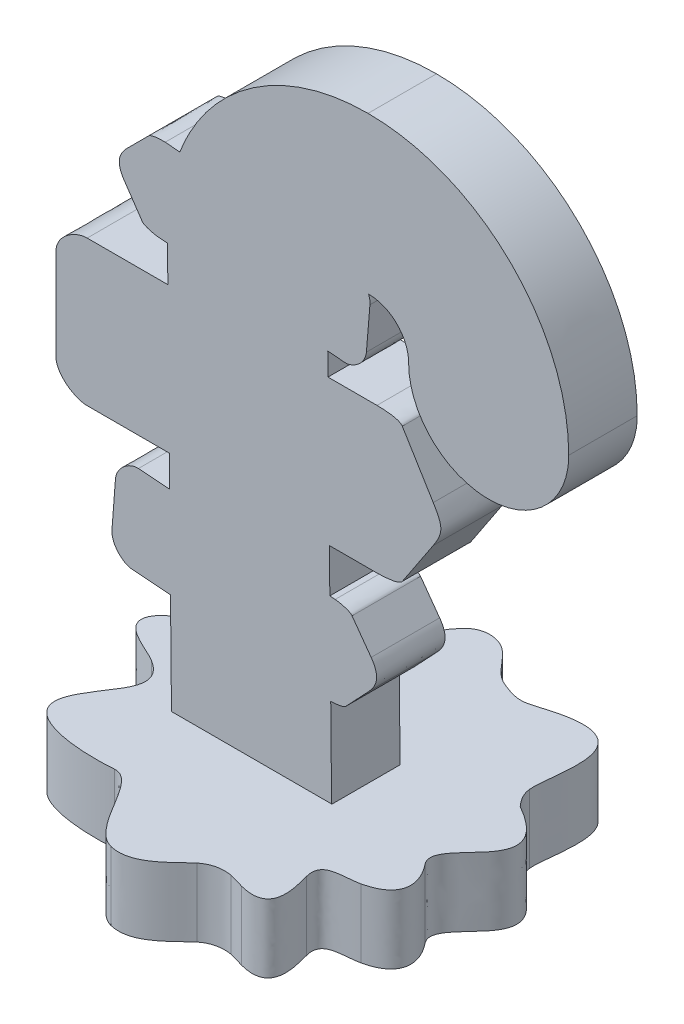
ISO-10303-21;
HEADER;
FILE_DESCRIPTION(('STEP AP214'),'2;1');
FILE_NAME('part.step','',(''),(''),'','','');
FILE_SCHEMA(('AUTOMOTIVE_DESIGN { 1 0 10303 214 1 1 1 1 }'));
ENDSEC;
DATA;
#1=APPLICATION_CONTEXT('core data for automotive mechanical design processes');
#2=APPLICATION_PROTOCOL_DEFINITION('international standard','automotive_design',2000,#1);
#3=PRODUCT_CONTEXT('',#1,'mechanical');
#4=PRODUCT('Part','Part','',(#3));
#5=PRODUCT_RELATED_PRODUCT_CATEGORY('part','',(#4));
#6=PRODUCT_DEFINITION_FORMATION('','',#4);
#7=PRODUCT_DEFINITION_CONTEXT('part definition',#1,'design');
#8=PRODUCT_DEFINITION('design','',#6,#7);
#9=PRODUCT_DEFINITION_SHAPE('','',#8);
#10=(LENGTH_UNIT() NAMED_UNIT(*) SI_UNIT(.MILLI.,.METRE.));
#11=(NAMED_UNIT(*) PLANE_ANGLE_UNIT() SI_UNIT($,.RADIAN.));
#12=(NAMED_UNIT(*) SI_UNIT($,.STERADIAN.) SOLID_ANGLE_UNIT());
#13=UNCERTAINTY_MEASURE_WITH_UNIT(LENGTH_MEASURE(1.E-05),#10,'distance_accuracy_value','');
#14=(GEOMETRIC_REPRESENTATION_CONTEXT(3) GLOBAL_UNCERTAINTY_ASSIGNED_CONTEXT((#13)) GLOBAL_UNIT_ASSIGNED_CONTEXT((#10,
#11,#12)) REPRESENTATION_CONTEXT('',''));
#15=CARTESIAN_POINT('',(0.,0.,0.));
#16=DIRECTION('',(0.,0.,1.));
#17=DIRECTION('',(1.,0.,0.));
#18=AXIS2_PLACEMENT_3D('',#15,#16,#17);
#19=CARTESIAN_POINT('',(424.981560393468,40.6841979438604,-390.4683));
#20=DIRECTION('',(-0.0824044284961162,-0.996598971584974,0.));
#21=DIRECTION('',(0.996598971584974,-0.0824044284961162,0.));
#22=AXIS2_PLACEMENT_3D('',#19,#20,#21);
#23=PLANE('',#22);
#24=CARTESIAN_POINT('',(424.981560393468,40.6841979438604,-395.4683));
#25=CARTESIAN_POINT('',(423.913660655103,40.772497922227,-395.4683));
#26=CARTESIAN_POINT('',(423.913660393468,40.7724979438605,-395.4683));
#27=B_SPLINE_CURVE_WITH_KNOTS('',2,(#24,#25,#26),.UNSPECIFIED.,.F.,.F.,(3,3),(0.959183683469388,
1.),.UNSPECIFIED.);
#28=CARTESIAN_POINT('',(424.981560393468,40.6841979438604,-395.4683));
#29=VERTEX_POINT('',#28);
#30=CARTESIAN_POINT('',(423.913660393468,40.7724979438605,-395.4683));
#31=VERTEX_POINT('',#30);
#32=EDGE_CURVE('E786',#29,#31,#27,.T.);
#33=ORIENTED_EDGE('',*,*,#32,.T.);
#34=DIRECTION('',(0.,0.,-1.));
#35=VECTOR('',#34,1.);
#36=CARTESIAN_POINT('',(423.913660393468,40.7724979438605,-390.4683));
#37=LINE('',#36,#35);
#38=CARTESIAN_POINT('',(423.913660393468,40.7724979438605,-390.4683));
#39=VERTEX_POINT('',#38);
#40=EDGE_CURVE('E12',#39,#31,#37,.T.);
#41=ORIENTED_EDGE('',*,*,#40,.F.);
#42=CARTESIAN_POINT('',(424.981560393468,40.6841979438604,-390.4683));
#43=CARTESIAN_POINT('',(423.913660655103,40.772497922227,-390.4683));
#44=CARTESIAN_POINT('',(423.913660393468,40.7724979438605,-390.4683));
#45=B_SPLINE_CURVE_WITH_KNOTS('',2,(#42,#43,#44),.UNSPECIFIED.,.F.,.F.,(3,3),(0.959183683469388,
1.),.UNSPECIFIED.);
#46=CARTESIAN_POINT('',(424.981560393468,40.6841979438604,-390.4683));
#47=VERTEX_POINT('',#46);
#48=EDGE_CURVE('E1092',#47,#39,#45,.T.);
#49=ORIENTED_EDGE('',*,*,#48,.F.);
#50=DIRECTION('',(0.,0.,-1.));
#51=VECTOR('',#50,1.);
#52=CARTESIAN_POINT('',(424.981560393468,40.6841979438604,-390.4683));
#53=LINE('',#52,#51);
#54=EDGE_CURVE('E378',#47,#29,#53,.T.);
#55=ORIENTED_EDGE('',*,*,#54,.T.);
#56=EDGE_LOOP('',(#33,#41,#49,#55));
#57=FACE_BOUND('',#56,.T.);
#58=ADVANCED_FACE('F46',(#57),#23,.F.);
#59=CARTESIAN_POINT('',(423.913660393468,40.7724979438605,-390.4683));
#60=CARTESIAN_POINT('',(423.671860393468,40.7924979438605,-390.4683));
#61=CARTESIAN_POINT('',(422.903360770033,40.7684979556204,-390.4683));
#62=CARTESIAN_POINT('',(422.698060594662,40.5627981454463,-390.4683));
#63=B_SPLINE_CURVE_WITH_KNOTS('',3,(#59,#60,#61,#62),.UNSPECIFIED.,.F.,.F.,(4,4),
(0.938775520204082,0.959183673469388),.UNSPECIFIED.);
#64=DIRECTION('',(0.,0.,-1.));
#65=VECTOR('',#64,1.);
#66=SURFACE_OF_LINEAR_EXTRUSION('',#63,#65);
#67=CARTESIAN_POINT('',(423.913660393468,40.7724979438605,-395.4683));
#68=CARTESIAN_POINT('',(423.671860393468,40.7924979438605,-395.4683));
#69=CARTESIAN_POINT('',(422.903360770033,40.7684979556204,-395.4683));
#70=CARTESIAN_POINT('',(422.698060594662,40.5627981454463,-395.4683));
#71=B_SPLINE_CURVE_WITH_KNOTS('',3,(#67,#68,#69,#70),.UNSPECIFIED.,.F.,.F.,(4,4),
(0.938775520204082,0.959183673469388),.UNSPECIFIED.);
#72=CARTESIAN_POINT('',(422.698060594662,40.5627981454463,-395.4683));
#73=VERTEX_POINT('',#72);
#74=EDGE_CURVE('E780',#31,#73,#71,.T.);
#75=ORIENTED_EDGE('',*,*,#74,.T.);
#76=DIRECTION('',(0.,0.,-1.));
#77=VECTOR('',#76,1.);
#78=CARTESIAN_POINT('',(422.698060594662,40.5627981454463,-390.4683));
#79=LINE('',#78,#77);
#80=CARTESIAN_POINT('',(422.698060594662,40.5627981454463,-390.4683));
#81=VERTEX_POINT('',#80);
#82=EDGE_CURVE('E54',#81,#73,#79,.T.);
#83=ORIENTED_EDGE('',*,*,#82,.F.);
#84=EDGE_CURVE('E225',#39,#81,#63,.T.);
#85=ORIENTED_EDGE('',*,*,#84,.F.);
#86=ORIENTED_EDGE('',*,*,#40,.T.);
#87=EDGE_LOOP('',(#75,#83,#85,#86));
#88=FACE_BOUND('',#87,.T.);
#89=ADVANCED_FACE('F1122',(#88),#66,.F.);
#90=CARTESIAN_POINT('',(422.698060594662,40.5627981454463,-390.4683));
#91=DIRECTION('',(0.707815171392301,-0.706397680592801,0.));
#92=DIRECTION('',(0.706397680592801,0.707815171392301,0.));
#93=AXIS2_PLACEMENT_3D('',#90,#91,#92);
#94=PLANE('',#93);
#95=CARTESIAN_POINT('',(422.698060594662,40.5627981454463,-395.4683));
#96=CARTESIAN_POINT('',(421.103361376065,38.9648989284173,-395.4683));
#97=CARTESIAN_POINT('',(421.103360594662,38.9648981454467,-395.4683));
#98=B_SPLINE_CURVE_WITH_KNOTS('',2,(#95,#96,#97),.UNSPECIFIED.,.F.,.F.,(3,3),(0.918367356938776,
0.938775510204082),.UNSPECIFIED.);
#99=CARTESIAN_POINT('',(421.103360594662,38.9648981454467,-395.4683));
#100=VERTEX_POINT('',#99);
#101=EDGE_CURVE('E774',#73,#100,#98,.T.);
#102=ORIENTED_EDGE('',*,*,#101,.T.);
#103=DIRECTION('',(0.,0.,-1.));
#104=VECTOR('',#103,1.);
#105=CARTESIAN_POINT('',(421.103360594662,38.9648981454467,-390.4683));
#106=LINE('',#105,#104);
#107=CARTESIAN_POINT('',(421.103360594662,38.9648981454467,-390.4683));
#108=VERTEX_POINT('',#107);
#109=EDGE_CURVE('E766',#108,#100,#106,.T.);
#110=ORIENTED_EDGE('',*,*,#109,.F.);
#111=CARTESIAN_POINT('',(422.698060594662,40.5627981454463,-390.4683));
#112=CARTESIAN_POINT('',(421.103361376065,38.9648989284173,-390.4683));
#113=CARTESIAN_POINT('',(421.103360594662,38.9648981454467,-390.4683));
#114=B_SPLINE_CURVE_WITH_KNOTS('',2,(#111,#112,#113),.UNSPECIFIED.,.F.,.F.,(3,3),
(0.918367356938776,0.938775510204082),.UNSPECIFIED.);
#115=EDGE_CURVE('E775',#81,#108,#114,.T.);
#116=ORIENTED_EDGE('',*,*,#115,.F.);
#117=ORIENTED_EDGE('',*,*,#82,.T.);
#118=EDGE_LOOP('',(#102,#110,#116,#117));
#119=FACE_BOUND('',#118,.T.);
#120=ADVANCED_FACE('F772',(#119),#94,.F.);
#121=CARTESIAN_POINT('',(421.103360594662,38.9648981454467,-390.4683));
#122=CARTESIAN_POINT('',(420.421060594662,38.2812981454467,-390.4683));
#123=CARTESIAN_POINT('',(420.403560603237,37.6186984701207,-390.4683));
#124=CARTESIAN_POINT('',(420.928360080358,36.8477989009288,-390.4683));
#125=B_SPLINE_CURVE_WITH_KNOTS('',3,(#121,#122,#123,#124),.UNSPECIFIED.,.F.,.F.,(4,4),
(0.897959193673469,0.918367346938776),.UNSPECIFIED.);
#126=DIRECTION('',(0.,0.,-1.));
#127=VECTOR('',#126,1.);
#128=SURFACE_OF_LINEAR_EXTRUSION('',#125,#127);
#129=CARTESIAN_POINT('',(421.103360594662,38.9648981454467,-395.4683));
#130=CARTESIAN_POINT('',(420.421060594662,38.2812981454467,-395.4683));
#131=CARTESIAN_POINT('',(420.403560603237,37.6186984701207,-395.4683));
#132=CARTESIAN_POINT('',(420.928360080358,36.8477989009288,-395.4683));
#133=B_SPLINE_CURVE_WITH_KNOTS('',3,(#129,#130,#131,#132),.UNSPECIFIED.,.F.,.F.,(4,4),
(0.897959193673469,0.918367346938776),.UNSPECIFIED.);
#134=CARTESIAN_POINT('',(420.928360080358,36.8477989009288,-395.4683));
#135=VERTEX_POINT('',#134);
#136=EDGE_CURVE('E782',#100,#135,#133,.T.);
#137=ORIENTED_EDGE('',*,*,#136,.T.);
#138=DIRECTION('',(0.,0.,-1.));
#139=VECTOR('',#138,1.);
#140=CARTESIAN_POINT('',(420.928360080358,36.8477989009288,-390.4683));
#141=LINE('',#140,#139);
#142=CARTESIAN_POINT('',(420.928360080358,36.8477989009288,-390.4683));
#143=VERTEX_POINT('',#142);
#144=EDGE_CURVE('E763',#143,#135,#141,.T.);
#145=ORIENTED_EDGE('',*,*,#144,.F.);
#146=EDGE_CURVE('E1133',#108,#143,#125,.T.);
#147=ORIENTED_EDGE('',*,*,#146,.F.);
#148=ORIENTED_EDGE('',*,*,#109,.T.);
#149=EDGE_LOOP('',(#137,#145,#147,#148));
#150=FACE_BOUND('',#149,.T.);
#151=ADVANCED_FACE('F1127',(#150),#128,.F.);
#152=CARTESIAN_POINT('',(420.928360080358,36.8477989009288,-390.4683));
#153=DIRECTION('',(0.826702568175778,0.562639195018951,0.));
#154=DIRECTION('',(-0.562639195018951,0.826702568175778,0.));
#155=AXIS2_PLACEMENT_3D('',#152,#153,#154);
#156=PLANE('',#155);
#157=CARTESIAN_POINT('',(420.928360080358,36.8477989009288,-395.4683));
#158=CARTESIAN_POINT('',(422.2325594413,34.9314998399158,-395.4683));
#159=CARTESIAN_POINT('',(422.232560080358,34.9314989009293,-395.4683));
#160=B_SPLINE_CURVE_WITH_KNOTS('',2,(#157,#158,#159),.UNSPECIFIED.,.F.,.F.,(3,3),
(0.877551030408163,0.897959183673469),.UNSPECIFIED.);
#161=CARTESIAN_POINT('',(422.232560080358,34.9314989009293,-395.4683));
#162=VERTEX_POINT('',#161);
#163=EDGE_CURVE('E784',#135,#162,#160,.T.);
#164=ORIENTED_EDGE('',*,*,#163,.T.);
#165=DIRECTION('',(0.,0.,-1.));
#166=VECTOR('',#165,1.);
#167=CARTESIAN_POINT('',(422.232560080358,34.9314989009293,-390.4683));
#168=LINE('',#167,#166);
#169=CARTESIAN_POINT('',(422.232560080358,34.9314989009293,-390.4683));
#170=VERTEX_POINT('',#169);
#171=EDGE_CURVE('E760',#170,#162,#168,.T.);
#172=ORIENTED_EDGE('',*,*,#171,.F.);
#173=CARTESIAN_POINT('',(420.928360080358,36.8477989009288,-390.4683));
#174=CARTESIAN_POINT('',(422.2325594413,34.9314998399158,-390.4683));
#175=CARTESIAN_POINT('',(422.232560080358,34.9314989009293,-390.4683));
#176=B_SPLINE_CURVE_WITH_KNOTS('',2,(#173,#174,#175),.UNSPECIFIED.,.F.,.F.,(3,3),
(0.877551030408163,0.897959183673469),.UNSPECIFIED.);
#177=EDGE_CURVE('E1138',#143,#170,#176,.T.);
#178=ORIENTED_EDGE('',*,*,#177,.F.);
#179=ORIENTED_EDGE('',*,*,#144,.T.);
#180=EDGE_LOOP('',(#164,#172,#178,#179));
#181=FACE_BOUND('',#180,.T.);
#182=ADVANCED_FACE('F1130',(#181),#156,.F.);
#183=CARTESIAN_POINT('',(422.232560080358,34.9314989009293,-390.4683));
#184=CARTESIAN_POINT('',(422.396860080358,34.6900989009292,-390.4683));
#185=CARTESIAN_POINT('',(423.156259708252,34.5449989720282,-390.4683));
#186=CARTESIAN_POINT('',(423.397259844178,34.5250989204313,-390.4683));
#187=B_SPLINE_CURVE_WITH_KNOTS('',3,(#183,#184,#185,#186),.UNSPECIFIED.,.F.,.F.,(4,4),
(0.857142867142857,0.877551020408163),.UNSPECIFIED.);
#188=DIRECTION('',(0.,0.,-1.));
#189=VECTOR('',#188,1.);
#190=SURFACE_OF_LINEAR_EXTRUSION('',#187,#189);
#191=CARTESIAN_POINT('',(422.232560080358,34.9314989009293,-395.4683));
#192=CARTESIAN_POINT('',(422.396860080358,34.6900989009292,-395.4683));
#193=CARTESIAN_POINT('',(423.156259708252,34.5449989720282,-395.4683));
#194=CARTESIAN_POINT('',(423.397259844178,34.5250989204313,-395.4683));
#195=B_SPLINE_CURVE_WITH_KNOTS('',3,(#191,#192,#193,#194),.UNSPECIFIED.,.F.,.F.,(4,4),
(0.857142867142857,0.877551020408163),.UNSPECIFIED.);
#196=CARTESIAN_POINT('',(423.397259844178,34.5250989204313,-395.4683));
#197=VERTEX_POINT('',#196);
#198=EDGE_CURVE('E804',#162,#197,#195,.T.);
#199=ORIENTED_EDGE('',*,*,#198,.T.);
#200=DIRECTION('',(0.,0.,-1.));
#201=VECTOR('',#200,1.);
#202=CARTESIAN_POINT('',(423.397259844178,34.5250989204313,-390.4683));
#203=LINE('',#202,#201);
#204=CARTESIAN_POINT('',(423.397259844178,34.5250989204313,-390.4683));
#205=VERTEX_POINT('',#204);
#206=EDGE_CURVE('E757',#205,#197,#203,.T.);
#207=ORIENTED_EDGE('',*,*,#206,.F.);
#208=EDGE_CURVE('E1145',#170,#205,#187,.T.);
#209=ORIENTED_EDGE('',*,*,#208,.F.);
#210=ORIENTED_EDGE('',*,*,#171,.T.);
#211=EDGE_LOOP('',(#199,#207,#209,#210));
#212=FACE_BOUND('',#211,.T.);
#213=ADVANCED_FACE('F1160',(#212),#190,.F.);
#214=CARTESIAN_POINT('',(423.397259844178,34.5250989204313,-390.4683));
#215=DIRECTION('',(0.0824416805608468,0.996595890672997,0.));
#216=DIRECTION('',(-0.996595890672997,0.0824416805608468,0.));
#217=AXIS2_PLACEMENT_3D('',#214,#215,#216);
#218=PLANE('',#217);
#219=CARTESIAN_POINT('',(423.397259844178,34.5250989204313,-395.4683));
#220=CARTESIAN_POINT('',(424.080259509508,34.4685989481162,-395.4683));
#221=CARTESIAN_POINT('',(424.080259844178,34.4685989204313,-395.4683));
#222=B_SPLINE_CURVE_WITH_KNOTS('',2,(#219,#220,#221),.UNSPECIFIED.,.F.,.F.,(3,3),
(0.836734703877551,0.857142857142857),.UNSPECIFIED.);
#223=CARTESIAN_POINT('',(424.080259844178,34.4685989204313,-395.4683));
#224=VERTEX_POINT('',#223);
#225=EDGE_CURVE('E811',#197,#224,#222,.T.);
#226=ORIENTED_EDGE('',*,*,#225,.T.);
#227=DIRECTION('',(0.,0.,-1.));
#228=VECTOR('',#227,1.);
#229=CARTESIAN_POINT('',(424.080259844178,34.4685989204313,-390.4683));
#230=LINE('',#229,#228);
#231=CARTESIAN_POINT('',(424.080259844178,34.4685989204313,-390.4683));
#232=VERTEX_POINT('',#231);
#233=EDGE_CURVE('E754',#232,#224,#230,.T.);
#234=ORIENTED_EDGE('',*,*,#233,.F.);
#235=CARTESIAN_POINT('',(423.397259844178,34.5250989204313,-390.4683));
#236=CARTESIAN_POINT('',(424.080259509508,34.4685989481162,-390.4683));
#237=CARTESIAN_POINT('',(424.080259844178,34.4685989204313,-390.4683));
#238=B_SPLINE_CURVE_WITH_KNOTS('',2,(#235,#236,#237),.UNSPECIFIED.,.F.,.F.,(3,3),
(0.836734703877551,0.857142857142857),.UNSPECIFIED.);
#239=EDGE_CURVE('E1153',#205,#232,#238,.T.);
#240=ORIENTED_EDGE('',*,*,#239,.F.);
#241=ORIENTED_EDGE('',*,*,#206,.T.);
#242=EDGE_LOOP('',(#226,#234,#240,#241));
#243=FACE_BOUND('',#242,.T.);
#244=ADVANCED_FACE('F1163',(#243),#218,.F.);
#245=CARTESIAN_POINT('',(424.080259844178,34.4685989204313,-390.4683));
#246=DIRECTION('',(0.999951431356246,0.00985570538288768,0.));
#247=DIRECTION('',(-0.00985570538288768,0.999951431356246,0.));
#248=AXIS2_PLACEMENT_3D('',#245,#246,#247);
#249=PLANE('',#248);
#250=CARTESIAN_POINT('',(424.080259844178,34.4685989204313,-395.4683));
#251=CARTESIAN_POINT('',(424.105959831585,31.8611001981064,-395.4683));
#252=CARTESIAN_POINT('',(424.105959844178,31.861098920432,-395.4683));
#253=B_SPLINE_CURVE_WITH_KNOTS('',2,(#250,#251,#252),.UNSPECIFIED.,.F.,.F.,(3,3),
(0.816326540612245,0.836734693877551),.UNSPECIFIED.);
#254=CARTESIAN_POINT('',(424.105959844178,31.861098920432,-395.4683));
#255=VERTEX_POINT('',#254);
#256=EDGE_CURVE('E818',#224,#255,#253,.T.);
#257=ORIENTED_EDGE('',*,*,#256,.T.);
#258=DIRECTION('',(0.,0.,-1.));
#259=VECTOR('',#258,1.);
#260=CARTESIAN_POINT('',(424.105959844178,31.861098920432,-390.4683));
#261=LINE('',#260,#259);
#262=CARTESIAN_POINT('',(424.105959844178,31.861098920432,-390.4683));
#263=VERTEX_POINT('',#262);
#264=EDGE_CURVE('E751',#263,#255,#261,.T.);
#265=ORIENTED_EDGE('',*,*,#264,.F.);
#266=CARTESIAN_POINT('',(424.080259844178,34.4685989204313,-390.4683));
#267=CARTESIAN_POINT('',(424.105959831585,31.8611001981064,-390.4683));
#268=CARTESIAN_POINT('',(424.105959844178,31.861098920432,-390.4683));
#269=B_SPLINE_CURVE_WITH_KNOTS('',2,(#266,#267,#268),.UNSPECIFIED.,.F.,.F.,(3,3),
(0.816326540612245,0.836734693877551),.UNSPECIFIED.);
#270=EDGE_CURVE('E1737',#232,#263,#269,.T.);
#271=ORIENTED_EDGE('',*,*,#270,.F.);
#272=ORIENTED_EDGE('',*,*,#233,.T.);
#273=EDGE_LOOP('',(#257,#265,#271,#272));
#274=FACE_BOUND('',#273,.T.);
#275=ADVANCED_FACE('F1167',(#274),#249,.F.);
#276=CARTESIAN_POINT('',(424.105959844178,31.861098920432,-390.4683));
#277=DIRECTION('',(0.,-1.,0.));
#278=DIRECTION('',(0.,0.,-1.));
#279=AXIS2_PLACEMENT_3D('',#276,#277,#278);
#280=PLANE('',#279);
#281=CARTESIAN_POINT('',(424.105959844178,31.861098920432,-395.4683));
#282=CARTESIAN_POINT('',(418.216562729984,31.861098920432,-395.4683));
#283=CARTESIAN_POINT('',(418.216559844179,31.861098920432,-395.4683));
#284=B_SPLINE_CURVE_WITH_KNOTS('',2,(#281,#282,#283),.UNSPECIFIED.,.F.,.F.,(3,3),
(0.795918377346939,0.816326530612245),.UNSPECIFIED.);
#285=CARTESIAN_POINT('',(418.216559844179,31.861098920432,-395.4683));
#286=VERTEX_POINT('',#285);
#287=EDGE_CURVE('E825',#255,#286,#284,.T.);
#288=ORIENTED_EDGE('',*,*,#287,.T.);
#289=DIRECTION('',(0.,0.,-1.));
#290=VECTOR('',#289,1.);
#291=CARTESIAN_POINT('',(418.216559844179,31.861098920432,-390.4683));
#292=LINE('',#291,#290);
#293=CARTESIAN_POINT('',(418.216559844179,31.861098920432,-390.4683));
#294=VERTEX_POINT('',#293);
#295=EDGE_CURVE('E748',#294,#286,#292,.T.);
#296=ORIENTED_EDGE('',*,*,#295,.F.);
#297=CARTESIAN_POINT('',(424.105959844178,31.861098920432,-390.4683));
#298=CARTESIAN_POINT('',(418.216562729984,31.861098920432,-390.4683));
#299=CARTESIAN_POINT('',(418.216559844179,31.861098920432,-390.4683));
#300=B_SPLINE_CURVE_WITH_KNOTS('',2,(#297,#298,#299),.UNSPECIFIED.,.F.,.F.,(3,3),
(0.795918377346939,0.816326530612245),.UNSPECIFIED.);
#301=EDGE_CURVE('E1190',#263,#294,#300,.T.);
#302=ORIENTED_EDGE('',*,*,#301,.F.);
#303=ORIENTED_EDGE('',*,*,#264,.T.);
#304=EDGE_LOOP('',(#288,#296,#302,#303));
#305=FACE_BOUND('',#304,.T.);
#306=ADVANCED_FACE('F1171',(#305),#280,.F.);
#307=CARTESIAN_POINT('',(418.216559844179,31.861098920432,-390.4683));
#308=CARTESIAN_POINT('',(417.292259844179,31.861098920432,-390.4683));
#309=CARTESIAN_POINT('',(415.930960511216,30.962699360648,-390.4683));
#310=CARTESIAN_POINT('',(415.930959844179,29.8610999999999,-390.4683));
#311=B_SPLINE_CURVE_WITH_KNOTS('',3,(#307,#308,#309,#310),.UNSPECIFIED.,.F.,.F.,(4,4),
(0.775510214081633,0.795918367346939),.UNSPECIFIED.);
#312=DIRECTION('',(0.,0.,-1.));
#313=VECTOR('',#312,1.);
#314=SURFACE_OF_LINEAR_EXTRUSION('',#311,#313);
#315=CARTESIAN_POINT('',(418.216559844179,31.861098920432,-395.4683));
#316=CARTESIAN_POINT('',(417.292259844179,31.861098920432,-395.4683));
#317=CARTESIAN_POINT('',(415.930960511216,30.962699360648,-395.4683));
#318=CARTESIAN_POINT('',(415.930959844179,29.8610999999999,-395.4683));
#319=B_SPLINE_CURVE_WITH_KNOTS('',3,(#315,#316,#317,#318),.UNSPECIFIED.,.F.,.F.,(4,4),
(0.775510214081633,0.795918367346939),.UNSPECIFIED.);
#320=CARTESIAN_POINT('',(415.930959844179,29.8610999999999,-395.4683));
#321=VERTEX_POINT('',#320);
#322=EDGE_CURVE('E832',#286,#321,#319,.T.);
#323=ORIENTED_EDGE('',*,*,#322,.T.);
#324=DIRECTION('',(0.,0.,-1.));
#325=VECTOR('',#324,1.);
#326=CARTESIAN_POINT('',(415.930959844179,29.8610999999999,-390.4683));
#327=LINE('',#326,#325);
#328=CARTESIAN_POINT('',(415.930959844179,29.8610999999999,-390.4683));
#329=VERTEX_POINT('',#328);
#330=EDGE_CURVE('E745',#329,#321,#327,.T.);
#331=ORIENTED_EDGE('',*,*,#330,.F.);
#332=EDGE_CURVE('E1183',#294,#329,#311,.T.);
#333=ORIENTED_EDGE('',*,*,#332,.F.);
#334=ORIENTED_EDGE('',*,*,#295,.T.);
#335=EDGE_LOOP('',(#323,#331,#333,#334));
#336=FACE_BOUND('',#335,.T.);
#337=ADVANCED_FACE('F1175',(#336),#314,.F.);
#338=CARTESIAN_POINT('',(415.930959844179,29.8610999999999,-390.4683));
#339=DIRECTION('',(1.,0.,0.));
#340=DIRECTION('',(0.,0.,-1.));
#341=AXIS2_PLACEMENT_3D('',#338,#339,#340);
#342=PLANE('',#341);
#343=CARTESIAN_POINT('',(415.930959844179,29.8610999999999,-395.4683));
#344=CARTESIAN_POINT('',(415.930959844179,23.261103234,-395.4683));
#345=CARTESIAN_POINT('',(415.930959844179,23.2611000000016,-395.4683));
#346=B_SPLINE_CURVE_WITH_KNOTS('',2,(#343,#344,#345),.UNSPECIFIED.,.F.,.F.,(3,3),
(0.755102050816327,0.775510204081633),.UNSPECIFIED.);
#347=CARTESIAN_POINT('',(415.930959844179,23.2611000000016,-395.4683));
#348=VERTEX_POINT('',#347);
#349=EDGE_CURVE('E839',#321,#348,#346,.T.);
#350=ORIENTED_EDGE('',*,*,#349,.T.);
#351=DIRECTION('',(0.,0.,-1.));
#352=VECTOR('',#351,1.);
#353=CARTESIAN_POINT('',(415.930959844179,23.2611000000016,-390.4683));
#354=LINE('',#353,#352);
#355=CARTESIAN_POINT('',(415.930959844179,23.2611000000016,-390.4683));
#356=VERTEX_POINT('',#355);
#357=EDGE_CURVE('E742',#356,#348,#354,.T.);
#358=ORIENTED_EDGE('',*,*,#357,.F.);
#359=CARTESIAN_POINT('',(415.930959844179,29.8610999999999,-390.4683));
#360=CARTESIAN_POINT('',(415.930959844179,23.261103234,-390.4683));
#361=CARTESIAN_POINT('',(415.930959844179,23.2611000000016,-390.4683));
#362=B_SPLINE_CURVE_WITH_KNOTS('',2,(#359,#360,#361),.UNSPECIFIED.,.F.,.F.,(3,3),
(0.755102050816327,0.775510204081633),.UNSPECIFIED.);
#363=EDGE_CURVE('E1189',#329,#356,#362,.T.);
#364=ORIENTED_EDGE('',*,*,#363,.F.);
#365=ORIENTED_EDGE('',*,*,#330,.T.);
#366=EDGE_LOOP('',(#350,#358,#364,#365));
#367=FACE_BOUND('',#366,.T.);
#368=ADVANCED_FACE('F1180',(#367),#342,.F.);
#369=CARTESIAN_POINT('',(415.930959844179,23.2611000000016,-390.4683));
#370=CARTESIAN_POINT('',(415.930959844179,22.1595000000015,-390.4683));
#371=CARTESIAN_POINT('',(417.293459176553,21.261100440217,-390.4683));
#372=CARTESIAN_POINT('',(418.21655893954,21.2611000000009,-390.4683));
#373=B_SPLINE_CURVE_WITH_KNOTS('',3,(#369,#370,#371,#372),.UNSPECIFIED.,.F.,.F.,(4,4),
(0.73469388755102,0.755102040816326),.UNSPECIFIED.);
#374=DIRECTION('',(0.,0.,-1.));
#375=VECTOR('',#374,1.);
#376=SURFACE_OF_LINEAR_EXTRUSION('',#373,#375);
#377=CARTESIAN_POINT('',(415.930959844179,23.2611000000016,-395.4683));
#378=CARTESIAN_POINT('',(415.930959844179,22.1595000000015,-395.4683));
#379=CARTESIAN_POINT('',(417.293459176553,21.261100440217,-395.4683));
#380=CARTESIAN_POINT('',(418.21655893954,21.2611000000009,-395.4683));
#381=B_SPLINE_CURVE_WITH_KNOTS('',3,(#377,#378,#379,#380),.UNSPECIFIED.,.F.,.F.,(4,4),
(0.73469388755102,0.755102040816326),.UNSPECIFIED.);
#382=CARTESIAN_POINT('',(418.21655893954,21.2611000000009,-395.4683));
#383=VERTEX_POINT('',#382);
#384=EDGE_CURVE('E846',#348,#383,#381,.T.);
#385=ORIENTED_EDGE('',*,*,#384,.T.);
#386=DIRECTION('',(0.,0.,-1.));
#387=VECTOR('',#386,1.);
#388=CARTESIAN_POINT('',(418.21655893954,21.2611000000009,-390.4683));
#389=LINE('',#388,#387);
#390=CARTESIAN_POINT('',(418.21655893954,21.2611000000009,-390.4683));
#391=VERTEX_POINT('',#390);
#392=EDGE_CURVE('E739',#391,#383,#389,.T.);
#393=ORIENTED_EDGE('',*,*,#392,.F.);
#394=EDGE_CURVE('E1199',#356,#391,#373,.T.);
#395=ORIENTED_EDGE('',*,*,#394,.F.);
#396=ORIENTED_EDGE('',*,*,#357,.T.);
#397=EDGE_LOOP('',(#385,#393,#395,#396));
#398=FACE_BOUND('',#397,.T.);
#399=ADVANCED_FACE('F1214',(#398),#376,.F.);
#400=CARTESIAN_POINT('',(418.21655893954,21.2611000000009,-390.4683));
#401=DIRECTION('',(0.,1.,0.));
#402=DIRECTION('',(0.,0.,1.));
#403=AXIS2_PLACEMENT_3D('',#400,#401,#402);
#404=PLANE('',#403);
#405=CARTESIAN_POINT('',(418.21655893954,21.2611000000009,-395.4683));
#406=CARTESIAN_POINT('',(424.210456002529,21.2611000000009,-395.4683));
#407=CARTESIAN_POINT('',(424.210458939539,21.2611000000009,-395.4683));
#408=B_SPLINE_CURVE_WITH_KNOTS('',2,(#405,#406,#407),.UNSPECIFIED.,.F.,.F.,(3,3),
(0.714285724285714,0.73469387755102),.UNSPECIFIED.);
#409=CARTESIAN_POINT('',(424.210458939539,21.2611000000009,-395.4683));
#410=VERTEX_POINT('',#409);
#411=EDGE_CURVE('E853',#383,#410,#408,.T.);
#412=ORIENTED_EDGE('',*,*,#411,.T.);
#413=DIRECTION('',(0.,0.,-1.));
#414=VECTOR('',#413,1.);
#415=CARTESIAN_POINT('',(424.210458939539,21.2611000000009,-390.4683));
#416=LINE('',#415,#414);
#417=CARTESIAN_POINT('',(424.210458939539,21.2611000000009,-390.4683));
#418=VERTEX_POINT('',#417);
#419=EDGE_CURVE('E736',#418,#410,#416,.T.);
#420=ORIENTED_EDGE('',*,*,#419,.F.);
#421=CARTESIAN_POINT('',(418.21655893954,21.2611000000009,-390.4683));
#422=CARTESIAN_POINT('',(424.210456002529,21.2611000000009,-390.4683));
#423=CARTESIAN_POINT('',(424.210458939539,21.2611000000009,-390.4683));
#424=B_SPLINE_CURVE_WITH_KNOTS('',2,(#421,#422,#423),.UNSPECIFIED.,.F.,.F.,(3,3),
(0.714285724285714,0.73469387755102),.UNSPECIFIED.);
#425=EDGE_CURVE('E1207',#391,#418,#424,.T.);
#426=ORIENTED_EDGE('',*,*,#425,.F.);
#427=ORIENTED_EDGE('',*,*,#392,.T.);
#428=EDGE_LOOP('',(#412,#420,#426,#427));
#429=FACE_BOUND('',#428,.T.);
#430=ADVANCED_FACE('F1217',(#429),#404,.F.);
#431=CARTESIAN_POINT('',(424.210458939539,21.2611000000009,-390.4683));
#432=DIRECTION('',(0.999951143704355,0.00988484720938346,0.));
#433=DIRECTION('',(-0.00988484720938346,0.999951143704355,0.));
#434=AXIS2_PLACEMENT_3D('',#431,#432,#433);
#435=PLANE('',#434);
#436=CARTESIAN_POINT('',(424.210458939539,21.2611000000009,-395.4683));
#437=CARTESIAN_POINT('',(424.232958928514,18.9850011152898,-395.4683));
#438=CARTESIAN_POINT('',(424.232958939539,18.9850000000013,-395.4683));
#439=B_SPLINE_CURVE_WITH_KNOTS('',2,(#436,#437,#438),.UNSPECIFIED.,.F.,.F.,(3,3),
(0.693877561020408,0.714285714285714),.UNSPECIFIED.);
#440=CARTESIAN_POINT('',(424.232958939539,18.9850000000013,-395.4683));
#441=VERTEX_POINT('',#440);
#442=EDGE_CURVE('E860',#410,#441,#439,.T.);
#443=ORIENTED_EDGE('',*,*,#442,.T.);
#444=DIRECTION('',(0.,0.,-1.));
#445=VECTOR('',#444,1.);
#446=CARTESIAN_POINT('',(424.232958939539,18.9850000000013,-390.4683));
#447=LINE('',#446,#445);
#448=CARTESIAN_POINT('',(424.232958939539,18.9850000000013,-390.4683));
#449=VERTEX_POINT('',#448);
#450=EDGE_CURVE('E733',#449,#441,#447,.T.);
#451=ORIENTED_EDGE('',*,*,#450,.F.);
#452=CARTESIAN_POINT('',(424.210458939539,21.2611000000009,-390.4683));
#453=CARTESIAN_POINT('',(424.232958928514,18.9850011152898,-390.4683));
#454=CARTESIAN_POINT('',(424.232958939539,18.9850000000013,-390.4683));
#455=B_SPLINE_CURVE_WITH_KNOTS('',2,(#452,#453,#454),.UNSPECIFIED.,.F.,.F.,(3,3),
(0.693877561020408,0.714285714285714),.UNSPECIFIED.);
#456=EDGE_CURVE('E1718',#418,#449,#455,.T.);
#457=ORIENTED_EDGE('',*,*,#456,.F.);
#458=ORIENTED_EDGE('',*,*,#419,.T.);
#459=EDGE_LOOP('',(#443,#451,#457,#458));
#460=FACE_BOUND('',#459,.T.);
#461=ADVANCED_FACE('F1221',(#460),#435,.F.);
#462=CARTESIAN_POINT('',(424.232958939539,18.9850000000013,-390.4683));
#463=DIRECTION('',(-0.0759532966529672,-0.997111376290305,0.));
#464=DIRECTION('',(0.997111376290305,-0.0759532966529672,0.));
#465=AXIS2_PLACEMENT_3D('',#462,#463,#464);
#466=PLANE('',#465);
#467=CARTESIAN_POINT('',(424.232958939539,18.9850000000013,-395.4683));
#468=CARTESIAN_POINT('',(421.955260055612,19.1584999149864,-395.4683));
#469=CARTESIAN_POINT('',(421.955258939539,19.1585000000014,-395.4683));
#470=B_SPLINE_CURVE_WITH_KNOTS('',2,(#467,#468,#469),.UNSPECIFIED.,.F.,.F.,(3,3),
(0.673469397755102,0.693877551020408),.UNSPECIFIED.);
#471=CARTESIAN_POINT('',(421.955258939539,19.1585000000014,-395.4683));
#472=VERTEX_POINT('',#471);
#473=EDGE_CURVE('E867',#441,#472,#470,.T.);
#474=ORIENTED_EDGE('',*,*,#473,.T.);
#475=DIRECTION('',(0.,0.,-1.));
#476=VECTOR('',#475,1.);
#477=CARTESIAN_POINT('',(421.955258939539,19.1585000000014,-390.4683));
#478=LINE('',#477,#476);
#479=CARTESIAN_POINT('',(421.955258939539,19.1585000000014,-390.4683));
#480=VERTEX_POINT('',#479);
#481=EDGE_CURVE('E730',#480,#472,#478,.T.);
#482=ORIENTED_EDGE('',*,*,#481,.F.);
#483=CARTESIAN_POINT('',(424.232958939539,18.9850000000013,-390.4683));
#484=CARTESIAN_POINT('',(421.955260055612,19.1584999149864,-390.4683));
#485=CARTESIAN_POINT('',(421.955258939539,19.1585000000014,-390.4683));
#486=B_SPLINE_CURVE_WITH_KNOTS('',2,(#483,#484,#485),.UNSPECIFIED.,.F.,.F.,(3,3),
(0.673469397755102,0.693877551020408),.UNSPECIFIED.);
#487=EDGE_CURVE('E1244',#449,#480,#486,.T.);
#488=ORIENTED_EDGE('',*,*,#487,.F.);
#489=ORIENTED_EDGE('',*,*,#450,.T.);
#490=EDGE_LOOP('',(#474,#482,#488,#489));
#491=FACE_BOUND('',#490,.T.);
#492=ADVANCED_FACE('F1225',(#491),#466,.F.);
#493=CARTESIAN_POINT('',(421.955258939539,19.1585000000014,-390.4683));
#494=CARTESIAN_POINT('',(421.327658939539,19.2064000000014,-390.4683));
#495=CARTESIAN_POINT('',(420.34675942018,18.5359003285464,-390.4683));
#496=CARTESIAN_POINT('',(420.277559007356,17.6275008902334,-390.4683));
#497=B_SPLINE_CURVE_WITH_KNOTS('',3,(#493,#494,#495,#496),.UNSPECIFIED.,.F.,.F.,(4,4),
(0.653061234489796,0.673469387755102),.UNSPECIFIED.);
#498=DIRECTION('',(0.,0.,-1.));
#499=VECTOR('',#498,1.);
#500=SURFACE_OF_LINEAR_EXTRUSION('',#497,#499);
#501=CARTESIAN_POINT('',(421.955258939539,19.1585000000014,-395.4683));
#502=CARTESIAN_POINT('',(421.327658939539,19.2064000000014,-395.4683));
#503=CARTESIAN_POINT('',(420.34675942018,18.5359003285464,-395.4683));
#504=CARTESIAN_POINT('',(420.277559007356,17.6275008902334,-395.4683));
#505=B_SPLINE_CURVE_WITH_KNOTS('',3,(#501,#502,#503,#504),.UNSPECIFIED.,.F.,.F.,(4,4),
(0.653061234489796,0.673469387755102),.UNSPECIFIED.);
#506=CARTESIAN_POINT('',(420.277559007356,17.6275008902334,-395.4683));
#507=VERTEX_POINT('',#506);
#508=EDGE_CURVE('E874',#472,#507,#505,.T.);
#509=ORIENTED_EDGE('',*,*,#508,.T.);
#510=DIRECTION('',(0.,0.,-1.));
#511=VECTOR('',#510,1.);
#512=CARTESIAN_POINT('',(420.277559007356,17.6275008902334,-390.4683));
#513=LINE('',#512,#511);
#514=CARTESIAN_POINT('',(420.277559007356,17.6275008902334,-390.4683));
#515=VERTEX_POINT('',#514);
#516=EDGE_CURVE('E727',#515,#507,#513,.T.);
#517=ORIENTED_EDGE('',*,*,#516,.F.);
#518=EDGE_CURVE('E1237',#480,#515,#497,.T.);
#519=ORIENTED_EDGE('',*,*,#518,.F.);
#520=ORIENTED_EDGE('',*,*,#481,.T.);
#521=EDGE_LOOP('',(#509,#517,#519,#520));
#522=FACE_BOUND('',#521,.T.);
#523=ADVANCED_FACE('F1229',(#522),#500,.F.);
#524=CARTESIAN_POINT('',(420.277559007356,17.6275008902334,-390.4683));
#525=DIRECTION('',(0.997112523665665,-0.075938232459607,0.));
#526=DIRECTION('',(0.075938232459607,0.997112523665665,0.));
#527=AXIS2_PLACEMENT_3D('',#524,#525,#526);
#528=PLANE('',#527);
#529=CARTESIAN_POINT('',(420.277559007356,17.6275008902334,-395.4683));
#530=CARTESIAN_POINT('',(420.026359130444,14.3291025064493,-395.4683));
#531=CARTESIAN_POINT('',(420.026359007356,14.3291008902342,-395.4683));
#532=B_SPLINE_CURVE_WITH_KNOTS('',2,(#529,#530,#531),.UNSPECIFIED.,.F.,.F.,(3,3),
(0.63265307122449,0.653061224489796),.UNSPECIFIED.);
#533=CARTESIAN_POINT('',(420.026359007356,14.3291008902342,-395.4683));
#534=VERTEX_POINT('',#533);
#535=EDGE_CURVE('E881',#507,#534,#532,.T.);
#536=ORIENTED_EDGE('',*,*,#535,.T.);
#537=DIRECTION('',(0.,0.,-1.));
#538=VECTOR('',#537,1.);
#539=CARTESIAN_POINT('',(420.026359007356,14.3291008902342,-390.4683));
#540=LINE('',#539,#538);
#541=CARTESIAN_POINT('',(420.026359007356,14.3291008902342,-390.4683));
#542=VERTEX_POINT('',#541);
#543=EDGE_CURVE('E724',#542,#534,#540,.T.);
#544=ORIENTED_EDGE('',*,*,#543,.F.);
#545=CARTESIAN_POINT('',(420.277559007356,17.6275008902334,-390.4683));
#546=CARTESIAN_POINT('',(420.026359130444,14.3291025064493,-390.4683));
#547=CARTESIAN_POINT('',(420.026359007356,14.3291008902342,-390.4683));
#548=B_SPLINE_CURVE_WITH_KNOTS('',2,(#545,#546,#547),.UNSPECIFIED.,.F.,.F.,(3,3),
(0.63265307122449,0.653061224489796),.UNSPECIFIED.);
#549=EDGE_CURVE('E1243',#515,#542,#548,.T.);
#550=ORIENTED_EDGE('',*,*,#549,.F.);
#551=ORIENTED_EDGE('',*,*,#516,.T.);
#552=EDGE_LOOP('',(#536,#544,#550,#551));
#553=FACE_BOUND('',#552,.T.);
#554=ADVANCED_FACE('F1234',(#553),#528,.F.);
#555=CARTESIAN_POINT('',(420.026359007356,14.3291008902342,-390.4683));
#556=CARTESIAN_POINT('',(419.957159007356,13.4207008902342,-390.4683));
#557=CARTESIAN_POINT('',(420.825758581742,12.6094012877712,-390.4683));
#558=CARTESIAN_POINT('',(421.452758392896,12.5617009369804,-390.4683));
#559=B_SPLINE_CURVE_WITH_KNOTS('',3,(#555,#556,#557,#558),.UNSPECIFIED.,.F.,.F.,(4,4),
(0.612244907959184,0.63265306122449),.UNSPECIFIED.);
#560=DIRECTION('',(0.,0.,-1.));
#561=VECTOR('',#560,1.);
#562=SURFACE_OF_LINEAR_EXTRUSION('',#559,#561);
#563=CARTESIAN_POINT('',(420.026359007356,14.3291008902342,-395.4683));
#564=CARTESIAN_POINT('',(419.957159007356,13.4207008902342,-395.4683));
#565=CARTESIAN_POINT('',(420.825758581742,12.6094012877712,-395.4683));
#566=CARTESIAN_POINT('',(421.452758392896,12.5617009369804,-395.4683));
#567=B_SPLINE_CURVE_WITH_KNOTS('',3,(#563,#564,#565,#566),.UNSPECIFIED.,.F.,.F.,(4,4),
(0.612244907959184,0.63265306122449),.UNSPECIFIED.);
#568=CARTESIAN_POINT('',(421.452758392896,12.5617009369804,-395.4683));
#569=VERTEX_POINT('',#568);
#570=EDGE_CURVE('E888',#534,#569,#567,.T.);
#571=ORIENTED_EDGE('',*,*,#570,.T.);
#572=DIRECTION('',(0.,0.,-1.));
#573=VECTOR('',#572,1.);
#574=CARTESIAN_POINT('',(421.452758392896,12.5617009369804,-390.4683));
#575=LINE('',#574,#573);
#576=CARTESIAN_POINT('',(421.452758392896,12.5617009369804,-390.4683));
#577=VERTEX_POINT('',#576);
#578=EDGE_CURVE('E721',#577,#569,#575,.T.);
#579=ORIENTED_EDGE('',*,*,#578,.F.);
#580=EDGE_CURVE('E1253',#542,#577,#559,.T.);
#581=ORIENTED_EDGE('',*,*,#580,.F.);
#582=ORIENTED_EDGE('',*,*,#543,.T.);
#583=EDGE_LOOP('',(#571,#579,#581,#582));
#584=FACE_BOUND('',#583,.T.);
#585=ADVANCED_FACE('F1268',(#584),#562,.F.);
#586=CARTESIAN_POINT('',(421.452758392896,12.5617009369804,-390.4683));
#587=DIRECTION('',(0.0759649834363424,0.99711048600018,0.));
#588=DIRECTION('',(-0.997110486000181,0.0759649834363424,0.));
#589=AXIS2_PLACEMENT_3D('',#586,#587,#588);
#590=PLANE('',#589);
#591=CARTESIAN_POINT('',(421.452758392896,12.5617009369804,-395.4683));
#592=CARTESIAN_POINT('',(424.298456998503,12.3449010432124,-395.4683));
#593=CARTESIAN_POINT('',(424.298458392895,12.3449009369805,-395.4683));
#594=B_SPLINE_CURVE_WITH_KNOTS('',2,(#591,#592,#593),.UNSPECIFIED.,.F.,.F.,(3,3),
(0.591836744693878,0.612244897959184),.UNSPECIFIED.);
#595=CARTESIAN_POINT('',(424.298458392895,12.3449009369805,-395.4683));
#596=VERTEX_POINT('',#595);
#597=EDGE_CURVE('E895',#569,#596,#594,.T.);
#598=ORIENTED_EDGE('',*,*,#597,.T.);
#599=DIRECTION('',(0.,0.,-1.));
#600=VECTOR('',#599,1.);
#601=CARTESIAN_POINT('',(424.298458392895,12.3449009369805,-390.4683));
#602=LINE('',#601,#600);
#603=CARTESIAN_POINT('',(424.298458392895,12.3449009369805,-390.4683));
#604=VERTEX_POINT('',#603);
#605=EDGE_CURVE('E718',#604,#596,#602,.T.);
#606=ORIENTED_EDGE('',*,*,#605,.F.);
#607=CARTESIAN_POINT('',(421.452758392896,12.5617009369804,-390.4683));
#608=CARTESIAN_POINT('',(424.298456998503,12.3449010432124,-390.4683));
#609=CARTESIAN_POINT('',(424.298458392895,12.3449009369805,-390.4683));
#610=B_SPLINE_CURVE_WITH_KNOTS('',2,(#607,#608,#609),.UNSPECIFIED.,.F.,.F.,(3,3),
(0.591836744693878,0.612244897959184),.UNSPECIFIED.);
#611=EDGE_CURVE('E1261',#577,#604,#610,.T.);
#612=ORIENTED_EDGE('',*,*,#611,.F.);
#613=ORIENTED_EDGE('',*,*,#578,.T.);
#614=EDGE_LOOP('',(#598,#606,#612,#613));
#615=FACE_BOUND('',#614,.T.);
#616=ADVANCED_FACE('F1271',(#615),#590,.F.);
#617=CARTESIAN_POINT('',(424.298458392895,12.3449009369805,-390.4683));
#618=DIRECTION('',(0.999951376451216,0.00986127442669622,0.));
#619=DIRECTION('',(-0.00986127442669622,0.999951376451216,0.));
#620=AXIS2_PLACEMENT_3D('',#617,#618,#619);
#621=PLANE('',#620);
#622=CARTESIAN_POINT('',(424.298458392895,12.3449009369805,-395.4683));
#623=CARTESIAN_POINT('',(424.396258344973,2.42780579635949,-395.4683));
#624=CARTESIAN_POINT('',(424.396258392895,2.42780093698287,-395.4683));
#625=B_SPLINE_CURVE_WITH_KNOTS('',2,(#622,#623,#624),.UNSPECIFIED.,.F.,.F.,(3,3),
(0.571428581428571,0.591836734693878),.UNSPECIFIED.);
#626=CARTESIAN_POINT('',(424.396258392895,2.42780093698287,-395.4683));
#627=VERTEX_POINT('',#626);
#628=EDGE_CURVE('E902',#596,#627,#625,.T.);
#629=ORIENTED_EDGE('',*,*,#628,.T.);
#630=DIRECTION('',(0.,0.,-1.));
#631=VECTOR('',#630,1.);
#632=CARTESIAN_POINT('',(424.396258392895,2.42780093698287,-390.4683));
#633=LINE('',#632,#631);
#634=CARTESIAN_POINT('',(424.396258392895,2.42780093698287,-390.4683));
#635=VERTEX_POINT('',#634);
#636=EDGE_CURVE('E715',#635,#627,#633,.T.);
#637=ORIENTED_EDGE('',*,*,#636,.F.);
#638=CARTESIAN_POINT('',(424.298458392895,12.3449009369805,-390.4683));
#639=CARTESIAN_POINT('',(424.396258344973,2.42780579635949,-390.4683));
#640=CARTESIAN_POINT('',(424.396258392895,2.42780093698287,-390.4683));
#641=B_SPLINE_CURVE_WITH_KNOTS('',2,(#638,#639,#640),.UNSPECIFIED.,.F.,.F.,(3,3),
(0.571428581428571,0.591836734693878),.UNSPECIFIED.);
#642=EDGE_CURVE('E1293',#604,#635,#641,.T.);
#643=ORIENTED_EDGE('',*,*,#642,.F.);
#644=ORIENTED_EDGE('',*,*,#605,.T.);
#645=EDGE_LOOP('',(#629,#637,#643,#644));
#646=FACE_BOUND('',#645,.T.);
#647=ADVANCED_FACE('F1275',(#646),#621,.F.);
#648=CARTESIAN_POINT('',(424.396258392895,2.42780093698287,-390.4683));
#649=CARTESIAN_POINT('',(424.404658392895,1.58110093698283,-390.4683));
#650=CARTESIAN_POINT('',(424.605058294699,0.754201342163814,-390.4683));
#651=CARTESIAN_POINT('',(424.980858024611,1.67609893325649E-06,-390.4683));
#652=B_SPLINE_CURVE_WITH_KNOTS('',3,(#648,#649,#650,#651),.UNSPECIFIED.,.F.,.F.,(4,4),
(0.551020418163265,0.571428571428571),.UNSPECIFIED.);
#653=DIRECTION('',(0.,0.,-1.));
#654=VECTOR('',#653,1.);
#655=SURFACE_OF_LINEAR_EXTRUSION('',#652,#654);
#656=CARTESIAN_POINT('',(424.396258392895,2.42780093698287,-395.4683));
#657=CARTESIAN_POINT('',(424.404658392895,1.58110093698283,-395.4683));
#658=CARTESIAN_POINT('',(424.605058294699,0.754201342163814,-395.4683));
#659=CARTESIAN_POINT('',(424.980858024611,1.67609893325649E-06,-395.4683));
#660=B_SPLINE_CURVE_WITH_KNOTS('',3,(#656,#657,#658,#659),.UNSPECIFIED.,.F.,.F.,(4,4),
(0.551020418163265,0.571428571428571),.UNSPECIFIED.);
#661=CARTESIAN_POINT('',(424.980858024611,1.67609893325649E-06,-395.4683));
#662=VERTEX_POINT('',#661);
#663=EDGE_CURVE('E909',#627,#662,#660,.T.);
#664=ORIENTED_EDGE('',*,*,#663,.T.);
#665=DIRECTION('',(0.,0.,-1.));
#666=VECTOR('',#665,1.);
#667=CARTESIAN_POINT('',(424.980858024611,1.67609893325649E-06,-390.4683));
#668=LINE('',#667,#666);
#669=CARTESIAN_POINT('',(424.980858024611,1.67609893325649E-06,-390.4683));
#670=VERTEX_POINT('',#669);
#671=EDGE_CURVE('E712',#670,#662,#668,.T.);
#672=ORIENTED_EDGE('',*,*,#671,.F.);
#673=EDGE_CURVE('E1287',#635,#670,#652,.T.);
#674=ORIENTED_EDGE('',*,*,#673,.F.);
#675=ORIENTED_EDGE('',*,*,#636,.T.);
#676=EDGE_LOOP('',(#664,#672,#674,#675));
#677=FACE_BOUND('',#676,.T.);
#678=ADVANCED_FACE('F1279',(#677),#655,.F.);
#679=CARTESIAN_POINT('',(424.980858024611,1.67609893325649E-06,-390.4683));
#680=DIRECTION('',(0.,1.,0.));
#681=DIRECTION('',(0.,0.,1.));
#682=AXIS2_PLACEMENT_3D('',#679,#680,#681);
#683=PLANE('',#682);
#684=CARTESIAN_POINT('',(424.980858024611,1.67609893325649E-06,-395.4683));
#685=CARTESIAN_POINT('',(435.501652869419,1.67609893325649E-06,-395.4683));
#686=CARTESIAN_POINT('',(435.501658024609,1.67609893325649E-06,-395.4683));
#687=B_SPLINE_CURVE_WITH_KNOTS('',2,(#684,#685,#686),.UNSPECIFIED.,.F.,.F.,(3,3),
(0.530612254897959,0.551020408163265),.UNSPECIFIED.);
#688=CARTESIAN_POINT('',(435.501658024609,1.67609893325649E-06,-395.4683));
#689=VERTEX_POINT('',#688);
#690=EDGE_CURVE('E916',#662,#689,#687,.T.);
#691=ORIENTED_EDGE('',*,*,#690,.T.);
#692=DIRECTION('',(0.,0.,-1.));
#693=VECTOR('',#692,1.);
#694=CARTESIAN_POINT('',(435.501658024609,1.67609893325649E-06,-390.4683));
#695=LINE('',#694,#693);
#696=CARTESIAN_POINT('',(435.501658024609,1.67609893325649E-06,-390.4683));
#697=VERTEX_POINT('',#696);
#698=EDGE_CURVE('E709',#697,#689,#695,.T.);
#699=ORIENTED_EDGE('',*,*,#698,.F.);
#700=CARTESIAN_POINT('',(424.980858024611,1.67609893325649E-06,-390.4683));
#701=CARTESIAN_POINT('',(435.501652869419,1.67609893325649E-06,-390.4683));
#702=CARTESIAN_POINT('',(435.501658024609,1.67609893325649E-06,-390.4683));
#703=B_SPLINE_CURVE_WITH_KNOTS('',2,(#700,#701,#702),.UNSPECIFIED.,.F.,.F.,(3,3),
(0.530612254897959,0.551020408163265),.UNSPECIFIED.);
#704=EDGE_CURVE('E1292',#670,#697,#703,.T.);
#705=ORIENTED_EDGE('',*,*,#704,.F.);
#706=ORIENTED_EDGE('',*,*,#671,.T.);
#707=EDGE_LOOP('',(#691,#699,#705,#706));
#708=FACE_BOUND('',#707,.T.);
#709=ADVANCED_FACE('F1284',(#708),#683,.F.);
#710=CARTESIAN_POINT('',(435.501658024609,1.67609893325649E-06,-390.4683));
#711=CARTESIAN_POINT('',(435.894058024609,0.787501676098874,-390.4683));
#712=CARTESIAN_POINT('',(436.095257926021,1.65410125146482,-390.4683));
#713=CARTESIAN_POINT('',(436.086558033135,2.53780081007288,-390.4683));
#714=B_SPLINE_CURVE_WITH_KNOTS('',3,(#710,#711,#712,#713),.UNSPECIFIED.,.F.,.F.,(4,4),
(0.510204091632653,0.530612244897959),.UNSPECIFIED.);
#715=DIRECTION('',(0.,0.,-1.));
#716=VECTOR('',#715,1.);
#717=SURFACE_OF_LINEAR_EXTRUSION('',#714,#716);
#718=CARTESIAN_POINT('',(435.501658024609,1.67609893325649E-06,-395.4683));
#719=CARTESIAN_POINT('',(435.894058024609,0.787501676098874,-395.4683));
#720=CARTESIAN_POINT('',(436.095257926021,1.65410125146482,-395.4683));
#721=CARTESIAN_POINT('',(436.086558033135,2.53780081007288,-395.4683));
#722=B_SPLINE_CURVE_WITH_KNOTS('',3,(#718,#719,#720,#721),.UNSPECIFIED.,.F.,.F.,(4,4),
(0.510204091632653,0.530612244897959),.UNSPECIFIED.);
#723=CARTESIAN_POINT('',(436.086558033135,2.53780081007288,-395.4683));
#724=VERTEX_POINT('',#723);
#725=EDGE_CURVE('E923',#689,#724,#722,.T.);
#726=ORIENTED_EDGE('',*,*,#725,.T.);
#727=DIRECTION('',(0.,0.,-1.));
#728=VECTOR('',#727,1.);
#729=CARTESIAN_POINT('',(436.086558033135,2.53780081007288,-390.4683));
#730=LINE('',#729,#728);
#731=CARTESIAN_POINT('',(436.086558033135,2.53780081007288,-390.4683));
#732=VERTEX_POINT('',#731);
#733=EDGE_CURVE('E706',#732,#724,#730,.T.);
#734=ORIENTED_EDGE('',*,*,#733,.F.);
#735=EDGE_CURVE('E1302',#697,#732,#714,.T.);
#736=ORIENTED_EDGE('',*,*,#735,.F.);
#737=ORIENTED_EDGE('',*,*,#698,.T.);
#738=EDGE_LOOP('',(#726,#734,#736,#737));
#739=FACE_BOUND('',#738,.T.);
#740=ADVANCED_FACE('F1317',(#739),#717,.F.);
#741=CARTESIAN_POINT('',(436.086558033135,2.53780081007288,-390.4683));
#742=DIRECTION('',(-0.999951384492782,-0.00986045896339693,0.));
#743=DIRECTION('',(0.00986045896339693,-0.999951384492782,0.));
#744=AXIS2_PLACEMENT_3D('',#741,#742,#743);
#745=PLANE('',#744);
#746=CARTESIAN_POINT('',(436.086558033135,2.53780081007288,-395.4683));
#747=CARTESIAN_POINT('',(435.998558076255,11.4618964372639,-395.4683));
#748=CARTESIAN_POINT('',(435.998558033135,11.4619008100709,-395.4683));
#749=B_SPLINE_CURVE_WITH_KNOTS('',2,(#746,#747,#748),.UNSPECIFIED.,.F.,.F.,(3,3),
(0.489795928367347,0.510204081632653),.UNSPECIFIED.);
#750=CARTESIAN_POINT('',(435.998558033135,11.4619008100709,-395.4683));
#751=VERTEX_POINT('',#750);
#752=EDGE_CURVE('E930',#724,#751,#749,.T.);
#753=ORIENTED_EDGE('',*,*,#752,.T.);
#754=DIRECTION('',(0.,0.,-1.));
#755=VECTOR('',#754,1.);
#756=CARTESIAN_POINT('',(435.998558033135,11.4619008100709,-390.4683));
#757=LINE('',#756,#755);
#758=CARTESIAN_POINT('',(435.998558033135,11.4619008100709,-390.4683));
#759=VERTEX_POINT('',#758);
#760=EDGE_CURVE('E703',#759,#751,#757,.T.);
#761=ORIENTED_EDGE('',*,*,#760,.F.);
#762=CARTESIAN_POINT('',(436.086558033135,2.53780081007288,-390.4683));
#763=CARTESIAN_POINT('',(435.998558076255,11.4618964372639,-390.4683));
#764=CARTESIAN_POINT('',(435.998558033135,11.4619008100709,-390.4683));
#765=B_SPLINE_CURVE_WITH_KNOTS('',2,(#762,#763,#764),.UNSPECIFIED.,.F.,.F.,(3,3),
(0.489795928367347,0.510204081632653),.UNSPECIFIED.);
#766=EDGE_CURVE('E1310',#732,#759,#765,.T.);
#767=ORIENTED_EDGE('',*,*,#766,.F.);
#768=ORIENTED_EDGE('',*,*,#733,.T.);
#769=EDGE_LOOP('',(#753,#761,#767,#768));
#770=FACE_BOUND('',#769,.T.);
#771=ADVANCED_FACE('F1320',(#770),#745,.F.);
#772=CARTESIAN_POINT('',(435.998558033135,11.4619008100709,-390.4683));
#773=CARTESIAN_POINT('',(436.340858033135,11.4624008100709,-390.4683));
#774=CARTESIAN_POINT('',(436.927557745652,11.5115007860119,-390.4683));
#775=CARTESIAN_POINT('',(437.102257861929,11.696800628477,-390.4683));
#776=B_SPLINE_CURVE_WITH_KNOTS('',3,(#772,#773,#774,#775),.UNSPECIFIED.,.F.,.F.,(4,4),
(0.469387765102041,0.489795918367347),.UNSPECIFIED.);
#777=DIRECTION('',(0.,0.,-1.));
#778=VECTOR('',#777,1.);
#779=SURFACE_OF_LINEAR_EXTRUSION('',#776,#778);
#780=CARTESIAN_POINT('',(435.998558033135,11.4619008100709,-395.4683));
#781=CARTESIAN_POINT('',(436.340858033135,11.4624008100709,-395.4683));
#782=CARTESIAN_POINT('',(436.927557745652,11.5115007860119,-395.4683));
#783=CARTESIAN_POINT('',(437.102257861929,11.696800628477,-395.4683));
#784=B_SPLINE_CURVE_WITH_KNOTS('',3,(#780,#781,#782,#783),.UNSPECIFIED.,.F.,.F.,(4,4),
(0.469387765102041,0.489795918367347),.UNSPECIFIED.);
#785=CARTESIAN_POINT('',(437.102257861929,11.696800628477,-395.4683));
#786=VERTEX_POINT('',#785);
#787=EDGE_CURVE('E937',#751,#786,#784,.T.);
#788=ORIENTED_EDGE('',*,*,#787,.T.);
#789=DIRECTION('',(0.,0.,-1.));
#790=VECTOR('',#789,1.);
#791=CARTESIAN_POINT('',(437.102257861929,11.696800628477,-390.4683));
#792=LINE('',#791,#790);
#793=CARTESIAN_POINT('',(437.102257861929,11.696800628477,-390.4683));
#794=VERTEX_POINT('',#793);
#795=EDGE_CURVE('E700',#794,#786,#792,.T.);
#796=ORIENTED_EDGE('',*,*,#795,.F.);
#797=EDGE_CURVE('E1330',#759,#794,#776,.T.);
#798=ORIENTED_EDGE('',*,*,#797,.F.);
#799=ORIENTED_EDGE('',*,*,#760,.T.);
#800=EDGE_LOOP('',(#788,#796,#798,#799));
#801=FACE_BOUND('',#800,.T.);
#802=ADVANCED_FACE('F1324',(#801),#779,.F.);
#803=CARTESIAN_POINT('',(437.102257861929,11.696800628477,-390.4683));
#804=DIRECTION('',(-0.727508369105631,0.686098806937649,0.));
#805=DIRECTION('',(-0.686098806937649,-0.727508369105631,0.));
#806=AXIS2_PLACEMENT_3D('',#803,#804,#805);
#807=PLANE('',#806);
#808=CARTESIAN_POINT('',(437.102257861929,11.696800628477,-395.4683));
#809=CARTESIAN_POINT('',(438.780657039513,13.476499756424,-395.4683));
#810=CARTESIAN_POINT('',(438.780657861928,13.4765006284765,-395.4683));
#811=B_SPLINE_CURVE_WITH_KNOTS('',2,(#808,#809,#810),.UNSPECIFIED.,.F.,.F.,(3,3),
(0.448979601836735,0.469387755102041),.UNSPECIFIED.);
#812=CARTESIAN_POINT('',(438.780657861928,13.4765006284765,-395.4683));
#813=VERTEX_POINT('',#812);
#814=EDGE_CURVE('E944',#786,#813,#811,.T.);
#815=ORIENTED_EDGE('',*,*,#814,.T.);
#816=DIRECTION('',(0.,0.,-1.));
#817=VECTOR('',#816,1.);
#818=CARTESIAN_POINT('',(438.780657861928,13.4765006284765,-390.4683));
#819=LINE('',#818,#817);
#820=CARTESIAN_POINT('',(438.780657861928,13.4765006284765,-390.4683));
#821=VERTEX_POINT('',#820);
#822=EDGE_CURVE('E697',#821,#813,#819,.T.);
#823=ORIENTED_EDGE('',*,*,#822,.F.);
#824=CARTESIAN_POINT('',(437.102257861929,11.696800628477,-390.4683));
#825=CARTESIAN_POINT('',(438.780657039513,13.476499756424,-390.4683));
#826=CARTESIAN_POINT('',(438.780657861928,13.4765006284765,-390.4683));
#827=B_SPLINE_CURVE_WITH_KNOTS('',2,(#824,#825,#826),.UNSPECIFIED.,.F.,.F.,(3,3),
(0.448979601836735,0.469387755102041),.UNSPECIFIED.);
#828=EDGE_CURVE('E1335',#794,#821,#827,.T.);
#829=ORIENTED_EDGE('',*,*,#828,.F.);
#830=ORIENTED_EDGE('',*,*,#795,.T.);
#831=EDGE_LOOP('',(#815,#823,#829,#830));
#832=FACE_BOUND('',#831,.T.);
#833=ADVANCED_FACE('F1328',(#832),#807,.F.);
#834=CARTESIAN_POINT('',(438.780657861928,13.4765006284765,-390.4683));
#835=CARTESIAN_POINT('',(439.455957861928,14.1926006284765,-390.4683));
#836=CARTESIAN_POINT('',(439.54815781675,14.8860002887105,-390.4683));
#837=CARTESIAN_POINT('',(438.950958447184,15.7120998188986,-390.4683));
#838=B_SPLINE_CURVE_WITH_KNOTS('',3,(#834,#835,#836,#837),.UNSPECIFIED.,.F.,.F.,(4,4),
(0.428571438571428,0.448979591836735),.UNSPECIFIED.);
#839=DIRECTION('',(0.,0.,-1.));
#840=VECTOR('',#839,1.);
#841=SURFACE_OF_LINEAR_EXTRUSION('',#838,#840);
#842=CARTESIAN_POINT('',(438.780657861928,13.4765006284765,-395.4683));
#843=CARTESIAN_POINT('',(439.455957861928,14.1926006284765,-395.4683));
#844=CARTESIAN_POINT('',(439.54815781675,14.8860002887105,-395.4683));
#845=CARTESIAN_POINT('',(438.950958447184,15.7120998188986,-395.4683));
#846=B_SPLINE_CURVE_WITH_KNOTS('',3,(#842,#843,#844,#845),.UNSPECIFIED.,.F.,.F.,(4,4),
(0.428571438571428,0.448979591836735),.UNSPECIFIED.);
#847=CARTESIAN_POINT('',(438.950958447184,15.7120998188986,-395.4683));
#848=VERTEX_POINT('',#847);
#849=EDGE_CURVE('E951',#813,#848,#846,.T.);
#850=ORIENTED_EDGE('',*,*,#849,.T.);
#851=DIRECTION('',(0.,0.,-1.));
#852=VECTOR('',#851,1.);
#853=CARTESIAN_POINT('',(438.950958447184,15.7120998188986,-390.4683));
#854=LINE('',#853,#852);
#855=CARTESIAN_POINT('',(438.950958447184,15.7120998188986,-390.4683));
#856=VERTEX_POINT('',#855);
#857=EDGE_CURVE('E694',#856,#848,#854,.T.);
#858=ORIENTED_EDGE('',*,*,#857,.F.);
#859=EDGE_CURVE('E1341',#821,#856,#838,.T.);
#860=ORIENTED_EDGE('',*,*,#859,.F.);
#861=ORIENTED_EDGE('',*,*,#822,.T.);
#862=EDGE_LOOP('',(#850,#858,#860,#861));
#863=FACE_BOUND('',#862,.T.);
#864=ADVANCED_FACE('F1351',(#863),#841,.F.);
#865=CARTESIAN_POINT('',(438.950958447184,15.7120998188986,-390.4683));
#866=DIRECTION('',(-0.810427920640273,-0.585838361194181,0.));
#867=DIRECTION('',(0.585838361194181,-0.810427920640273,0.));
#868=AXIS2_PLACEMENT_3D('',#865,#866,#867);
#869=PLANE('',#868);
#870=CARTESIAN_POINT('',(438.950958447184,15.7120998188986,-395.4683));
#871=CARTESIAN_POINT('',(437.555159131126,17.6429988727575,-395.4683));
#872=CARTESIAN_POINT('',(437.555158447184,17.6429998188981,-395.4683));
#873=B_SPLINE_CURVE_WITH_KNOTS('',2,(#870,#871,#872),.UNSPECIFIED.,.F.,.F.,(3,3),
(0.408163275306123,0.428571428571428),.UNSPECIFIED.);
#874=CARTESIAN_POINT('',(437.555158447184,17.6429998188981,-395.4683));
#875=VERTEX_POINT('',#874);
#876=EDGE_CURVE('E958',#848,#875,#873,.T.);
#877=ORIENTED_EDGE('',*,*,#876,.T.);
#878=DIRECTION('',(0.,0.,-1.));
#879=VECTOR('',#878,1.);
#880=CARTESIAN_POINT('',(437.555158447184,17.6429998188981,-390.4683));
#881=LINE('',#880,#879);
#882=CARTESIAN_POINT('',(437.555158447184,17.6429998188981,-390.4683));
#883=VERTEX_POINT('',#882);
#884=EDGE_CURVE('E691',#883,#875,#881,.T.);
#885=ORIENTED_EDGE('',*,*,#884,.F.);
#886=CARTESIAN_POINT('',(438.950958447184,15.7120998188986,-390.4683));
#887=CARTESIAN_POINT('',(437.555159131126,17.6429988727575,-390.4683));
#888=CARTESIAN_POINT('',(437.555158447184,17.6429998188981,-390.4683));
#889=B_SPLINE_CURVE_WITH_KNOTS('',2,(#886,#887,#888),.UNSPECIFIED.,.F.,.F.,(3,3),
(0.408163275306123,0.428571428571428),.UNSPECIFIED.);
#890=EDGE_CURVE('E564',#856,#883,#889,.T.);
#891=ORIENTED_EDGE('',*,*,#890,.F.);
#892=ORIENTED_EDGE('',*,*,#857,.T.);
#893=EDGE_LOOP('',(#877,#885,#891,#892));
#894=FACE_BOUND('',#893,.T.);
#895=ADVANCED_FACE('F554',(#894),#869,.F.);
#896=CARTESIAN_POINT('',(437.555158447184,17.6429998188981,-390.4683));
#897=CARTESIAN_POINT('',(437.375458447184,17.8914998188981,-390.4683));
#898=CARTESIAN_POINT('',(436.578558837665,18.0445997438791,-390.4683));
#899=CARTESIAN_POINT('',(436.323258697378,18.0640997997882,-390.4683));
#900=B_SPLINE_CURVE_WITH_KNOTS('',3,(#896,#897,#898,#899),.UNSPECIFIED.,.F.,.F.,(4,4),
(0.387755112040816,0.408163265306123),.UNSPECIFIED.);
#901=DIRECTION('',(0.,0.,-1.));
#902=VECTOR('',#901,1.);
#903=SURFACE_OF_LINEAR_EXTRUSION('',#900,#902);
#904=CARTESIAN_POINT('',(437.555158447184,17.6429998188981,-395.4683));
#905=CARTESIAN_POINT('',(437.375458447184,17.8914998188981,-395.4683));
#906=CARTESIAN_POINT('',(436.578558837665,18.0445997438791,-395.4683));
#907=CARTESIAN_POINT('',(436.323258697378,18.0640997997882,-395.4683));
#908=B_SPLINE_CURVE_WITH_KNOTS('',3,(#904,#905,#906,#907),.UNSPECIFIED.,.F.,.F.,(4,4),
(0.387755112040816,0.408163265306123),.UNSPECIFIED.);
#909=CARTESIAN_POINT('',(436.323258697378,18.0640997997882,-395.4683));
#910=VERTEX_POINT('',#909);
#911=EDGE_CURVE('E965',#875,#910,#908,.T.);
#912=ORIENTED_EDGE('',*,*,#911,.T.);
#913=DIRECTION('',(0.,0.,-1.));
#914=VECTOR('',#913,1.);
#915=CARTESIAN_POINT('',(436.323258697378,18.0640997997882,-390.4683));
#916=LINE('',#915,#914);
#917=CARTESIAN_POINT('',(436.323258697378,18.0640997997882,-390.4683));
#918=VERTEX_POINT('',#917);
#919=EDGE_CURVE('E688',#918,#910,#916,.T.);
#920=ORIENTED_EDGE('',*,*,#919,.F.);
#921=EDGE_CURVE('E557',#883,#918,#900,.T.);
#922=ORIENTED_EDGE('',*,*,#921,.F.);
#923=ORIENTED_EDGE('',*,*,#884,.T.);
#924=EDGE_LOOP('',(#912,#920,#922,#923));
#925=FACE_BOUND('',#924,.T.);
#926=ADVANCED_FACE('F549',(#925),#903,.F.);
#927=CARTESIAN_POINT('',(436.323258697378,18.0640997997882,-390.4683));
#928=DIRECTION('',(-0.0759146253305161,-0.997114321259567,0.));
#929=DIRECTION('',(0.997114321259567,-0.0759146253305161,0.));
#930=AXIS2_PLACEMENT_3D('',#927,#928,#929);
#931=PLANE('',#930);
#932=CARTESIAN_POINT('',(436.323258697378,18.0640997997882,-395.4683));
#933=CARTESIAN_POINT('',(435.933158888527,18.0937997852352,-395.4683));
#934=CARTESIAN_POINT('',(435.933158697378,18.0937997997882,-395.4683));
#935=B_SPLINE_CURVE_WITH_KNOTS('',2,(#932,#933,#934),.UNSPECIFIED.,.F.,.F.,(3,3),
(0.36734694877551,0.387755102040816),.UNSPECIFIED.);
#936=CARTESIAN_POINT('',(435.933158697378,18.0937997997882,-395.4683));
#937=VERTEX_POINT('',#936);
#938=EDGE_CURVE('E972',#910,#937,#935,.T.);
#939=ORIENTED_EDGE('',*,*,#938,.T.);
#940=DIRECTION('',(0.,0.,-1.));
#941=VECTOR('',#940,1.);
#942=CARTESIAN_POINT('',(435.933158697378,18.0937997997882,-390.4683));
#943=LINE('',#942,#941);
#944=CARTESIAN_POINT('',(435.933158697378,18.0937997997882,-390.4683));
#945=VERTEX_POINT('',#944);
#946=EDGE_CURVE('E685',#945,#937,#943,.T.);
#947=ORIENTED_EDGE('',*,*,#946,.F.);
#948=CARTESIAN_POINT('',(436.323258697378,18.0640997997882,-390.4683));
#949=CARTESIAN_POINT('',(435.933158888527,18.0937997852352,-390.4683));
#950=CARTESIAN_POINT('',(435.933158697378,18.0937997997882,-390.4683));
#951=B_SPLINE_CURVE_WITH_KNOTS('',2,(#948,#949,#950),.UNSPECIFIED.,.F.,.F.,(3,3),
(0.36734694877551,0.387755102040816),.UNSPECIFIED.);
#952=EDGE_CURVE('E563',#918,#945,#951,.T.);
#953=ORIENTED_EDGE('',*,*,#952,.F.);
#954=ORIENTED_EDGE('',*,*,#919,.T.);
#955=EDGE_LOOP('',(#939,#947,#953,#954));
#956=FACE_BOUND('',#955,.T.);
#957=ADVANCED_FACE('F545',(#956),#931,.F.);
#958=CARTESIAN_POINT('',(435.933158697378,18.0937997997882,-390.4683));
#959=DIRECTION('',(-0.999951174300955,-0.00988175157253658,0.));
#960=DIRECTION('',(0.00988175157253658,-0.999951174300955,0.));
#961=AXIS2_PLACEMENT_3D('',#958,#959,#960);
#962=PLANE('',#961);
#963=CARTESIAN_POINT('',(435.933158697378,18.0937997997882,-395.4683));
#964=CARTESIAN_POINT('',(435.901858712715,21.2610982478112,-395.4683));
#965=CARTESIAN_POINT('',(435.901858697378,21.2610997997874,-395.4683));
#966=B_SPLINE_CURVE_WITH_KNOTS('',2,(#963,#964,#965),.UNSPECIFIED.,.F.,.F.,(3,3),
(0.346938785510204,0.36734693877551),.UNSPECIFIED.);
#967=CARTESIAN_POINT('',(435.901858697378,21.2610997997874,-395.4683));
#968=VERTEX_POINT('',#967);
#969=EDGE_CURVE('E979',#937,#968,#966,.T.);
#970=ORIENTED_EDGE('',*,*,#969,.T.);
#971=DIRECTION('',(0.,0.,-1.));
#972=VECTOR('',#971,1.);
#973=CARTESIAN_POINT('',(435.901858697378,21.2610997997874,-390.4683));
#974=LINE('',#973,#972);
#975=CARTESIAN_POINT('',(435.901858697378,21.2610997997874,-390.4683));
#976=VERTEX_POINT('',#975);
#977=EDGE_CURVE('E594',#976,#968,#974,.T.);
#978=ORIENTED_EDGE('',*,*,#977,.F.);
#979=CARTESIAN_POINT('',(435.933158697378,18.0937997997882,-390.4683));
#980=CARTESIAN_POINT('',(435.901858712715,21.2610982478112,-390.4683));
#981=CARTESIAN_POINT('',(435.901858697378,21.2610997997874,-390.4683));
#982=B_SPLINE_CURVE_WITH_KNOTS('',2,(#979,#980,#981),.UNSPECIFIED.,.F.,.F.,(3,3),
(0.346938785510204,0.36734693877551),.UNSPECIFIED.);
#983=EDGE_CURVE('E573',#945,#976,#982,.T.);
#984=ORIENTED_EDGE('',*,*,#983,.F.);
#985=ORIENTED_EDGE('',*,*,#946,.T.);
#986=EDGE_LOOP('',(#970,#978,#984,#985));
#987=FACE_BOUND('',#986,.T.);
#988=ADVANCED_FACE('F541',(#987),#962,.F.);
#989=CARTESIAN_POINT('',(435.901858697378,21.2610997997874,-390.4683));
#990=DIRECTION('',(0.,1.,0.));
#991=DIRECTION('',(0.,0.,1.));
#992=AXIS2_PLACEMENT_3D('',#989,#990,#991);
#993=PLANE('',#992);
#994=CARTESIAN_POINT('',(435.901858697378,21.2610997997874,-395.4683));
#995=CARTESIAN_POINT('',(439.374856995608,21.2610997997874,-395.4683));
#996=CARTESIAN_POINT('',(439.374858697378,21.2610997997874,-395.4683));
#997=B_SPLINE_CURVE_WITH_KNOTS('',2,(#994,#995,#996),.UNSPECIFIED.,.F.,.F.,(3,3),
(0.326530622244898,0.346938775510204),.UNSPECIFIED.);
#998=CARTESIAN_POINT('',(439.374858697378,21.2610997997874,-395.4683));
#999=VERTEX_POINT('',#998);
#1000=EDGE_CURVE('E592',#968,#999,#997,.T.);
#1001=ORIENTED_EDGE('',*,*,#1000,.T.);
#1002=DIRECTION('',(0.,0.,-1.));
#1003=VECTOR('',#1002,1.);
#1004=CARTESIAN_POINT('',(439.374858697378,21.2610997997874,-390.4683));
#1005=LINE('',#1004,#1003);
#1006=CARTESIAN_POINT('',(439.374858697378,21.2610997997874,-390.4683));
#1007=VERTEX_POINT('',#1006);
#1008=EDGE_CURVE('E590',#1007,#999,#1005,.T.);
#1009=ORIENTED_EDGE('',*,*,#1008,.F.);
#1010=CARTESIAN_POINT('',(435.901858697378,21.2610997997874,-390.4683));
#1011=CARTESIAN_POINT('',(439.374856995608,21.2610997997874,-390.4683));
#1012=CARTESIAN_POINT('',(439.374858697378,21.2610997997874,-390.4683));
#1013=B_SPLINE_CURVE_WITH_KNOTS('',2,(#1010,#1011,#1012),.UNSPECIFIED.,.F.,.F.,(3,3),
(0.326530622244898,0.346938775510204),.UNSPECIFIED.);
#1014=EDGE_CURVE('E527',#976,#1007,#1013,.T.);
#1015=ORIENTED_EDGE('',*,*,#1014,.F.);
#1016=ORIENTED_EDGE('',*,*,#977,.T.);
#1017=EDGE_LOOP('',(#1001,#1009,#1015,#1016));
#1018=FACE_BOUND('',#1017,.T.);
#1019=ADVANCED_FACE('F537',(#1018),#993,.F.);
#1020=CARTESIAN_POINT('',(439.374858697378,21.2610997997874,-390.4683));
#1021=CARTESIAN_POINT('',(439.749458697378,21.2610997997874,-390.4683));
#1022=CARTESIAN_POINT('',(440.993158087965,21.3058997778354,-390.4683));
#1023=CARTESIAN_POINT('',(441.225458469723,21.6555994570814,-390.4683));
#1024=B_SPLINE_CURVE_WITH_KNOTS('',3,(#1020,#1021,#1022,#1023),.UNSPECIFIED.,.F.,.F.,(4,4),
(0.306122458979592,0.326530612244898),.UNSPECIFIED.);
#1025=DIRECTION('',(0.,0.,-1.));
#1026=VECTOR('',#1025,1.);
#1027=SURFACE_OF_LINEAR_EXTRUSION('',#1024,#1026);
#1028=CARTESIAN_POINT('',(439.374858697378,21.2610997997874,-395.4683));
#1029=CARTESIAN_POINT('',(439.749458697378,21.2610997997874,-395.4683));
#1030=CARTESIAN_POINT('',(440.993158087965,21.3058997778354,-395.4683));
#1031=CARTESIAN_POINT('',(441.225458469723,21.6555994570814,-395.4683));
#1032=B_SPLINE_CURVE_WITH_KNOTS('',3,(#1028,#1029,#1030,#1031),.UNSPECIFIED.,.F.,.F.,(4,4),
(0.306122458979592,0.326530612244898),.UNSPECIFIED.);
#1033=CARTESIAN_POINT('',(441.225458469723,21.6555994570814,-395.4683));
#1034=VERTEX_POINT('',#1033);
#1035=EDGE_CURVE('E599',#999,#1034,#1032,.T.);
#1036=ORIENTED_EDGE('',*,*,#1035,.T.);
#1037=DIRECTION('',(0.,0.,-1.));
#1038=VECTOR('',#1037,1.);
#1039=CARTESIAN_POINT('',(441.225458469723,21.6555994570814,-390.4683));
#1040=LINE('',#1039,#1038);
#1041=CARTESIAN_POINT('',(441.225458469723,21.6555994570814,-390.4683));
#1042=VERTEX_POINT('',#1041);
#1043=EDGE_CURVE('E595',#1042,#1034,#1040,.T.);
#1044=ORIENTED_EDGE('',*,*,#1043,.F.);
#1045=EDGE_CURVE('E519',#1007,#1042,#1024,.T.);
#1046=ORIENTED_EDGE('',*,*,#1045,.F.);
#1047=ORIENTED_EDGE('',*,*,#1008,.T.);
#1048=EDGE_LOOP('',(#1036,#1044,#1046,#1047));
#1049=FACE_BOUND('',#1048,.T.);
#1050=ADVANCED_FACE('F534',(#1049),#1027,.F.);
#1051=CARTESIAN_POINT('',(441.225458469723,21.6555994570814,-390.4683));
#1052=DIRECTION('',(-0.83292740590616,0.553382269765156,0.));
#1053=DIRECTION('',(-0.553382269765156,-0.83292740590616,0.));
#1054=AXIS2_PLACEMENT_3D('',#1051,#1052,#1053);
#1055=PLANE('',#1054);
#1056=CARTESIAN_POINT('',(441.225458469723,21.6555994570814,-395.4683));
#1057=CARTESIAN_POINT('',(443.484357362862,25.0555977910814,-395.4683));
#1058=CARTESIAN_POINT('',(443.484358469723,25.0555994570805,-395.4683));
#1059=B_SPLINE_CURVE_WITH_KNOTS('',2,(#1056,#1057,#1058),.UNSPECIFIED.,.F.,.F.,(3,3),
(0.285714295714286,0.306122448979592),.UNSPECIFIED.);
#1060=CARTESIAN_POINT('',(443.484358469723,25.0555994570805,-395.4683));
#1061=VERTEX_POINT('',#1060);
#1062=EDGE_CURVE('E998',#1034,#1061,#1059,.T.);
#1063=ORIENTED_EDGE('',*,*,#1062,.T.);
#1064=DIRECTION('',(0.,0.,-1.));
#1065=VECTOR('',#1064,1.);
#1066=CARTESIAN_POINT('',(443.484358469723,25.0555994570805,-390.4683));
#1067=LINE('',#1066,#1065);
#1068=CARTESIAN_POINT('',(443.484358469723,25.0555994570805,-390.4683));
#1069=VERTEX_POINT('',#1068);
#1070=EDGE_CURVE('E602',#1069,#1061,#1067,.T.);
#1071=ORIENTED_EDGE('',*,*,#1070,.F.);
#1072=CARTESIAN_POINT('',(441.225458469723,21.6555994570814,-390.4683));
#1073=CARTESIAN_POINT('',(443.484357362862,25.0555977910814,-390.4683));
#1074=CARTESIAN_POINT('',(443.484358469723,25.0555994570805,-390.4683));
#1075=B_SPLINE_CURVE_WITH_KNOTS('',2,(#1072,#1073,#1074),.UNSPECIFIED.,.F.,.F.,(3,3),
(0.285714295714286,0.306122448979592),.UNSPECIFIED.);
#1076=EDGE_CURVE('E512',#1042,#1069,#1075,.T.);
#1077=ORIENTED_EDGE('',*,*,#1076,.F.);
#1078=ORIENTED_EDGE('',*,*,#1043,.T.);
#1079=EDGE_LOOP('',(#1063,#1071,#1077,#1078));
#1080=FACE_BOUND('',#1079,.T.);
#1081=ADVANCED_FACE('F504',(#1080),#1055,.F.);
#1082=CARTESIAN_POINT('',(443.484358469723,25.0555994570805,-390.4683));
#1083=CARTESIAN_POINT('',(444.226258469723,26.1722994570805,-390.4683));
#1084=CARTESIAN_POINT('',(444.218658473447,26.5639992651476,-390.4683));
#1085=CARTESIAN_POINT('',(443.484359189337,27.7665982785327,-390.4683));
#1086=B_SPLINE_CURVE_WITH_KNOTS('',3,(#1082,#1083,#1084,#1085),.UNSPECIFIED.,.F.,.F.,(4,4),
(0.26530613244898,0.285714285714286),.UNSPECIFIED.);
#1087=DIRECTION('',(0.,0.,-1.));
#1088=VECTOR('',#1087,1.);
#1089=SURFACE_OF_LINEAR_EXTRUSION('',#1086,#1088);
#1090=CARTESIAN_POINT('',(443.484358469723,25.0555994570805,-395.4683));
#1091=CARTESIAN_POINT('',(444.226258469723,26.1722994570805,-395.4683));
#1092=CARTESIAN_POINT('',(444.218658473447,26.5639992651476,-395.4683));
#1093=CARTESIAN_POINT('',(443.484359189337,27.7665982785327,-395.4683));
#1094=B_SPLINE_CURVE_WITH_KNOTS('',3,(#1090,#1091,#1092,#1093),.UNSPECIFIED.,.F.,.F.,(4,4),
(0.26530613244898,0.285714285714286),.UNSPECIFIED.);
#1095=CARTESIAN_POINT('',(443.484359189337,27.7665982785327,-395.4683));
#1096=VERTEX_POINT('',#1095);
#1097=EDGE_CURVE('E613',#1061,#1096,#1094,.T.);
#1098=ORIENTED_EDGE('',*,*,#1097,.T.);
#1099=DIRECTION('',(0.,0.,-1.));
#1100=VECTOR('',#1099,1.);
#1101=CARTESIAN_POINT('',(443.484359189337,27.7665982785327,-390.4683));
#1102=LINE('',#1101,#1100);
#1103=CARTESIAN_POINT('',(443.484359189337,27.7665982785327,-390.4683));
#1104=VERTEX_POINT('',#1103);
#1105=EDGE_CURVE('E611',#1104,#1096,#1102,.T.);
#1106=ORIENTED_EDGE('',*,*,#1105,.F.);
#1107=EDGE_CURVE('E507',#1069,#1104,#1086,.T.);
#1108=ORIENTED_EDGE('',*,*,#1107,.F.);
#1109=ORIENTED_EDGE('',*,*,#1070,.T.);
#1110=EDGE_LOOP('',(#1098,#1106,#1108,#1109));
#1111=FACE_BOUND('',#1110,.T.);
#1112=ADVANCED_FACE('F500',(#1111),#1089,.F.);
#1113=CARTESIAN_POINT('',(443.484359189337,27.7665982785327,-390.4683));
#1114=DIRECTION('',(-0.853508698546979,-0.521078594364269,0.));
#1115=DIRECTION('',(0.521078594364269,-0.853508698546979,0.));
#1116=AXIS2_PLACEMENT_3D('',#1113,#1114,#1115);
#1117=PLANE('',#1116);
#1118=CARTESIAN_POINT('',(443.484359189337,27.7665982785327,-395.4683));
#1119=CARTESIAN_POINT('',(441.225460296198,31.4665964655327,-395.4683));
#1120=CARTESIAN_POINT('',(441.225459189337,31.4665982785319,-395.4683));
#1121=B_SPLINE_CURVE_WITH_KNOTS('',2,(#1118,#1119,#1120),.UNSPECIFIED.,.F.,.F.,(3,3),
(0.244897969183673,0.26530612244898),.UNSPECIFIED.);
#1122=CARTESIAN_POINT('',(441.225459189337,31.4665982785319,-395.4683));
#1123=VERTEX_POINT('',#1122);
#1124=EDGE_CURVE('E619',#1096,#1123,#1121,.T.);
#1125=ORIENTED_EDGE('',*,*,#1124,.T.);
#1126=DIRECTION('',(0.,0.,-1.));
#1127=VECTOR('',#1126,1.);
#1128=CARTESIAN_POINT('',(441.225459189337,31.4665982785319,-390.4683));
#1129=LINE('',#1128,#1127);
#1130=CARTESIAN_POINT('',(441.225459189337,31.4665982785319,-390.4683));
#1131=VERTEX_POINT('',#1130);
#1132=EDGE_CURVE('E615',#1131,#1123,#1129,.T.);
#1133=ORIENTED_EDGE('',*,*,#1132,.F.);
#1134=CARTESIAN_POINT('',(443.484359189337,27.7665982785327,-390.4683));
#1135=CARTESIAN_POINT('',(441.225460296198,31.4665964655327,-390.4683));
#1136=CARTESIAN_POINT('',(441.225459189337,31.4665982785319,-390.4683));
#1137=B_SPLINE_CURVE_WITH_KNOTS('',2,(#1134,#1135,#1136),.UNSPECIFIED.,.F.,.F.,(3,3),
(0.244897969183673,0.26530612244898),.UNSPECIFIED.);
#1138=EDGE_CURVE('E483',#1104,#1131,#1137,.T.);
#1139=ORIENTED_EDGE('',*,*,#1138,.F.);
#1140=ORIENTED_EDGE('',*,*,#1105,.T.);
#1141=EDGE_LOOP('',(#1125,#1133,#1139,#1140));
#1142=FACE_BOUND('',#1141,.T.);
#1143=ADVANCED_FACE('F496',(#1142),#1117,.F.);
#1144=CARTESIAN_POINT('',(441.225459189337,31.4665982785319,-390.4683));
#1145=CARTESIAN_POINT('',(441.004559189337,31.8283982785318,-390.4683));
#1146=CARTESIAN_POINT('',(439.75085980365,31.8610982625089,-390.4683));
#1147=CARTESIAN_POINT('',(439.374859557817,31.8610982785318,-390.4683));
#1148=B_SPLINE_CURVE_WITH_KNOTS('',3,(#1144,#1145,#1146,#1147),.UNSPECIFIED.,.F.,.F.,(4,4),
(0.224489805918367,0.244897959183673),.UNSPECIFIED.);
#1149=DIRECTION('',(0.,0.,-1.));
#1150=VECTOR('',#1149,1.);
#1151=SURFACE_OF_LINEAR_EXTRUSION('',#1148,#1150);
#1152=CARTESIAN_POINT('',(441.225459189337,31.4665982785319,-395.4683));
#1153=CARTESIAN_POINT('',(441.004559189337,31.8283982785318,-395.4683));
#1154=CARTESIAN_POINT('',(439.75085980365,31.8610982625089,-395.4683));
#1155=CARTESIAN_POINT('',(439.374859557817,31.8610982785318,-395.4683));
#1156=B_SPLINE_CURVE_WITH_KNOTS('',3,(#1152,#1153,#1154,#1155),.UNSPECIFIED.,.F.,.F.,(4,4),
(0.224489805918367,0.244897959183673),.UNSPECIFIED.);
#1157=CARTESIAN_POINT('',(439.374859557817,31.8610982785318,-395.4683));
#1158=VERTEX_POINT('',#1157);
#1159=EDGE_CURVE('E1017',#1123,#1158,#1156,.T.);
#1160=ORIENTED_EDGE('',*,*,#1159,.T.);
#1161=DIRECTION('',(0.,0.,-1.));
#1162=VECTOR('',#1161,1.);
#1163=CARTESIAN_POINT('',(439.374859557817,31.8610982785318,-390.4683));
#1164=LINE('',#1163,#1162);
#1165=CARTESIAN_POINT('',(439.374859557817,31.8610982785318,-390.4683));
#1166=VERTEX_POINT('',#1165);
#1167=EDGE_CURVE('E621',#1166,#1158,#1164,.T.);
#1168=ORIENTED_EDGE('',*,*,#1167,.F.);
#1169=EDGE_CURVE('E475',#1131,#1166,#1148,.T.);
#1170=ORIENTED_EDGE('',*,*,#1169,.F.);
#1171=ORIENTED_EDGE('',*,*,#1132,.T.);
#1172=EDGE_LOOP('',(#1160,#1168,#1170,#1171));
#1173=FACE_BOUND('',#1172,.T.);
#1174=ADVANCED_FACE('F491',(#1173),#1151,.F.);
#1175=CARTESIAN_POINT('',(439.374859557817,31.8610982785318,-390.4683));
#1176=DIRECTION('',(-6.33433503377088E-07,-0.999999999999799,0.));
#1177=DIRECTION('',(0.999999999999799,-6.33433503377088E-07,0.));
#1178=AXIS2_PLACEMENT_3D('',#1175,#1176,#1177);
#1179=PLANE('',#1178);
#1180=CARTESIAN_POINT('',(439.374859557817,31.8610982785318,-395.4683));
#1181=CARTESIAN_POINT('',(435.797261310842,31.8611005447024,-395.4683));
#1182=CARTESIAN_POINT('',(435.797259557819,31.8611005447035,-395.4683));
#1183=B_SPLINE_CURVE_WITH_KNOTS('',2,(#1180,#1181,#1182),.UNSPECIFIED.,.F.,.F.,(3,3),
(0.204081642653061,0.224489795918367),.UNSPECIFIED.);
#1184=CARTESIAN_POINT('',(435.797259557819,31.8611005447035,-395.4683));
#1185=VERTEX_POINT('',#1184);
#1186=EDGE_CURVE('E633',#1158,#1185,#1183,.T.);
#1187=ORIENTED_EDGE('',*,*,#1186,.T.);
#1188=DIRECTION('',(0.,0.,-1.));
#1189=VECTOR('',#1188,1.);
#1190=CARTESIAN_POINT('',(435.797259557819,31.8611005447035,-390.4683));
#1191=LINE('',#1190,#1189);
#1192=CARTESIAN_POINT('',(435.797259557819,31.8611005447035,-390.4683));
#1193=VERTEX_POINT('',#1192);
#1194=EDGE_CURVE('E631',#1193,#1185,#1191,.T.);
#1195=ORIENTED_EDGE('',*,*,#1194,.F.);
#1196=CARTESIAN_POINT('',(439.374859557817,31.8610982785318,-390.4683));
#1197=CARTESIAN_POINT('',(435.797261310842,31.8611005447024,-390.4683));
#1198=CARTESIAN_POINT('',(435.797259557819,31.8611005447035,-390.4683));
#1199=B_SPLINE_CURVE_WITH_KNOTS('',2,(#1196,#1197,#1198),.UNSPECIFIED.,.F.,.F.,(3,3),
(0.204081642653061,0.224489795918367),.UNSPECIFIED.);
#1200=EDGE_CURVE('E468',#1166,#1193,#1199,.T.);
#1201=ORIENTED_EDGE('',*,*,#1200,.F.);
#1202=ORIENTED_EDGE('',*,*,#1167,.T.);
#1203=EDGE_LOOP('',(#1187,#1195,#1201,#1202));
#1204=FACE_BOUND('',#1203,.T.);
#1205=ADVANCED_FACE('F495',(#1204),#1179,.F.);
#1206=CARTESIAN_POINT('',(435.797259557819,31.8611005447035,-390.4683));
#1207=DIRECTION('',(-0.999951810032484,-0.00981721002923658,0.));
#1208=DIRECTION('',(0.00981721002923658,-0.999951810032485,0.));
#1209=AXIS2_PLACEMENT_3D('',#1206,#1207,#1208);
#1210=PLANE('',#1209);
#1211=CARTESIAN_POINT('',(435.797259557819,31.8611005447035,-395.4683));
#1212=CARTESIAN_POINT('',(435.781155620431,33.5013997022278,-395.4683));
#1213=CARTESIAN_POINT('',(435.78115561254,33.5014005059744,-395.4683));
#1214=B_SPLINE_CURVE_WITH_KNOTS('',2,(#1211,#1212,#1213),.UNSPECIFIED.,.F.,.F.,(3,3),
(0.183673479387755,0.204081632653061),.UNSPECIFIED.);
#1215=CARTESIAN_POINT('',(435.78115561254,33.5014005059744,-395.4683));
#1216=VERTEX_POINT('',#1215);
#1217=EDGE_CURVE('E641',#1185,#1216,#1214,.T.);
#1218=ORIENTED_EDGE('',*,*,#1217,.T.);
#1219=DIRECTION('',(0.,0.,-1.));
#1220=VECTOR('',#1219,1.);
#1221=CARTESIAN_POINT('',(435.78115561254,33.5014005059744,-390.4683));
#1222=LINE('',#1221,#1220);
#1223=CARTESIAN_POINT('',(435.78115561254,33.5014005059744,-390.4683));
#1224=VERTEX_POINT('',#1223);
#1225=EDGE_CURVE('E636',#1224,#1216,#1222,.T.);
#1226=ORIENTED_EDGE('',*,*,#1225,.F.);
#1227=CARTESIAN_POINT('',(435.797259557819,31.8611005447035,-390.4683));
#1228=CARTESIAN_POINT('',(435.781155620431,33.5013997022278,-390.4683));
#1229=CARTESIAN_POINT('',(435.78115561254,33.5014005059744,-390.4683));
#1230=B_SPLINE_CURVE_WITH_KNOTS('',2,(#1227,#1228,#1229),.UNSPECIFIED.,.F.,.F.,(3,3),
(0.183673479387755,0.204081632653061),.UNSPECIFIED.);
#1231=EDGE_CURVE('E461',#1193,#1224,#1230,.T.);
#1232=ORIENTED_EDGE('',*,*,#1231,.F.);
#1233=ORIENTED_EDGE('',*,*,#1194,.T.);
#1234=EDGE_LOOP('',(#1218,#1226,#1232,#1233));
#1235=FACE_BOUND('',#1234,.T.);
#1236=ADVANCED_FACE('F638',(#1235),#1210,.F.);
#1237=CARTESIAN_POINT('',(435.78115561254,33.5014005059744,-390.4683));
#1238=DIRECTION('',(0.0823778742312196,0.996601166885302,0.));
#1239=DIRECTION('',(-0.996601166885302,0.0823778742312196,0.));
#1240=AXIS2_PLACEMENT_3D('',#1237,#1238,#1239);
#1241=PLANE('',#1240);
#1242=CARTESIAN_POINT('',(435.78115561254,33.5014005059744,-395.4683));
#1243=CARTESIAN_POINT('',(437.004255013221,33.4003005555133,-395.4683));
#1244=CARTESIAN_POINT('',(437.004255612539,33.4003005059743,-395.4683));
#1245=B_SPLINE_CURVE_WITH_KNOTS('',2,(#1242,#1243,#1244),.UNSPECIFIED.,.F.,.F.,(3,3),
(0.163265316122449,0.183673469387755),.UNSPECIFIED.);
#1246=CARTESIAN_POINT('',(437.004255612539,33.4003005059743,-395.4683));
#1247=VERTEX_POINT('',#1246);
#1248=EDGE_CURVE('E1036',#1216,#1247,#1245,.T.);
#1249=ORIENTED_EDGE('',*,*,#1248,.T.);
#1250=DIRECTION('',(0.,0.,-1.));
#1251=VECTOR('',#1250,1.);
#1252=CARTESIAN_POINT('',(437.004255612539,33.4003005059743,-390.4683));
#1253=LINE('',#1252,#1251);
#1254=CARTESIAN_POINT('',(437.004255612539,33.4003005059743,-390.4683));
#1255=VERTEX_POINT('',#1254);
#1256=EDGE_CURVE('E644',#1255,#1247,#1253,.T.);
#1257=ORIENTED_EDGE('',*,*,#1256,.F.);
#1258=CARTESIAN_POINT('',(435.78115561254,33.5014005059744,-390.4683));
#1259=CARTESIAN_POINT('',(437.004255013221,33.4003005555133,-390.4683));
#1260=CARTESIAN_POINT('',(437.004255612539,33.4003005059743,-390.4683));
#1261=B_SPLINE_CURVE_WITH_KNOTS('',2,(#1258,#1259,#1260),.UNSPECIFIED.,.F.,.F.,(3,3),
(0.163265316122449,0.183673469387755),.UNSPECIFIED.);
#1262=EDGE_CURVE('E454',#1224,#1255,#1261,.T.);
#1263=ORIENTED_EDGE('',*,*,#1262,.F.);
#1264=ORIENTED_EDGE('',*,*,#1225,.T.);
#1265=EDGE_LOOP('',(#1249,#1257,#1263,#1264));
#1266=FACE_BOUND('',#1265,.T.);
#1267=ADVANCED_FACE('F446',(#1266),#1241,.F.);
#1268=CARTESIAN_POINT('',(437.004255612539,33.4003005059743,-390.4683));
#1269=CARTESIAN_POINT('',(437.597955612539,33.3512005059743,-390.4683));
#1270=CARTESIAN_POINT('',(438.53205515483,33.9804001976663,-390.4683));
#1271=CARTESIAN_POINT('',(438.603155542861,34.8406996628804,-390.4683));
#1272=B_SPLINE_CURVE_WITH_KNOTS('',3,(#1268,#1269,#1270,#1271),.UNSPECIFIED.,.F.,.F.,(4,4),
(0.142857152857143,0.163265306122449),.UNSPECIFIED.);
#1273=DIRECTION('',(0.,0.,-1.));
#1274=VECTOR('',#1273,1.);
#1275=SURFACE_OF_LINEAR_EXTRUSION('',#1272,#1274);
#1276=CARTESIAN_POINT('',(437.004255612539,33.4003005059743,-395.4683));
#1277=CARTESIAN_POINT('',(437.597955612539,33.3512005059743,-395.4683));
#1278=CARTESIAN_POINT('',(438.53205515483,33.9804001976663,-395.4683));
#1279=CARTESIAN_POINT('',(438.603155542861,34.8406996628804,-395.4683));
#1280=B_SPLINE_CURVE_WITH_KNOTS('',3,(#1276,#1277,#1278,#1279),.UNSPECIFIED.,.F.,.F.,(4,4),
(0.142857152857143,0.163265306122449),.UNSPECIFIED.);
#1281=CARTESIAN_POINT('',(438.603155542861,34.8406996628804,-395.4683));
#1282=VERTEX_POINT('',#1281);
#1283=EDGE_CURVE('E655',#1247,#1282,#1280,.T.);
#1284=ORIENTED_EDGE('',*,*,#1283,.T.);
#1285=DIRECTION('',(0.,0.,-1.));
#1286=VECTOR('',#1285,1.);
#1287=CARTESIAN_POINT('',(438.603155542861,34.8406996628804,-390.4683));
#1288=LINE('',#1287,#1286);
#1289=CARTESIAN_POINT('',(438.603155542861,34.8406996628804,-390.4683));
#1290=VERTEX_POINT('',#1289);
#1291=EDGE_CURVE('E653',#1290,#1282,#1288,.T.);
#1292=ORIENTED_EDGE('',*,*,#1291,.F.);
#1293=EDGE_CURVE('E449',#1255,#1290,#1272,.T.);
#1294=ORIENTED_EDGE('',*,*,#1293,.F.);
#1295=ORIENTED_EDGE('',*,*,#1256,.T.);
#1296=EDGE_LOOP('',(#1284,#1292,#1294,#1295));
#1297=FACE_BOUND('',#1296,.T.);
#1298=ADVANCED_FACE('F442',(#1297),#1275,.F.);
#1299=CARTESIAN_POINT('',(438.603155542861,34.8406996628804,-390.4683));
#1300=DIRECTION('',(-0.996601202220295,0.0823774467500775,0.));
#1301=DIRECTION('',(-0.0823774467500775,-0.996601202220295,0.));
#1302=AXIS2_PLACEMENT_3D('',#1299,#1300,#1301);
#1303=PLANE('',#1302);
#1304=CARTESIAN_POINT('',(438.603155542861,34.8406996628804,-395.4683));
#1305=CARTESIAN_POINT('',(438.861355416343,37.9643981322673,-395.4683));
#1306=CARTESIAN_POINT('',(438.861355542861,37.9643996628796,-395.4683));
#1307=B_SPLINE_CURVE_WITH_KNOTS('',2,(#1304,#1305,#1306),.UNSPECIFIED.,.F.,.F.,(3,3),
(0.122448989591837,0.142857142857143),.UNSPECIFIED.);
#1308=CARTESIAN_POINT('',(438.861355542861,37.9643996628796,-395.4683));
#1309=VERTEX_POINT('',#1308);
#1310=EDGE_CURVE('E661',#1282,#1309,#1307,.T.);
#1311=ORIENTED_EDGE('',*,*,#1310,.T.);
#1312=DIRECTION('',(0.,0.,-1.));
#1313=VECTOR('',#1312,1.);
#1314=CARTESIAN_POINT('',(438.861355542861,37.9643996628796,-390.4683));
#1315=LINE('',#1314,#1313);
#1316=CARTESIAN_POINT('',(438.861355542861,37.9643996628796,-390.4683));
#1317=VERTEX_POINT('',#1316);
#1318=EDGE_CURVE('E657',#1317,#1309,#1315,.T.);
#1319=ORIENTED_EDGE('',*,*,#1318,.F.);
#1320=CARTESIAN_POINT('',(438.603155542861,34.8406996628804,-390.4683));
#1321=CARTESIAN_POINT('',(438.861355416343,37.9643981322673,-390.4683));
#1322=CARTESIAN_POINT('',(438.861355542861,37.9643996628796,-390.4683));
#1323=B_SPLINE_CURVE_WITH_KNOTS('',2,(#1320,#1321,#1322),.UNSPECIFIED.,.F.,.F.,(3,3),
(0.122448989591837,0.142857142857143),.UNSPECIFIED.);
#1324=EDGE_CURVE('E428',#1290,#1317,#1323,.T.);
#1325=ORIENTED_EDGE('',*,*,#1324,.F.);
#1326=ORIENTED_EDGE('',*,*,#1291,.T.);
#1327=EDGE_LOOP('',(#1311,#1319,#1325,#1326));
#1328=FACE_BOUND('',#1327,.T.);
#1329=ADVANCED_FACE('F438',(#1328),#1303,.F.);
#1330=CARTESIAN_POINT('',(438.861355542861,37.9643996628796,-390.4683));
#1331=CARTESIAN_POINT('',(438.879555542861,38.1844996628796,-390.4683));
#1332=CARTESIAN_POINT('',(438.839655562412,38.3989995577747,-390.4683));
#1333=CARTESIAN_POINT('',(438.760055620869,38.5970994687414,-390.4683));
#1334=B_SPLINE_CURVE_WITH_KNOTS('',3,(#1330,#1331,#1332,#1333),.UNSPECIFIED.,.F.,.F.,(4,4),
(0.102040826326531,0.122448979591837),.UNSPECIFIED.);
#1335=DIRECTION('',(0.,0.,-1.));
#1336=VECTOR('',#1335,1.);
#1337=SURFACE_OF_LINEAR_EXTRUSION('',#1334,#1336);
#1338=CARTESIAN_POINT('',(438.861355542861,37.9643996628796,-395.4683));
#1339=CARTESIAN_POINT('',(438.879555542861,38.1844996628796,-395.4683));
#1340=CARTESIAN_POINT('',(438.839655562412,38.3989995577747,-395.4683));
#1341=CARTESIAN_POINT('',(438.760055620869,38.5970994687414,-395.4683));
#1342=B_SPLINE_CURVE_WITH_KNOTS('',3,(#1338,#1339,#1340,#1341),.UNSPECIFIED.,.F.,.F.,(4,4),
(0.102040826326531,0.122448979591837),.UNSPECIFIED.);
#1343=CARTESIAN_POINT('',(438.760055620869,38.5970994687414,-395.4683));
#1344=VERTEX_POINT('',#1343);
#1345=EDGE_CURVE('E1055',#1309,#1344,#1342,.T.);
#1346=ORIENTED_EDGE('',*,*,#1345,.T.);
#1347=DIRECTION('',(0.,0.,-1.));
#1348=VECTOR('',#1347,1.);
#1349=CARTESIAN_POINT('',(438.760055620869,38.5970994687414,-390.4683));
#1350=LINE('',#1349,#1348);
#1351=CARTESIAN_POINT('',(438.760055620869,38.5970994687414,-390.4683));
#1352=VERTEX_POINT('',#1351);
#1353=EDGE_CURVE('E663',#1352,#1344,#1350,.T.);
#1354=ORIENTED_EDGE('',*,*,#1353,.F.);
#1355=EDGE_CURVE('E420',#1317,#1352,#1334,.T.);
#1356=ORIENTED_EDGE('',*,*,#1355,.F.);
#1357=ORIENTED_EDGE('',*,*,#1318,.T.);
#1358=EDGE_LOOP('',(#1346,#1354,#1356,#1357));
#1359=FACE_BOUND('',#1358,.T.);
#1360=ADVANCED_FACE('F435',(#1359),#1337,.F.);
#1361=CARTESIAN_POINT('',(438.760055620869,38.5970994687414,-390.4683));
#1362=CARTESIAN_POINT('',(440.380955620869,38.5773994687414,-390.4683));
#1363=CARTESIAN_POINT('',(441.68505498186,37.2930000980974,-390.4683));
#1364=CARTESIAN_POINT('',(441.685155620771,35.7075010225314,-390.4683));
#1365=B_SPLINE_CURVE_WITH_KNOTS('',3,(#1361,#1362,#1363,#1364),.UNSPECIFIED.,.F.,.F.,(4,4),
(0.0816326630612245,0.102040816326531),.UNSPECIFIED.);
#1366=DIRECTION('',(0.,0.,-1.));
#1367=VECTOR('',#1366,1.);
#1368=SURFACE_OF_LINEAR_EXTRUSION('',#1365,#1367);
#1369=CARTESIAN_POINT('',(438.760055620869,38.5970994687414,-395.4683));
#1370=CARTESIAN_POINT('',(440.380955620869,38.5773994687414,-395.4683));
#1371=CARTESIAN_POINT('',(441.68505498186,37.2930000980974,-395.4683));
#1372=CARTESIAN_POINT('',(441.685155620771,35.7075010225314,-395.4683));
#1373=B_SPLINE_CURVE_WITH_KNOTS('',3,(#1369,#1370,#1371,#1372),.UNSPECIFIED.,.F.,.F.,(4,4),
(0.0816326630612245,0.102040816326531),.UNSPECIFIED.);
#1374=CARTESIAN_POINT('',(441.685155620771,35.7075010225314,-395.4683));
#1375=VERTEX_POINT('',#1374);
#1376=EDGE_CURVE('E673',#1344,#1375,#1373,.T.);
#1377=ORIENTED_EDGE('',*,*,#1376,.T.);
#1378=DIRECTION('',(0.,0.,-1.));
#1379=VECTOR('',#1378,1.);
#1380=CARTESIAN_POINT('',(441.685155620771,35.7075010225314,-390.4683));
#1381=LINE('',#1380,#1379);
#1382=CARTESIAN_POINT('',(441.685155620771,35.7075010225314,-390.4683));
#1383=VERTEX_POINT('',#1382);
#1384=EDGE_CURVE('E671',#1383,#1375,#1381,.T.);
#1385=ORIENTED_EDGE('',*,*,#1384,.F.);
#1386=EDGE_CURVE('E412',#1352,#1383,#1365,.T.);
#1387=ORIENTED_EDGE('',*,*,#1386,.F.);
#1388=ORIENTED_EDGE('',*,*,#1353,.T.);
#1389=EDGE_LOOP('',(#1377,#1385,#1387,#1388));
#1390=FACE_BOUND('',#1389,.T.);
#1391=ADVANCED_FACE('F405',(#1390),#1368,.F.);
#1392=CARTESIAN_POINT('',(441.685155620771,35.7075010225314,-390.4683));
#1393=CARTESIAN_POINT('',(441.68525562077,32.5659010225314,-390.4683));
#1394=CARTESIAN_POINT('',(444.309754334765,30.0060022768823,-390.4683));
#1395=CARTESIAN_POINT('',(447.530752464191,30.006001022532,-390.4683));
#1396=B_SPLINE_CURVE_WITH_KNOTS('',3,(#1392,#1393,#1394,#1395),.UNSPECIFIED.,.F.,.F.,(4,4),
(0.0612244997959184,0.0816326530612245),.UNSPECIFIED.);
#1397=DIRECTION('',(0.,0.,-1.));
#1398=VECTOR('',#1397,1.);
#1399=SURFACE_OF_LINEAR_EXTRUSION('',#1396,#1398);
#1400=CARTESIAN_POINT('',(441.685155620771,35.7075010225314,-395.4683));
#1401=CARTESIAN_POINT('',(441.68525562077,32.5659010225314,-395.4683));
#1402=CARTESIAN_POINT('',(444.309754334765,30.0060022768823,-395.4683));
#1403=CARTESIAN_POINT('',(447.530752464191,30.006001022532,-395.4683));
#1404=B_SPLINE_CURVE_WITH_KNOTS('',3,(#1400,#1401,#1402,#1403),.UNSPECIFIED.,.F.,.F.,(4,4),
(0.0612244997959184,0.0816326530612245),.UNSPECIFIED.);
#1405=CARTESIAN_POINT('',(447.530752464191,30.006001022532,-395.4683));
#1406=VERTEX_POINT('',#1405);
#1407=EDGE_CURVE('E676',#1375,#1406,#1404,.T.);
#1408=ORIENTED_EDGE('',*,*,#1407,.T.);
#1409=DIRECTION('',(0.,0.,-1.));
#1410=VECTOR('',#1409,1.);
#1411=CARTESIAN_POINT('',(447.530752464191,30.006001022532,-390.4683));
#1412=LINE('',#1411,#1410);
#1413=CARTESIAN_POINT('',(447.530752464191,30.006001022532,-390.4683));
#1414=VERTEX_POINT('',#1413);
#1415=EDGE_CURVE('E373',#1414,#1406,#1412,.T.);
#1416=ORIENTED_EDGE('',*,*,#1415,.F.);
#1417=EDGE_CURVE('E364',#1383,#1414,#1396,.T.);
#1418=ORIENTED_EDGE('',*,*,#1417,.F.);
#1419=ORIENTED_EDGE('',*,*,#1384,.T.);
#1420=EDGE_LOOP('',(#1408,#1416,#1418,#1419));
#1421=FACE_BOUND('',#1420,.T.);
#1422=ADVANCED_FACE('F402',(#1421),#1399,.F.);
#1423=CARTESIAN_POINT('',(447.530752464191,30.006001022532,-390.4683));
#1424=CARTESIAN_POINT('',(450.751652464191,30.006001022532,-390.4683));
#1425=CARTESIAN_POINT('',(453.376151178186,32.56579976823,-390.4683));
#1426=CARTESIAN_POINT('',(453.37615246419,35.707297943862,-390.4683));
#1427=B_SPLINE_CURVE_WITH_KNOTS('',3,(#1423,#1424,#1425,#1426),.UNSPECIFIED.,.F.,.F.,(4,4),
(0.0408163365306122,0.0612244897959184),.UNSPECIFIED.);
#1428=DIRECTION('',(0.,0.,-1.));
#1429=VECTOR('',#1428,1.);
#1430=SURFACE_OF_LINEAR_EXTRUSION('',#1427,#1429);
#1431=CARTESIAN_POINT('',(447.530752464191,30.006001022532,-395.4683));
#1432=CARTESIAN_POINT('',(450.751652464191,30.006001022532,-395.4683));
#1433=CARTESIAN_POINT('',(453.376151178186,32.56579976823,-395.4683));
#1434=CARTESIAN_POINT('',(453.37615246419,35.707297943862,-395.4683));
#1435=B_SPLINE_CURVE_WITH_KNOTS('',3,(#1431,#1432,#1433,#1434),.UNSPECIFIED.,.F.,.F.,(4,4),
(0.0408163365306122,0.0612244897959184),.UNSPECIFIED.);
#1436=CARTESIAN_POINT('',(453.37615246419,35.707297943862,-395.4683));
#1437=VERTEX_POINT('',#1436);
#1438=EDGE_CURVE('E372',#1406,#1437,#1435,.T.);
#1439=ORIENTED_EDGE('',*,*,#1438,.T.);
#1440=DIRECTION('',(0.,0.,-1.));
#1441=VECTOR('',#1440,1.);
#1442=CARTESIAN_POINT('',(453.37615246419,35.707297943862,-390.4683));
#1443=LINE('',#1442,#1441);
#1444=CARTESIAN_POINT('',(453.37615246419,35.707297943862,-390.4683));
#1445=VERTEX_POINT('',#1444);
#1446=EDGE_CURVE('E369',#1445,#1437,#1443,.T.);
#1447=ORIENTED_EDGE('',*,*,#1446,.F.);
#1448=EDGE_CURVE('E358',#1414,#1445,#1427,.T.);
#1449=ORIENTED_EDGE('',*,*,#1448,.F.);
#1450=ORIENTED_EDGE('',*,*,#1415,.T.);
#1451=EDGE_LOOP('',(#1439,#1447,#1449,#1450));
#1452=FACE_BOUND('',#1451,.T.);
#1453=ADVANCED_FACE('F370',(#1452),#1430,.F.);
#1454=CARTESIAN_POINT('',(453.37615246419,35.707297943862,-390.4683));
#1455=CARTESIAN_POINT('',(453.37615246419,43.598897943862,-390.4683));
#1456=CARTESIAN_POINT('',(446.813355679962,49.999994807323,-390.4683));
#1457=CARTESIAN_POINT('',(438.722260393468,49.9999979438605,-390.4683));
#1458=B_SPLINE_CURVE_WITH_KNOTS('',3,(#1454,#1455,#1456,#1457),.UNSPECIFIED.,.F.,.F.,(4,4),
(0.0204081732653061,0.0408163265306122),.UNSPECIFIED.);
#1459=DIRECTION('',(0.,0.,-1.));
#1460=VECTOR('',#1459,1.);
#1461=SURFACE_OF_LINEAR_EXTRUSION('',#1458,#1460);
#1462=CARTESIAN_POINT('',(453.37615246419,35.707297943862,-395.4683));
#1463=CARTESIAN_POINT('',(453.37615246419,43.598897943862,-395.4683));
#1464=CARTESIAN_POINT('',(446.813355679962,49.999994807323,-395.4683));
#1465=CARTESIAN_POINT('',(438.722260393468,49.9999979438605,-395.4683));
#1466=B_SPLINE_CURVE_WITH_KNOTS('',3,(#1462,#1463,#1464,#1465),.UNSPECIFIED.,.F.,.F.,(4,4),
(0.0204081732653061,0.0408163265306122),.UNSPECIFIED.);
#1467=CARTESIAN_POINT('',(438.722260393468,49.9999979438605,-395.4683));
#1468=VERTEX_POINT('',#1467);
#1469=EDGE_CURVE('E211',#1437,#1468,#1466,.T.);
#1470=ORIENTED_EDGE('',*,*,#1469,.T.);
#1471=DIRECTION('',(0.,0.,-1.));
#1472=VECTOR('',#1471,1.);
#1473=CARTESIAN_POINT('',(438.722260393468,49.9999979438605,-390.4683));
#1474=LINE('',#1473,#1472);
#1475=CARTESIAN_POINT('',(438.722260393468,49.9999979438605,-390.4683));
#1476=VERTEX_POINT('',#1475);
#1477=EDGE_CURVE('E374',#1476,#1468,#1474,.T.);
#1478=ORIENTED_EDGE('',*,*,#1477,.F.);
#1479=EDGE_CURVE('E362',#1445,#1476,#1458,.T.);
#1480=ORIENTED_EDGE('',*,*,#1479,.F.);
#1481=ORIENTED_EDGE('',*,*,#1446,.T.);
#1482=EDGE_LOOP('',(#1470,#1478,#1480,#1481));
#1483=FACE_BOUND('',#1482,.T.);
#1484=ADVANCED_FACE('F376',(#1483),#1461,.F.);
#1485=CARTESIAN_POINT('',(438.722260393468,49.9999979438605,-390.4683));
#1486=CARTESIAN_POINT('',(432.426260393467,49.9999979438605,-390.4683));
#1487=CARTESIAN_POINT('',(427.054360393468,46.1238979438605,-390.4683));
#1488=CARTESIAN_POINT('',(424.981560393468,40.6841979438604,-390.4683));
#1489=B_SPLINE_CURVE_WITH_KNOTS('',3,(#1485,#1486,#1487,#1488),.UNSPECIFIED.,.F.,.F.,(4,4),(0.,
0.0204081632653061),.UNSPECIFIED.);
#1490=DIRECTION('',(0.,0.,-1.));
#1491=VECTOR('',#1490,1.);
#1492=SURFACE_OF_LINEAR_EXTRUSION('',#1489,#1491);
#1493=CARTESIAN_POINT('',(438.722260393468,49.9999979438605,-395.4683));
#1494=CARTESIAN_POINT('',(432.426260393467,49.9999979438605,-395.4683));
#1495=CARTESIAN_POINT('',(427.054360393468,46.1238979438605,-395.4683));
#1496=CARTESIAN_POINT('',(424.981560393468,40.6841979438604,-395.4683));
#1497=B_SPLINE_CURVE_WITH_KNOTS('',3,(#1493,#1494,#1495,#1496),.UNSPECIFIED.,.F.,.F.,(4,4),(0.,
0.0204081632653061),.UNSPECIFIED.);
#1498=EDGE_CURVE('E217',#1468,#29,#1497,.T.);
#1499=ORIENTED_EDGE('',*,*,#1498,.T.);
#1500=ORIENTED_EDGE('',*,*,#54,.F.);
#1501=EDGE_CURVE('E62',#1476,#47,#1489,.T.);
#1502=ORIENTED_EDGE('',*,*,#1501,.F.);
#1503=ORIENTED_EDGE('',*,*,#1477,.T.);
#1504=EDGE_LOOP('',(#1499,#1500,#1502,#1503));
#1505=FACE_BOUND('',#1504,.T.);
#1506=ADVANCED_FACE('F398',(#1505),#1492,.F.);
#1507=CARTESIAN_POINT('',(430.268210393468,47.3819854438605,-390.4683));
#1508=DIRECTION('',(0.,0.,1.));
#1509=DIRECTION('',(1.,0.,0.));
#1510=AXIS2_PLACEMENT_3D('',#1507,#1508,#1509);
#1511=PLANE('',#1510);
#1512=ORIENTED_EDGE('',*,*,#48,.T.);
#1513=ORIENTED_EDGE('',*,*,#84,.T.);
#1514=ORIENTED_EDGE('',*,*,#115,.T.);
#1515=ORIENTED_EDGE('',*,*,#146,.T.);
#1516=ORIENTED_EDGE('',*,*,#177,.T.);
#1517=ORIENTED_EDGE('',*,*,#208,.T.);
#1518=ORIENTED_EDGE('',*,*,#239,.T.);
#1519=ORIENTED_EDGE('',*,*,#270,.T.);
#1520=ORIENTED_EDGE('',*,*,#301,.T.);
#1521=ORIENTED_EDGE('',*,*,#332,.T.);
#1522=ORIENTED_EDGE('',*,*,#363,.T.);
#1523=ORIENTED_EDGE('',*,*,#394,.T.);
#1524=ORIENTED_EDGE('',*,*,#425,.T.);
#1525=ORIENTED_EDGE('',*,*,#456,.T.);
#1526=ORIENTED_EDGE('',*,*,#487,.T.);
#1527=ORIENTED_EDGE('',*,*,#518,.T.);
#1528=ORIENTED_EDGE('',*,*,#549,.T.);
#1529=ORIENTED_EDGE('',*,*,#580,.T.);
#1530=ORIENTED_EDGE('',*,*,#611,.T.);
#1531=ORIENTED_EDGE('',*,*,#642,.T.);
#1532=ORIENTED_EDGE('',*,*,#673,.T.);
#1533=ORIENTED_EDGE('',*,*,#704,.T.);
#1534=ORIENTED_EDGE('',*,*,#735,.T.);
#1535=ORIENTED_EDGE('',*,*,#766,.T.);
#1536=ORIENTED_EDGE('',*,*,#797,.T.);
#1537=ORIENTED_EDGE('',*,*,#828,.T.);
#1538=ORIENTED_EDGE('',*,*,#859,.T.);
#1539=ORIENTED_EDGE('',*,*,#890,.T.);
#1540=ORIENTED_EDGE('',*,*,#921,.T.);
#1541=ORIENTED_EDGE('',*,*,#952,.T.);
#1542=ORIENTED_EDGE('',*,*,#983,.T.);
#1543=ORIENTED_EDGE('',*,*,#1014,.T.);
#1544=ORIENTED_EDGE('',*,*,#1045,.T.);
#1545=ORIENTED_EDGE('',*,*,#1076,.T.);
#1546=ORIENTED_EDGE('',*,*,#1107,.T.);
#1547=ORIENTED_EDGE('',*,*,#1138,.T.);
#1548=ORIENTED_EDGE('',*,*,#1169,.T.);
#1549=ORIENTED_EDGE('',*,*,#1200,.T.);
#1550=ORIENTED_EDGE('',*,*,#1231,.T.);
#1551=ORIENTED_EDGE('',*,*,#1262,.T.);
#1552=ORIENTED_EDGE('',*,*,#1293,.T.);
#1553=ORIENTED_EDGE('',*,*,#1324,.T.);
#1554=ORIENTED_EDGE('',*,*,#1355,.T.);
#1555=ORIENTED_EDGE('',*,*,#1386,.T.);
#1556=ORIENTED_EDGE('',*,*,#1417,.T.);
#1557=ORIENTED_EDGE('',*,*,#1448,.T.);
#1558=ORIENTED_EDGE('',*,*,#1479,.T.);
#1559=ORIENTED_EDGE('',*,*,#1501,.T.);
#1560=EDGE_LOOP('',(#1512,#1513,#1514,#1515,#1516,#1517,#1518,#1519,#1520,#1521,#1522,#1523,
#1524,#1525,#1526,#1527,#1528,#1529,#1530,#1531,#1532,#1533,#1534,#1535,#1536,#1537,#1538,#1539,
#1540,#1541,#1542,#1543,#1544,#1545,#1546,#1547,#1548,#1549,#1550,#1551,#1552,#1553,#1554,#1555,
#1556,#1557,#1558,#1559));
#1561=FACE_BOUND('',#1560,.T.);
#1562=ADVANCED_FACE('F360',(#1561),#1511,.T.);
#1563=CARTESIAN_POINT('',(430.268210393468,47.3819854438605,-395.4683));
#1564=DIRECTION('',(0.,0.,1.));
#1565=DIRECTION('',(1.,0.,0.));
#1566=AXIS2_PLACEMENT_3D('',#1563,#1564,#1565);
#1567=PLANE('',#1566);
#1568=ORIENTED_EDGE('',*,*,#32,.F.);
#1569=ORIENTED_EDGE('',*,*,#1498,.F.);
#1570=ORIENTED_EDGE('',*,*,#1469,.F.);
#1571=ORIENTED_EDGE('',*,*,#1438,.F.);
#1572=ORIENTED_EDGE('',*,*,#1407,.F.);
#1573=ORIENTED_EDGE('',*,*,#1376,.F.);
#1574=ORIENTED_EDGE('',*,*,#1345,.F.);
#1575=ORIENTED_EDGE('',*,*,#1310,.F.);
#1576=ORIENTED_EDGE('',*,*,#1283,.F.);
#1577=ORIENTED_EDGE('',*,*,#1248,.F.);
#1578=ORIENTED_EDGE('',*,*,#1217,.F.);
#1579=ORIENTED_EDGE('',*,*,#1186,.F.);
#1580=ORIENTED_EDGE('',*,*,#1159,.F.);
#1581=ORIENTED_EDGE('',*,*,#1124,.F.);
#1582=ORIENTED_EDGE('',*,*,#1097,.F.);
#1583=ORIENTED_EDGE('',*,*,#1062,.F.);
#1584=ORIENTED_EDGE('',*,*,#1035,.F.);
#1585=ORIENTED_EDGE('',*,*,#1000,.F.);
#1586=ORIENTED_EDGE('',*,*,#969,.F.);
#1587=ORIENTED_EDGE('',*,*,#938,.F.);
#1588=ORIENTED_EDGE('',*,*,#911,.F.);
#1589=ORIENTED_EDGE('',*,*,#876,.F.);
#1590=ORIENTED_EDGE('',*,*,#849,.F.);
#1591=ORIENTED_EDGE('',*,*,#814,.F.);
#1592=ORIENTED_EDGE('',*,*,#787,.F.);
#1593=ORIENTED_EDGE('',*,*,#752,.F.);
#1594=ORIENTED_EDGE('',*,*,#725,.F.);
#1595=ORIENTED_EDGE('',*,*,#690,.F.);
#1596=ORIENTED_EDGE('',*,*,#663,.F.);
#1597=ORIENTED_EDGE('',*,*,#628,.F.);
#1598=ORIENTED_EDGE('',*,*,#597,.F.);
#1599=ORIENTED_EDGE('',*,*,#570,.F.);
#1600=ORIENTED_EDGE('',*,*,#535,.F.);
#1601=ORIENTED_EDGE('',*,*,#508,.F.);
#1602=ORIENTED_EDGE('',*,*,#473,.F.);
#1603=ORIENTED_EDGE('',*,*,#442,.F.);
#1604=ORIENTED_EDGE('',*,*,#411,.F.);
#1605=ORIENTED_EDGE('',*,*,#384,.F.);
#1606=ORIENTED_EDGE('',*,*,#349,.F.);
#1607=ORIENTED_EDGE('',*,*,#322,.F.);
#1608=ORIENTED_EDGE('',*,*,#287,.F.);
#1609=ORIENTED_EDGE('',*,*,#256,.F.);
#1610=ORIENTED_EDGE('',*,*,#225,.F.);
#1611=ORIENTED_EDGE('',*,*,#198,.F.);
#1612=ORIENTED_EDGE('',*,*,#163,.F.);
#1613=ORIENTED_EDGE('',*,*,#136,.F.);
#1614=ORIENTED_EDGE('',*,*,#101,.F.);
#1615=ORIENTED_EDGE('',*,*,#74,.F.);
#1616=EDGE_LOOP('',(#1568,#1569,#1570,#1571,#1572,#1573,#1574,#1575,#1576,#1577,#1578,#1579,
#1580,#1581,#1582,#1583,#1584,#1585,#1586,#1587,#1588,#1589,#1590,#1591,#1592,#1593,#1594,#1595,
#1596,#1597,#1598,#1599,#1600,#1601,#1602,#1603,#1604,#1605,#1606,#1607,#1608,#1609,#1610,#1611,
#1612,#1613,#1614,#1615));
#1617=FACE_BOUND('',#1616,.T.);
#1618=ADVANCED_FACE('F779',(#1617),#1567,.F.);
#1619=CLOSED_SHELL('',(#58,#89,#120,#151,#182,#213,#244,#275,#306,#337,#368,#399,#430,#461,#492,
#523,#554,#585,#616,#647,#678,#709,#740,#771,#802,#833,#864,#895,#926,#957,#988,#1019,#1050,
#1081,#1112,#1143,#1174,#1205,#1236,#1267,#1298,#1329,#1360,#1391,#1422,#1453,#1484,#1506,#1562,#1618));
#1620=MANIFOLD_SOLID_BREP('B2',#1619);
#1621=CARTESIAN_POINT('',(425.041498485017,5.,-403.80489996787));
#1622=CARTESIAN_POINT('',(422.810798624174,5.,-404.278299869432));
#1623=CARTESIAN_POINT('',(419.674698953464,5.,-404.287599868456));
#1624=CARTESIAN_POINT('',(420.817598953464,5.,-401.415399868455));
#1625=B_SPLINE_CURVE_WITH_KNOTS('',3,(#1621,#1622,#1623,#1624),.UNSPECIFIED.,.F.,.F.,(4,4),
(0.904761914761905,1.),.UNSPECIFIED.);
#1626=DIRECTION('',(0.,-1.,0.));
#1627=VECTOR('',#1626,1.);
#1628=SURFACE_OF_LINEAR_EXTRUSION('',#1625,#1627);
#1629=CARTESIAN_POINT('',(425.041498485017,0.,-403.80489996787));
#1630=CARTESIAN_POINT('',(422.810798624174,0.,-404.278299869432));
#1631=CARTESIAN_POINT('',(419.674698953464,0.,-404.287599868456));
#1632=CARTESIAN_POINT('',(420.817598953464,0.,-401.415399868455));
#1633=B_SPLINE_CURVE_WITH_KNOTS('',3,(#1629,#1630,#1631,#1632),.UNSPECIFIED.,.F.,.F.,(4,4),
(0.904761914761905,1.),.UNSPECIFIED.);
#1634=CARTESIAN_POINT('',(425.041498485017,0.,-403.80489996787));
#1635=VERTEX_POINT('',#1634);
#1636=CARTESIAN_POINT('',(420.817598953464,0.,-401.415399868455));
#1637=VERTEX_POINT('',#1636);
#1638=EDGE_CURVE('E2009',#1635,#1637,#1633,.T.);
#1639=ORIENTED_EDGE('',*,*,#1638,.T.);
#1640=DIRECTION('',(0.,-1.,0.));
#1641=VECTOR('',#1640,1.);
#1642=CARTESIAN_POINT('',(420.817598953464,5.,-401.415399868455));
#1643=LINE('',#1642,#1641);
#1644=CARTESIAN_POINT('',(420.817598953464,5.,-401.415399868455));
#1645=VERTEX_POINT('',#1644);
#1646=EDGE_CURVE('E44',#1645,#1637,#1643,.T.);
#1647=ORIENTED_EDGE('',*,*,#1646,.F.);
#1648=CARTESIAN_POINT('',(425.041498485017,5.,-403.80489996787));
#1649=VERTEX_POINT('',#1648);
#1650=EDGE_CURVE('E2012',#1649,#1645,#1625,.T.);
#1651=ORIENTED_EDGE('',*,*,#1650,.F.);
#1652=DIRECTION('',(0.,-1.,0.));
#1653=VECTOR('',#1652,1.);
#1654=CARTESIAN_POINT('',(425.041498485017,5.,-403.80489996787));
#1655=LINE('',#1654,#1653);
#1656=EDGE_CURVE('E2226',#1649,#1635,#1655,.T.);
#1657=ORIENTED_EDGE('',*,*,#1656,.T.);
#1658=EDGE_LOOP('',(#1639,#1647,#1651,#1657));
#1659=FACE_BOUND('',#1658,.T.);
#1660=ADVANCED_FACE('F1815',(#1659),#1628,.F.);
#1661=CARTESIAN_POINT('',(420.817598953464,5.,-401.415399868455));
#1662=CARTESIAN_POINT('',(421.286198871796,5.,-400.237899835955));
#1663=CARTESIAN_POINT('',(422.043198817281,5.,-399.451899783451));
#1664=CARTESIAN_POINT('',(421.853998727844,5.,-398.162399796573));
#1665=B_SPLINE_CURVE_WITH_KNOTS('',3,(#1661,#1662,#1663,#1664),.UNSPECIFIED.,.F.,.F.,(4,4),(0.,
0.0476190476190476),.UNSPECIFIED.);
#1666=DIRECTION('',(0.,-1.,0.));
#1667=VECTOR('',#1666,1.);
#1668=SURFACE_OF_LINEAR_EXTRUSION('',#1665,#1667);
#1669=CARTESIAN_POINT('',(420.817598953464,0.,-401.415399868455));
#1670=CARTESIAN_POINT('',(421.286198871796,0.,-400.237899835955));
#1671=CARTESIAN_POINT('',(422.043198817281,0.,-399.451899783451));
#1672=CARTESIAN_POINT('',(421.853998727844,0.,-398.162399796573));
#1673=B_SPLINE_CURVE_WITH_KNOTS('',3,(#1669,#1670,#1671,#1672),.UNSPECIFIED.,.F.,.F.,(4,4),(0.,
0.0476190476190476),.UNSPECIFIED.);
#1674=CARTESIAN_POINT('',(421.853998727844,0.,-398.162399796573));
#1675=VERTEX_POINT('',#1674);
#1676=EDGE_CURVE('E2234',#1637,#1675,#1673,.T.);
#1677=ORIENTED_EDGE('',*,*,#1676,.T.);
#1678=DIRECTION('',(0.,-1.,0.));
#1679=VECTOR('',#1678,1.);
#1680=CARTESIAN_POINT('',(421.853998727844,5.,-398.162399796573));
#1681=LINE('',#1680,#1679);
#1682=CARTESIAN_POINT('',(421.853998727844,5.,-398.162399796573));
#1683=VERTEX_POINT('',#1682);
#1684=EDGE_CURVE('E1823',#1683,#1675,#1681,.T.);
#1685=ORIENTED_EDGE('',*,*,#1684,.F.);
#1686=EDGE_CURVE('E2018',#1645,#1683,#1665,.T.);
#1687=ORIENTED_EDGE('',*,*,#1686,.F.);
#1688=ORIENTED_EDGE('',*,*,#1646,.T.);
#1689=EDGE_LOOP('',(#1677,#1685,#1687,#1688));
#1690=FACE_BOUND('',#1689,.T.);
#1691=ADVANCED_FACE('F2035',(#1690),#1668,.F.);
#1692=CARTESIAN_POINT('',(421.853998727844,5.,-398.162399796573));
#1693=CARTESIAN_POINT('',(421.695398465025,5.,-397.080700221));
#1694=CARTESIAN_POINT('',(418.819799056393,5.,-397.129999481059));
#1695=CARTESIAN_POINT('',(417.922699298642,5.,-396.17519925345));
#1696=B_SPLINE_CURVE_WITH_KNOTS('',3,(#1692,#1693,#1694,#1695),.UNSPECIFIED.,.F.,.F.,(4,4),
(0.0476190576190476,0.0952380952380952),.UNSPECIFIED.);
#1697=DIRECTION('',(0.,-1.,0.));
#1698=VECTOR('',#1697,1.);
#1699=SURFACE_OF_LINEAR_EXTRUSION('',#1696,#1698);
#1700=CARTESIAN_POINT('',(421.853998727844,0.,-398.162399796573));
#1701=CARTESIAN_POINT('',(421.695398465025,0.,-397.080700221));
#1702=CARTESIAN_POINT('',(418.819799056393,0.,-397.129999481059));
#1703=CARTESIAN_POINT('',(417.922699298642,0.,-396.17519925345));
#1704=B_SPLINE_CURVE_WITH_KNOTS('',3,(#1700,#1701,#1702,#1703),.UNSPECIFIED.,.F.,.F.,(4,4),
(0.0476190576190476,0.0952380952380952),.UNSPECIFIED.);
#1705=CARTESIAN_POINT('',(417.922699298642,0.,-396.17519925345));
#1706=VERTEX_POINT('',#1705);
#1707=EDGE_CURVE('E2241',#1675,#1706,#1704,.T.);
#1708=ORIENTED_EDGE('',*,*,#1707,.T.);
#1709=DIRECTION('',(0.,-1.,0.));
#1710=VECTOR('',#1709,1.);
#1711=CARTESIAN_POINT('',(417.922699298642,5.,-396.17519925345));
#1712=LINE('',#1711,#1710);
#1713=CARTESIAN_POINT('',(417.922699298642,5.,-396.17519925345));
#1714=VERTEX_POINT('',#1713);
#1715=EDGE_CURVE('E2419',#1714,#1706,#1712,.T.);
#1716=ORIENTED_EDGE('',*,*,#1715,.F.);
#1717=EDGE_CURVE('E2027',#1683,#1714,#1696,.T.);
#1718=ORIENTED_EDGE('',*,*,#1717,.F.);
#1719=ORIENTED_EDGE('',*,*,#1684,.T.);
#1720=EDGE_LOOP('',(#1708,#1716,#1718,#1719));
#1721=FACE_BOUND('',#1720,.T.);
#1722=ADVANCED_FACE('F2038',(#1721),#1699,.F.);
#1723=CARTESIAN_POINT('',(417.922699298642,5.,-396.17519925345));
#1724=CARTESIAN_POINT('',(416.252800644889,5.,-394.397699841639));
#1725=CARTESIAN_POINT('',(419.3237,5.,-393.6436));
#1726=CARTESIAN_POINT('',(420.4115,5.,-392.9683));
#1727=B_SPLINE_CURVE_WITH_KNOTS('',3,(#1723,#1724,#1725,#1726),.UNSPECIFIED.,.F.,.F.,(4,4),
(0.0952381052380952,0.142857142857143),.UNSPECIFIED.);
#1728=DIRECTION('',(0.,-1.,0.));
#1729=VECTOR('',#1728,1.);
#1730=SURFACE_OF_LINEAR_EXTRUSION('',#1727,#1729);
#1731=CARTESIAN_POINT('',(417.922699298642,0.,-396.17519925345));
#1732=CARTESIAN_POINT('',(416.252800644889,0.,-394.397699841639));
#1733=CARTESIAN_POINT('',(419.3237,0.,-393.6436));
#1734=CARTESIAN_POINT('',(420.4115,0.,-392.9683));
#1735=B_SPLINE_CURVE_WITH_KNOTS('',3,(#1731,#1732,#1733,#1734),.UNSPECIFIED.,.F.,.F.,(4,4),
(0.0952381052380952,0.142857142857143),.UNSPECIFIED.);
#1736=CARTESIAN_POINT('',(420.4115,0.,-392.9683));
#1737=VERTEX_POINT('',#1736);
#1738=EDGE_CURVE('E2248',#1706,#1737,#1735,.T.);
#1739=ORIENTED_EDGE('',*,*,#1738,.T.);
#1740=DIRECTION('',(0.,-1.,0.));
#1741=VECTOR('',#1740,1.);
#1742=CARTESIAN_POINT('',(420.4115,5.,-392.9683));
#1743=LINE('',#1742,#1741);
#1744=CARTESIAN_POINT('',(420.4115,5.,-392.9683));
#1745=VERTEX_POINT('',#1744);
#1746=EDGE_CURVE('E2416',#1745,#1737,#1743,.T.);
#1747=ORIENTED_EDGE('',*,*,#1746,.F.);
#1748=EDGE_CURVE('E2050',#1714,#1745,#1727,.T.);
#1749=ORIENTED_EDGE('',*,*,#1748,.F.);
#1750=ORIENTED_EDGE('',*,*,#1715,.T.);
#1751=EDGE_LOOP('',(#1739,#1747,#1749,#1750));
#1752=FACE_BOUND('',#1751,.T.);
#1753=ADVANCED_FACE('F2042',(#1752),#1730,.F.);
#1754=CARTESIAN_POINT('',(420.4115,5.,-392.9683));
#1755=CARTESIAN_POINT('',(423.064898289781,5.,-391.321100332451));
#1756=CARTESIAN_POINT('',(420.227798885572,5.,-389.609800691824));
#1757=CARTESIAN_POINT('',(419.545498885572,5.,-387.429100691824));
#1758=B_SPLINE_CURVE_WITH_KNOTS('',3,(#1754,#1755,#1756,#1757),.UNSPECIFIED.,.F.,.F.,(4,4),
(0.142857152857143,0.19047619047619),.UNSPECIFIED.);
#1759=DIRECTION('',(0.,-1.,0.));
#1760=VECTOR('',#1759,1.);
#1761=SURFACE_OF_LINEAR_EXTRUSION('',#1758,#1760);
#1762=CARTESIAN_POINT('',(420.4115,0.,-392.9683));
#1763=CARTESIAN_POINT('',(423.064898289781,0.,-391.321100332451));
#1764=CARTESIAN_POINT('',(420.227798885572,0.,-389.609800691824));
#1765=CARTESIAN_POINT('',(419.545498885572,0.,-387.429100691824));
#1766=B_SPLINE_CURVE_WITH_KNOTS('',3,(#1762,#1763,#1764,#1765),.UNSPECIFIED.,.F.,.F.,(4,4),
(0.142857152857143,0.19047619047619),.UNSPECIFIED.);
#1767=CARTESIAN_POINT('',(419.545498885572,0.,-387.429100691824));
#1768=VERTEX_POINT('',#1767);
#1769=EDGE_CURVE('E2255',#1737,#1768,#1766,.T.);
#1770=ORIENTED_EDGE('',*,*,#1769,.T.);
#1771=DIRECTION('',(0.,-1.,0.));
#1772=VECTOR('',#1771,1.);
#1773=CARTESIAN_POINT('',(419.545498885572,5.,-387.429100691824));
#1774=LINE('',#1773,#1772);
#1775=CARTESIAN_POINT('',(419.545498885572,5.,-387.429100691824));
#1776=VERTEX_POINT('',#1775);
#1777=EDGE_CURVE('E2413',#1776,#1768,#1774,.T.);
#1778=ORIENTED_EDGE('',*,*,#1777,.F.);
#1779=EDGE_CURVE('E2054',#1745,#1776,#1758,.T.);
#1780=ORIENTED_EDGE('',*,*,#1779,.F.);
#1781=ORIENTED_EDGE('',*,*,#1746,.T.);
#1782=EDGE_LOOP('',(#1770,#1778,#1780,#1781));
#1783=FACE_BOUND('',#1782,.T.);
#1784=ADVANCED_FACE('F2046',(#1783),#1761,.F.);
#1785=CARTESIAN_POINT('',(419.545498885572,5.,-387.429100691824));
#1786=CARTESIAN_POINT('',(418.685900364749,5.,-384.681101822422));
#1787=CARTESIAN_POINT('',(424.010399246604,5.,-384.568901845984));
#1788=CARTESIAN_POINT('',(425.925899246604,5.,-384.744701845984));
#1789=B_SPLINE_CURVE_WITH_KNOTS('',3,(#1785,#1786,#1787,#1788),.UNSPECIFIED.,.F.,.F.,(4,4),
(0.19047620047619,0.238095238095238),.UNSPECIFIED.);
#1790=DIRECTION('',(0.,-1.,0.));
#1791=VECTOR('',#1790,1.);
#1792=SURFACE_OF_LINEAR_EXTRUSION('',#1789,#1791);
#1793=CARTESIAN_POINT('',(419.545498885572,0.,-387.429100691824));
#1794=CARTESIAN_POINT('',(418.685900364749,0.,-384.681101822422));
#1795=CARTESIAN_POINT('',(424.010399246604,0.,-384.568901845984));
#1796=CARTESIAN_POINT('',(425.925899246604,0.,-384.744701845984));
#1797=B_SPLINE_CURVE_WITH_KNOTS('',3,(#1793,#1794,#1795,#1796),.UNSPECIFIED.,.F.,.F.,(4,4),
(0.19047620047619,0.238095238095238),.UNSPECIFIED.);
#1798=CARTESIAN_POINT('',(425.925899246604,0.,-384.744701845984));
#1799=VERTEX_POINT('',#1798);
#1800=EDGE_CURVE('E2262',#1768,#1799,#1797,.T.);
#1801=ORIENTED_EDGE('',*,*,#1800,.T.);
#1802=DIRECTION('',(0.,-1.,0.));
#1803=VECTOR('',#1802,1.);
#1804=CARTESIAN_POINT('',(425.925899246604,5.,-384.744701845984));
#1805=LINE('',#1804,#1803);
#1806=CARTESIAN_POINT('',(425.925899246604,5.,-384.744701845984));
#1807=VERTEX_POINT('',#1806);
#1808=EDGE_CURVE('E2410',#1807,#1799,#1805,.T.);
#1809=ORIENTED_EDGE('',*,*,#1808,.F.);
#1810=EDGE_CURVE('E2062',#1776,#1807,#1789,.T.);
#1811=ORIENTED_EDGE('',*,*,#1810,.F.);
#1812=ORIENTED_EDGE('',*,*,#1777,.T.);
#1813=EDGE_LOOP('',(#1801,#1809,#1811,#1812));
#1814=FACE_BOUND('',#1813,.T.);
#1815=ADVANCED_FACE('F2078',(#1814),#1792,.F.);
#1816=CARTESIAN_POINT('',(425.925899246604,5.,-384.744701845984));
#1817=CARTESIAN_POINT('',(427.57789878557,5.,-384.883200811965));
#1818=CARTESIAN_POINT('',(428.686498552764,5.,-380.236301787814));
#1819=CARTESIAN_POINT('',(430.694798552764,5.,-379.727501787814));
#1820=B_SPLINE_CURVE_WITH_KNOTS('',3,(#1816,#1817,#1818,#1819),.UNSPECIFIED.,.F.,.F.,(4,4),
(0.238095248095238,0.285714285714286),.UNSPECIFIED.);
#1821=DIRECTION('',(0.,-1.,0.));
#1822=VECTOR('',#1821,1.);
#1823=SURFACE_OF_LINEAR_EXTRUSION('',#1820,#1822);
#1824=CARTESIAN_POINT('',(425.925899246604,0.,-384.744701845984));
#1825=CARTESIAN_POINT('',(427.57789878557,0.,-384.883200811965));
#1826=CARTESIAN_POINT('',(428.686498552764,0.,-380.236301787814));
#1827=CARTESIAN_POINT('',(430.694798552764,0.,-379.727501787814));
#1828=B_SPLINE_CURVE_WITH_KNOTS('',3,(#1824,#1825,#1826,#1827),.UNSPECIFIED.,.F.,.F.,(4,4),
(0.238095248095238,0.285714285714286),.UNSPECIFIED.);
#1829=CARTESIAN_POINT('',(430.694798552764,0.,-379.727501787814));
#1830=VERTEX_POINT('',#1829);
#1831=EDGE_CURVE('E2269',#1799,#1830,#1828,.T.);
#1832=ORIENTED_EDGE('',*,*,#1831,.T.);
#1833=DIRECTION('',(0.,-1.,0.));
#1834=VECTOR('',#1833,1.);
#1835=CARTESIAN_POINT('',(430.694798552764,5.,-379.727501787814));
#1836=LINE('',#1835,#1834);
#1837=CARTESIAN_POINT('',(430.694798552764,5.,-379.727501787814));
#1838=VERTEX_POINT('',#1837);
#1839=EDGE_CURVE('E2407',#1838,#1830,#1836,.T.);
#1840=ORIENTED_EDGE('',*,*,#1839,.F.);
#1841=EDGE_CURVE('E2070',#1807,#1838,#1820,.T.);
#1842=ORIENTED_EDGE('',*,*,#1841,.F.);
#1843=ORIENTED_EDGE('',*,*,#1808,.T.);
#1844=EDGE_LOOP('',(#1832,#1840,#1842,#1843));
#1845=FACE_BOUND('',#1844,.T.);
#1846=ADVANCED_FACE('F2081',(#1845),#1823,.F.);
#1847=CARTESIAN_POINT('',(430.694798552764,5.,-379.727501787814));
#1848=CARTESIAN_POINT('',(432.588398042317,5.,-379.247802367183));
#1849=CARTESIAN_POINT('',(433.944897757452,5.,-381.047301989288));
#1850=CARTESIAN_POINT('',(434.880097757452,5.,-381.817701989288));
#1851=B_SPLINE_CURVE_WITH_KNOTS('',3,(#1847,#1848,#1849,#1850),.UNSPECIFIED.,.F.,.F.,(4,4),
(0.285714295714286,0.333333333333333),.UNSPECIFIED.);
#1852=DIRECTION('',(0.,-1.,0.));
#1853=VECTOR('',#1852,1.);
#1854=SURFACE_OF_LINEAR_EXTRUSION('',#1851,#1853);
#1855=CARTESIAN_POINT('',(430.694798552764,0.,-379.727501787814));
#1856=CARTESIAN_POINT('',(432.588398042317,0.,-379.247802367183));
#1857=CARTESIAN_POINT('',(433.944897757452,0.,-381.047301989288));
#1858=CARTESIAN_POINT('',(434.880097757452,0.,-381.817701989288));
#1859=B_SPLINE_CURVE_WITH_KNOTS('',3,(#1855,#1856,#1857,#1858),.UNSPECIFIED.,.F.,.F.,(4,4),
(0.285714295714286,0.333333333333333),.UNSPECIFIED.);
#1860=CARTESIAN_POINT('',(434.880097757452,0.,-381.817701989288));
#1861=VERTEX_POINT('',#1860);
#1862=EDGE_CURVE('E2276',#1830,#1861,#1859,.T.);
#1863=ORIENTED_EDGE('',*,*,#1862,.T.);
#1864=DIRECTION('',(0.,-1.,0.));
#1865=VECTOR('',#1864,1.);
#1866=CARTESIAN_POINT('',(434.880097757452,5.,-381.817701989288));
#1867=LINE('',#1866,#1865);
#1868=CARTESIAN_POINT('',(434.880097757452,5.,-381.817701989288));
#1869=VERTEX_POINT('',#1868);
#1870=EDGE_CURVE('E2404',#1869,#1861,#1867,.T.);
#1871=ORIENTED_EDGE('',*,*,#1870,.F.);
#1872=EDGE_CURVE('E2093',#1838,#1869,#1851,.T.);
#1873=ORIENTED_EDGE('',*,*,#1872,.F.);
#1874=ORIENTED_EDGE('',*,*,#1839,.T.);
#1875=EDGE_LOOP('',(#1863,#1871,#1873,#1874));
#1876=FACE_BOUND('',#1875,.T.);
#1877=ADVANCED_FACE('F2085',(#1876),#1854,.F.);
#1878=CARTESIAN_POINT('',(434.880097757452,5.,-381.817701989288));
#1879=CARTESIAN_POINT('',(435.393497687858,5.,-382.240701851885));
#1880=CARTESIAN_POINT('',(436.088897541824,5.,-382.432401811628));
#1881=CARTESIAN_POINT('',(436.872697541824,5.,-382.294601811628));
#1882=B_SPLINE_CURVE_WITH_KNOTS('',3,(#1878,#1879,#1880,#1881),.UNSPECIFIED.,.F.,.F.,(4,4),
(0.333333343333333,0.380952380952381),.UNSPECIFIED.);
#1883=DIRECTION('',(0.,-1.,0.));
#1884=VECTOR('',#1883,1.);
#1885=SURFACE_OF_LINEAR_EXTRUSION('',#1882,#1884);
#1886=CARTESIAN_POINT('',(434.880097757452,0.,-381.817701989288));
#1887=CARTESIAN_POINT('',(435.393497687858,0.,-382.240701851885));
#1888=CARTESIAN_POINT('',(436.088897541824,0.,-382.432401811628));
#1889=CARTESIAN_POINT('',(436.872697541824,0.,-382.294601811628));
#1890=B_SPLINE_CURVE_WITH_KNOTS('',3,(#1886,#1887,#1888,#1889),.UNSPECIFIED.,.F.,.F.,(4,4),
(0.333333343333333,0.380952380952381),.UNSPECIFIED.);
#1891=CARTESIAN_POINT('',(436.872697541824,0.,-382.294601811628));
#1892=VERTEX_POINT('',#1891);
#1893=EDGE_CURVE('E2283',#1861,#1892,#1890,.T.);
#1894=ORIENTED_EDGE('',*,*,#1893,.T.);
#1895=DIRECTION('',(0.,-1.,0.));
#1896=VECTOR('',#1895,1.);
#1897=CARTESIAN_POINT('',(436.872697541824,5.,-382.294601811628));
#1898=LINE('',#1897,#1896);
#1899=CARTESIAN_POINT('',(436.872697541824,5.,-382.294601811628));
#1900=VERTEX_POINT('',#1899);
#1901=EDGE_CURVE('E2401',#1900,#1892,#1898,.T.);
#1902=ORIENTED_EDGE('',*,*,#1901,.F.);
#1903=EDGE_CURVE('E2097',#1869,#1900,#1882,.T.);
#1904=ORIENTED_EDGE('',*,*,#1903,.F.);
#1905=ORIENTED_EDGE('',*,*,#1870,.T.);
#1906=EDGE_LOOP('',(#1894,#1902,#1904,#1905));
#1907=FACE_BOUND('',#1906,.T.);
#1908=ADVANCED_FACE('F2089',(#1907),#1885,.F.);
#1909=CARTESIAN_POINT('',(436.872697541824,5.,-382.294601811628));
#1910=CARTESIAN_POINT('',(437.15559752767,5.,-382.244901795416));
#1911=CARTESIAN_POINT('',(437.653997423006,5.,-382.068301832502));
#1912=CARTESIAN_POINT('',(437.980897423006,5.,-381.982201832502));
#1913=B_SPLINE_CURVE_WITH_KNOTS('',3,(#1909,#1910,#1911,#1912),.UNSPECIFIED.,.F.,.F.,(4,4),
(0.380952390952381,0.428571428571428),.UNSPECIFIED.);
#1914=DIRECTION('',(0.,-1.,0.));
#1915=VECTOR('',#1914,1.);
#1916=SURFACE_OF_LINEAR_EXTRUSION('',#1913,#1915);
#1917=CARTESIAN_POINT('',(436.872697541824,0.,-382.294601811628));
#1918=CARTESIAN_POINT('',(437.15559752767,0.,-382.244901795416));
#1919=CARTESIAN_POINT('',(437.653997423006,0.,-382.068301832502));
#1920=CARTESIAN_POINT('',(437.980897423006,0.,-381.982201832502));
#1921=B_SPLINE_CURVE_WITH_KNOTS('',3,(#1917,#1918,#1919,#1920),.UNSPECIFIED.,.F.,.F.,(4,4),
(0.380952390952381,0.428571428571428),.UNSPECIFIED.);
#1922=CARTESIAN_POINT('',(437.980897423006,0.,-381.982201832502));
#1923=VERTEX_POINT('',#1922);
#1924=EDGE_CURVE('E2290',#1892,#1923,#1921,.T.);
#1925=ORIENTED_EDGE('',*,*,#1924,.T.);
#1926=DIRECTION('',(0.,-1.,0.));
#1927=VECTOR('',#1926,1.);
#1928=CARTESIAN_POINT('',(437.980897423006,5.,-381.982201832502));
#1929=LINE('',#1928,#1927);
#1930=CARTESIAN_POINT('',(437.980897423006,5.,-381.982201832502));
#1931=VERTEX_POINT('',#1930);
#1932=EDGE_CURVE('E2398',#1931,#1923,#1929,.T.);
#1933=ORIENTED_EDGE('',*,*,#1932,.F.);
#1934=EDGE_CURVE('E2105',#1900,#1931,#1913,.T.);
#1935=ORIENTED_EDGE('',*,*,#1934,.F.);
#1936=ORIENTED_EDGE('',*,*,#1901,.T.);
#1937=EDGE_LOOP('',(#1925,#1933,#1935,#1936));
#1938=FACE_BOUND('',#1937,.T.);
#1939=ADVANCED_FACE('F2121',(#1938),#1916,.F.);
#1940=CARTESIAN_POINT('',(437.980897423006,5.,-381.982201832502));
#1941=CARTESIAN_POINT('',(440.807196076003,5.,-381.238002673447));
#1942=CARTESIAN_POINT('',(440.04549623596,5.,-383.754102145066));
#1943=CARTESIAN_POINT('',(439.72359623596,5.,-384.990402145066));
#1944=B_SPLINE_CURVE_WITH_KNOTS('',3,(#1940,#1941,#1942,#1943),.UNSPECIFIED.,.F.,.F.,(4,4),
(0.428571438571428,0.476190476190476),.UNSPECIFIED.);
#1945=DIRECTION('',(0.,-1.,0.));
#1946=VECTOR('',#1945,1.);
#1947=SURFACE_OF_LINEAR_EXTRUSION('',#1944,#1946);
#1948=CARTESIAN_POINT('',(437.980897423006,0.,-381.982201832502));
#1949=CARTESIAN_POINT('',(440.807196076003,0.,-381.238002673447));
#1950=CARTESIAN_POINT('',(440.04549623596,0.,-383.754102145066));
#1951=CARTESIAN_POINT('',(439.72359623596,0.,-384.990402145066));
#1952=B_SPLINE_CURVE_WITH_KNOTS('',3,(#1948,#1949,#1950,#1951),.UNSPECIFIED.,.F.,.F.,(4,4),
(0.428571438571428,0.476190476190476),.UNSPECIFIED.);
#1953=CARTESIAN_POINT('',(439.72359623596,0.,-384.990402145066));
#1954=VERTEX_POINT('',#1953);
#1955=EDGE_CURVE('E2297',#1923,#1954,#1952,.T.);
#1956=ORIENTED_EDGE('',*,*,#1955,.T.);
#1957=DIRECTION('',(0.,-1.,0.));
#1958=VECTOR('',#1957,1.);
#1959=CARTESIAN_POINT('',(439.72359623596,5.,-384.990402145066));
#1960=LINE('',#1959,#1958);
#1961=CARTESIAN_POINT('',(439.72359623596,5.,-384.990402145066));
#1962=VERTEX_POINT('',#1961);
#1963=EDGE_CURVE('E2395',#1962,#1954,#1960,.T.);
#1964=ORIENTED_EDGE('',*,*,#1963,.F.);
#1965=EDGE_CURVE('E2113',#1931,#1962,#1944,.T.);
#1966=ORIENTED_EDGE('',*,*,#1965,.F.);
#1967=ORIENTED_EDGE('',*,*,#1932,.T.);
#1968=EDGE_LOOP('',(#1956,#1964,#1966,#1967));
#1969=FACE_BOUND('',#1968,.T.);
#1970=ADVANCED_FACE('F2124',(#1969),#1947,.F.);
#1971=CARTESIAN_POINT('',(439.72359623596,5.,-384.990402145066));
#1972=CARTESIAN_POINT('',(439.314596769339,5.,-386.561501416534));
#1973=CARTESIAN_POINT('',(441.03649640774,5.,-386.234501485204));
#1974=CARTESIAN_POINT('',(442.17799640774,5.,-386.486201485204));
#1975=B_SPLINE_CURVE_WITH_KNOTS('',3,(#1971,#1972,#1973,#1974),.UNSPECIFIED.,.F.,.F.,(4,4),
(0.476190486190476,0.523809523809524),.UNSPECIFIED.);
#1976=DIRECTION('',(0.,-1.,0.));
#1977=VECTOR('',#1976,1.);
#1978=SURFACE_OF_LINEAR_EXTRUSION('',#1975,#1977);
#1979=CARTESIAN_POINT('',(439.72359623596,0.,-384.990402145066));
#1980=CARTESIAN_POINT('',(439.314596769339,0.,-386.561501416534));
#1981=CARTESIAN_POINT('',(441.03649640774,0.,-386.234501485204));
#1982=CARTESIAN_POINT('',(442.17799640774,0.,-386.486201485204));
#1983=B_SPLINE_CURVE_WITH_KNOTS('',3,(#1979,#1980,#1981,#1982),.UNSPECIFIED.,.F.,.F.,(4,4),
(0.476190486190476,0.523809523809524),.UNSPECIFIED.);
#1984=CARTESIAN_POINT('',(442.17799640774,0.,-386.486201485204));
#1985=VERTEX_POINT('',#1984);
#1986=EDGE_CURVE('E2304',#1954,#1985,#1983,.T.);
#1987=ORIENTED_EDGE('',*,*,#1986,.T.);
#1988=DIRECTION('',(0.,-1.,0.));
#1989=VECTOR('',#1988,1.);
#1990=CARTESIAN_POINT('',(442.17799640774,5.,-386.486201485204));
#1991=LINE('',#1990,#1989);
#1992=CARTESIAN_POINT('',(442.17799640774,5.,-386.486201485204));
#1993=VERTEX_POINT('',#1992);
#1994=EDGE_CURVE('E2392',#1993,#1985,#1991,.T.);
#1995=ORIENTED_EDGE('',*,*,#1994,.F.);
#1996=EDGE_CURVE('E2136',#1962,#1993,#1975,.T.);
#1997=ORIENTED_EDGE('',*,*,#1996,.F.);
#1998=ORIENTED_EDGE('',*,*,#1963,.T.);
#1999=EDGE_LOOP('',(#1987,#1995,#1997,#1998));
#2000=FACE_BOUND('',#1999,.T.);
#2001=ADVANCED_FACE('F2128',(#2000),#1978,.F.);
#2002=CARTESIAN_POINT('',(442.17799640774,5.,-386.486201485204));
#2003=CARTESIAN_POINT('',(444.460095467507,5.,-386.989401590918));
#2004=CARTESIAN_POINT('',(444.546995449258,5.,-388.49920127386));
#2005=CARTESIAN_POINT('',(443.265295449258,5.,-390.09370127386));
#2006=B_SPLINE_CURVE_WITH_KNOTS('',3,(#2002,#2003,#2004,#2005),.UNSPECIFIED.,.F.,.F.,(4,4),
(0.523809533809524,0.571428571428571),.UNSPECIFIED.);
#2007=DIRECTION('',(0.,-1.,0.));
#2008=VECTOR('',#2007,1.);
#2009=SURFACE_OF_LINEAR_EXTRUSION('',#2006,#2008);
#2010=CARTESIAN_POINT('',(442.17799640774,0.,-386.486201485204));
#2011=CARTESIAN_POINT('',(444.460095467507,0.,-386.989401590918));
#2012=CARTESIAN_POINT('',(444.546995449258,0.,-388.49920127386));
#2013=CARTESIAN_POINT('',(443.265295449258,0.,-390.09370127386));
#2014=B_SPLINE_CURVE_WITH_KNOTS('',3,(#2010,#2011,#2012,#2013),.UNSPECIFIED.,.F.,.F.,(4,4),
(0.523809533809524,0.571428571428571),.UNSPECIFIED.);
#2015=CARTESIAN_POINT('',(443.265295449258,0.,-390.09370127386));
#2016=VERTEX_POINT('',#2015);
#2017=EDGE_CURVE('E2311',#1985,#2016,#2014,.T.);
#2018=ORIENTED_EDGE('',*,*,#2017,.T.);
#2019=DIRECTION('',(0.,-1.,0.));
#2020=VECTOR('',#2019,1.);
#2021=CARTESIAN_POINT('',(443.265295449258,5.,-390.09370127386));
#2022=LINE('',#2021,#2020);
#2023=CARTESIAN_POINT('',(443.265295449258,5.,-390.09370127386));
#2024=VERTEX_POINT('',#2023);
#2025=EDGE_CURVE('E2389',#2024,#2016,#2022,.T.);
#2026=ORIENTED_EDGE('',*,*,#2025,.F.);
#2027=EDGE_CURVE('E2140',#1993,#2024,#2006,.T.);
#2028=ORIENTED_EDGE('',*,*,#2027,.F.);
#2029=ORIENTED_EDGE('',*,*,#1994,.T.);
#2030=EDGE_LOOP('',(#2018,#2026,#2028,#2029));
#2031=FACE_BOUND('',#2030,.T.);
#2032=ADVANCED_FACE('F2132',(#2031),#2009,.F.);
#2033=CARTESIAN_POINT('',(443.265295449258,5.,-390.09370127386));
#2034=CARTESIAN_POINT('',(441.78729756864,5.,-392.101400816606));
#2035=CARTESIAN_POINT('',(448.923596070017,5.,-393.939400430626));
#2036=CARTESIAN_POINT('',(443.131396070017,5.,-397.170800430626));
#2037=B_SPLINE_CURVE_WITH_KNOTS('',3,(#2033,#2034,#2035,#2036),.UNSPECIFIED.,.F.,.F.,(4,4),
(0.571428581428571,0.619047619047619),.UNSPECIFIED.);
#2038=DIRECTION('',(0.,-1.,0.));
#2039=VECTOR('',#2038,1.);
#2040=SURFACE_OF_LINEAR_EXTRUSION('',#2037,#2039);
#2041=CARTESIAN_POINT('',(443.265295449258,0.,-390.09370127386));
#2042=CARTESIAN_POINT('',(441.78729756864,0.,-392.101400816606));
#2043=CARTESIAN_POINT('',(448.923596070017,0.,-393.939400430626));
#2044=CARTESIAN_POINT('',(443.131396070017,0.,-397.170800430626));
#2045=B_SPLINE_CURVE_WITH_KNOTS('',3,(#2041,#2042,#2043,#2044),.UNSPECIFIED.,.F.,.F.,(4,4),
(0.571428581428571,0.619047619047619),.UNSPECIFIED.);
#2046=CARTESIAN_POINT('',(443.131396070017,0.,-397.170800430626));
#2047=VERTEX_POINT('',#2046);
#2048=EDGE_CURVE('E2318',#2016,#2047,#2045,.T.);
#2049=ORIENTED_EDGE('',*,*,#2048,.T.);
#2050=DIRECTION('',(0.,-1.,0.));
#2051=VECTOR('',#2050,1.);
#2052=CARTESIAN_POINT('',(443.131396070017,5.,-397.170800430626));
#2053=LINE('',#2052,#2051);
#2054=CARTESIAN_POINT('',(443.131396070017,5.,-397.170800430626));
#2055=VERTEX_POINT('',#2054);
#2056=EDGE_CURVE('E2386',#2055,#2047,#2053,.T.);
#2057=ORIENTED_EDGE('',*,*,#2056,.F.);
#2058=EDGE_CURVE('E2148',#2024,#2055,#2037,.T.);
#2059=ORIENTED_EDGE('',*,*,#2058,.F.);
#2060=ORIENTED_EDGE('',*,*,#2025,.T.);
#2061=EDGE_LOOP('',(#2049,#2057,#2059,#2060));
#2062=FACE_BOUND('',#2061,.T.);
#2063=ADVANCED_FACE('F2164',(#2062),#2040,.F.);
#2064=CARTESIAN_POINT('',(443.131396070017,5.,-397.170800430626));
#2065=CARTESIAN_POINT('',(442.752596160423,5.,-397.573200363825));
#2066=CARTESIAN_POINT('',(442.425496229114,5.,-398.059900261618));
#2067=CARTESIAN_POINT('',(442.364996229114,5.,-398.615800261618));
#2068=B_SPLINE_CURVE_WITH_KNOTS('',3,(#2064,#2065,#2066,#2067),.UNSPECIFIED.,.F.,.F.,(4,4),
(0.619047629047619,0.666666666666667),.UNSPECIFIED.);
#2069=DIRECTION('',(0.,-1.,0.));
#2070=VECTOR('',#2069,1.);
#2071=SURFACE_OF_LINEAR_EXTRUSION('',#2068,#2070);
#2072=CARTESIAN_POINT('',(443.131396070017,0.,-397.170800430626));
#2073=CARTESIAN_POINT('',(442.752596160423,0.,-397.573200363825));
#2074=CARTESIAN_POINT('',(442.425496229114,0.,-398.059900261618));
#2075=CARTESIAN_POINT('',(442.364996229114,0.,-398.615800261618));
#2076=B_SPLINE_CURVE_WITH_KNOTS('',3,(#2072,#2073,#2074,#2075),.UNSPECIFIED.,.F.,.F.,(4,4),
(0.619047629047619,0.666666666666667),.UNSPECIFIED.);
#2077=CARTESIAN_POINT('',(442.364996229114,0.,-398.615800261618));
#2078=VERTEX_POINT('',#2077);
#2079=EDGE_CURVE('E2325',#2047,#2078,#2076,.T.);
#2080=ORIENTED_EDGE('',*,*,#2079,.T.);
#2081=DIRECTION('',(0.,-1.,0.));
#2082=VECTOR('',#2081,1.);
#2083=CARTESIAN_POINT('',(442.364996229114,5.,-398.615800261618));
#2084=LINE('',#2083,#2082);
#2085=CARTESIAN_POINT('',(442.364996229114,5.,-398.615800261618));
#2086=VERTEX_POINT('',#2085);
#2087=EDGE_CURVE('E2383',#2086,#2078,#2084,.T.);
#2088=ORIENTED_EDGE('',*,*,#2087,.F.);
#2089=EDGE_CURVE('E2156',#2055,#2086,#2068,.T.);
#2090=ORIENTED_EDGE('',*,*,#2089,.F.);
#2091=ORIENTED_EDGE('',*,*,#2056,.T.);
#2092=EDGE_LOOP('',(#2080,#2088,#2090,#2091));
#2093=FACE_BOUND('',#2092,.T.);
#2094=ADVANCED_FACE('F2167',(#2093),#2071,.F.);
#2095=CARTESIAN_POINT('',(442.364996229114,5.,-398.615800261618));
#2096=CARTESIAN_POINT('',(442.163196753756,5.,-400.468400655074));
#2097=CARTESIAN_POINT('',(444.257896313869,5.,-406.047199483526));
#2098=CARTESIAN_POINT('',(438.290296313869,5.,-404.376399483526));
#2099=B_SPLINE_CURVE_WITH_KNOTS('',3,(#2095,#2096,#2097,#2098),.UNSPECIFIED.,.F.,.F.,(4,4),
(0.666666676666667,0.714285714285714),.UNSPECIFIED.);
#2100=DIRECTION('',(0.,-1.,0.));
#2101=VECTOR('',#2100,1.);
#2102=SURFACE_OF_LINEAR_EXTRUSION('',#2099,#2101);
#2103=CARTESIAN_POINT('',(442.364996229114,0.,-398.615800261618));
#2104=CARTESIAN_POINT('',(442.163196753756,0.,-400.468400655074));
#2105=CARTESIAN_POINT('',(444.257896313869,0.,-406.047199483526));
#2106=CARTESIAN_POINT('',(438.290296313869,0.,-404.376399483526));
#2107=B_SPLINE_CURVE_WITH_KNOTS('',3,(#2103,#2104,#2105,#2106),.UNSPECIFIED.,.F.,.F.,(4,4),
(0.666666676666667,0.714285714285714),.UNSPECIFIED.);
#2108=CARTESIAN_POINT('',(438.290296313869,0.,-404.376399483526));
#2109=VERTEX_POINT('',#2108);
#2110=EDGE_CURVE('E2332',#2078,#2109,#2107,.T.);
#2111=ORIENTED_EDGE('',*,*,#2110,.T.);
#2112=DIRECTION('',(0.,-1.,0.));
#2113=VECTOR('',#2112,1.);
#2114=CARTESIAN_POINT('',(438.290296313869,5.,-404.376399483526));
#2115=LINE('',#2114,#2113);
#2116=CARTESIAN_POINT('',(438.290296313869,5.,-404.376399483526));
#2117=VERTEX_POINT('',#2116);
#2118=EDGE_CURVE('E2380',#2117,#2109,#2115,.T.);
#2119=ORIENTED_EDGE('',*,*,#2118,.F.);
#2120=EDGE_CURVE('E2179',#2086,#2117,#2099,.T.);
#2121=ORIENTED_EDGE('',*,*,#2120,.F.);
#2122=ORIENTED_EDGE('',*,*,#2087,.T.);
#2123=EDGE_LOOP('',(#2111,#2119,#2121,#2122));
#2124=FACE_BOUND('',#2123,.T.);
#2125=ADVANCED_FACE('F2171',(#2124),#2102,.F.);
#2126=CARTESIAN_POINT('',(438.290296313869,5.,-404.376399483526));
#2127=CARTESIAN_POINT('',(436.648196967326,5.,-403.916599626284));
#2128=CARTESIAN_POINT('',(436.475697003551,5.,-403.676799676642));
#2129=CARTESIAN_POINT('',(434.851397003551,5.,-404.342599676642));
#2130=B_SPLINE_CURVE_WITH_KNOTS('',3,(#2126,#2127,#2128,#2129),.UNSPECIFIED.,.F.,.F.,(4,4),
(0.714285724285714,0.761904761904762),.UNSPECIFIED.);
#2131=DIRECTION('',(0.,-1.,0.));
#2132=VECTOR('',#2131,1.);
#2133=SURFACE_OF_LINEAR_EXTRUSION('',#2130,#2132);
#2134=CARTESIAN_POINT('',(438.290296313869,0.,-404.376399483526));
#2135=CARTESIAN_POINT('',(436.648196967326,0.,-403.916599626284));
#2136=CARTESIAN_POINT('',(436.475697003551,0.,-403.676799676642));
#2137=CARTESIAN_POINT('',(434.851397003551,0.,-404.342599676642));
#2138=B_SPLINE_CURVE_WITH_KNOTS('',3,(#2134,#2135,#2136,#2137),.UNSPECIFIED.,.F.,.F.,(4,4),
(0.714285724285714,0.761904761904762),.UNSPECIFIED.);
#2139=CARTESIAN_POINT('',(434.851397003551,0.,-404.342599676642));
#2140=VERTEX_POINT('',#2139);
#2141=EDGE_CURVE('E2339',#2109,#2140,#2138,.T.);
#2142=ORIENTED_EDGE('',*,*,#2141,.T.);
#2143=DIRECTION('',(0.,-1.,0.));
#2144=VECTOR('',#2143,1.);
#2145=CARTESIAN_POINT('',(434.851397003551,5.,-404.342599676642));
#2146=LINE('',#2145,#2144);
#2147=CARTESIAN_POINT('',(434.851397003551,5.,-404.342599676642));
#2148=VERTEX_POINT('',#2147);
#2149=EDGE_CURVE('E2377',#2148,#2140,#2146,.T.);
#2150=ORIENTED_EDGE('',*,*,#2149,.F.);
#2151=EDGE_CURVE('E2183',#2117,#2148,#2130,.T.);
#2152=ORIENTED_EDGE('',*,*,#2151,.F.);
#2153=ORIENTED_EDGE('',*,*,#2118,.T.);
#2154=EDGE_LOOP('',(#2142,#2150,#2152,#2153));
#2155=FACE_BOUND('',#2154,.T.);
#2156=ADVANCED_FACE('F2175',(#2155),#2133,.F.);
#2157=CARTESIAN_POINT('',(434.851397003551,5.,-404.342599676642));
#2158=CARTESIAN_POINT('',(433.83199735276,5.,-404.760499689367));
#2159=CARTESIAN_POINT('',(433.456097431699,5.,-405.656899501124));
#2160=CARTESIAN_POINT('',(432.608997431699,5.,-406.388699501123));
#2161=B_SPLINE_CURVE_WITH_KNOTS('',3,(#2157,#2158,#2159,#2160),.UNSPECIFIED.,.F.,.F.,(4,4),
(0.761904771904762,0.80952380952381),.UNSPECIFIED.);
#2162=DIRECTION('',(0.,-1.,0.));
#2163=VECTOR('',#2162,1.);
#2164=SURFACE_OF_LINEAR_EXTRUSION('',#2161,#2163);
#2165=CARTESIAN_POINT('',(434.851397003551,0.,-404.342599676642));
#2166=CARTESIAN_POINT('',(433.83199735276,0.,-404.760499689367));
#2167=CARTESIAN_POINT('',(433.456097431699,0.,-405.656899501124));
#2168=CARTESIAN_POINT('',(432.608997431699,0.,-406.388699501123));
#2169=B_SPLINE_CURVE_WITH_KNOTS('',3,(#2165,#2166,#2167,#2168),.UNSPECIFIED.,.F.,.F.,(4,4),
(0.761904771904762,0.80952380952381),.UNSPECIFIED.);
#2170=CARTESIAN_POINT('',(432.608997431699,0.,-406.388699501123));
#2171=VERTEX_POINT('',#2170);
#2172=EDGE_CURVE('E2346',#2140,#2171,#2169,.T.);
#2173=ORIENTED_EDGE('',*,*,#2172,.T.);
#2174=DIRECTION('',(0.,-1.,0.));
#2175=VECTOR('',#2174,1.);
#2176=CARTESIAN_POINT('',(432.608997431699,5.,-406.388699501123));
#2177=LINE('',#2176,#2175);
#2178=CARTESIAN_POINT('',(432.608997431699,5.,-406.388699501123));
#2179=VERTEX_POINT('',#2178);
#2180=EDGE_CURVE('E2374',#2179,#2171,#2177,.T.);
#2181=ORIENTED_EDGE('',*,*,#2180,.F.);
#2182=EDGE_CURVE('E2191',#2148,#2179,#2161,.T.);
#2183=ORIENTED_EDGE('',*,*,#2182,.F.);
#2184=ORIENTED_EDGE('',*,*,#2149,.T.);
#2185=EDGE_LOOP('',(#2173,#2181,#2183,#2184));
#2186=FACE_BOUND('',#2185,.T.);
#2187=ADVANCED_FACE('F2207',(#2186),#2164,.F.);
#2188=CARTESIAN_POINT('',(432.608997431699,5.,-406.388699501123));
#2189=CARTESIAN_POINT('',(431.733097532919,5.,-407.14549919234));
#2190=CARTESIAN_POINT('',(430.463297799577,5.,-407.188699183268));
#2191=CARTESIAN_POINT('',(429.701197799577,5.,-406.316299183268));
#2192=B_SPLINE_CURVE_WITH_KNOTS('',3,(#2188,#2189,#2190,#2191),.UNSPECIFIED.,.F.,.F.,(4,4),
(0.80952381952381,0.857142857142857),.UNSPECIFIED.);
#2193=DIRECTION('',(0.,-1.,0.));
#2194=VECTOR('',#2193,1.);
#2195=SURFACE_OF_LINEAR_EXTRUSION('',#2192,#2194);
#2196=CARTESIAN_POINT('',(432.608997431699,0.,-406.388699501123));
#2197=CARTESIAN_POINT('',(431.733097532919,0.,-407.14549919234));
#2198=CARTESIAN_POINT('',(430.463297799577,0.,-407.188699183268));
#2199=CARTESIAN_POINT('',(429.701197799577,0.,-406.316299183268));
#2200=B_SPLINE_CURVE_WITH_KNOTS('',3,(#2196,#2197,#2198,#2199),.UNSPECIFIED.,.F.,.F.,(4,4),
(0.80952381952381,0.857142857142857),.UNSPECIFIED.);
#2201=CARTESIAN_POINT('',(429.701197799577,0.,-406.316299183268));
#2202=VERTEX_POINT('',#2201);
#2203=EDGE_CURVE('E2353',#2171,#2202,#2200,.T.);
#2204=ORIENTED_EDGE('',*,*,#2203,.T.);
#2205=DIRECTION('',(0.,-1.,0.));
#2206=VECTOR('',#2205,1.);
#2207=CARTESIAN_POINT('',(429.701197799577,5.,-406.316299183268));
#2208=LINE('',#2207,#2206);
#2209=CARTESIAN_POINT('',(429.701197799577,5.,-406.316299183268));
#2210=VERTEX_POINT('',#2209);
#2211=EDGE_CURVE('E2371',#2210,#2202,#2208,.T.);
#2212=ORIENTED_EDGE('',*,*,#2211,.F.);
#2213=EDGE_CURVE('E2199',#2179,#2210,#2192,.T.);
#2214=ORIENTED_EDGE('',*,*,#2213,.F.);
#2215=ORIENTED_EDGE('',*,*,#2180,.T.);
#2216=EDGE_LOOP('',(#2204,#2212,#2214,#2215));
#2217=FACE_BOUND('',#2216,.T.);
#2218=ADVANCED_FACE('F2210',(#2217),#2195,.F.);
#2219=CARTESIAN_POINT('',(429.701197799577,5.,-406.316299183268));
#2220=CARTESIAN_POINT('',(428.069198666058,5.,-404.448199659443));
#2221=CARTESIAN_POINT('',(428.931298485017,5.,-402.97949996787));
#2222=CARTESIAN_POINT('',(425.041498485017,5.,-403.80489996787));
#2223=B_SPLINE_CURVE_WITH_KNOTS('',3,(#2219,#2220,#2221,#2222),.UNSPECIFIED.,.F.,.F.,(4,4),
(0.857142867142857,0.904761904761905),.UNSPECIFIED.);
#2224=DIRECTION('',(0.,-1.,0.));
#2225=VECTOR('',#2224,1.);
#2226=SURFACE_OF_LINEAR_EXTRUSION('',#2223,#2225);
#2227=CARTESIAN_POINT('',(429.701197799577,0.,-406.316299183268));
#2228=CARTESIAN_POINT('',(428.069198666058,0.,-404.448199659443));
#2229=CARTESIAN_POINT('',(428.931298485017,0.,-402.97949996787));
#2230=CARTESIAN_POINT('',(425.041498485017,0.,-403.80489996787));
#2231=B_SPLINE_CURVE_WITH_KNOTS('',3,(#2227,#2228,#2229,#2230),.UNSPECIFIED.,.F.,.F.,(4,4),
(0.857142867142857,0.904761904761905),.UNSPECIFIED.);
#2232=EDGE_CURVE('E2019',#2202,#1635,#2231,.T.);
#2233=ORIENTED_EDGE('',*,*,#2232,.T.);
#2234=ORIENTED_EDGE('',*,*,#1656,.F.);
#2235=EDGE_CURVE('E2221',#2210,#1649,#2223,.T.);
#2236=ORIENTED_EDGE('',*,*,#2235,.F.);
#2237=ORIENTED_EDGE('',*,*,#2211,.T.);
#2238=EDGE_LOOP('',(#2233,#2234,#2236,#2237));
#2239=FACE_BOUND('',#2238,.T.);
#2240=ADVANCED_FACE('F2214',(#2239),#2226,.F.);
#2241=CARTESIAN_POINT('',(421.664448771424,5.,-403.864749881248));
#2242=DIRECTION('',(0.,-1.,0.));
#2243=DIRECTION('',(0.,0.,-1.));
#2244=AXIS2_PLACEMENT_3D('',#2241,#2242,#2243);
#2245=PLANE('',#2244);
#2246=DIRECTION('',(0.,0.,-1.));
#2247=VECTOR('',#2246,1.);
#2248=CARTESIAN_POINT('',(436.086558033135,5.,-390.4683));
#2249=LINE('',#2248,#2247);
#2250=CARTESIAN_POINT('',(436.086558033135,5.,-390.4683));
#2251=VERTEX_POINT('',#2250);
#2252=CARTESIAN_POINT('',(436.086558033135,5.,-395.4683));
#2253=VERTEX_POINT('',#2252);
#2254=EDGE_CURVE('E2003',#2251,#2253,#2249,.T.);
#2255=ORIENTED_EDGE('',*,*,#2254,.F.);
#2256=DIRECTION('',(1.,0.,0.));
#2257=VECTOR('',#2256,1.);
#2258=CARTESIAN_POINT('',(424.396258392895,5.,-390.4683));
#2259=LINE('',#2258,#2257);
#2260=CARTESIAN_POINT('',(424.396258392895,5.,-390.4683));
#2261=VERTEX_POINT('',#2260);
#2262=EDGE_CURVE('E1830',#2261,#2251,#2259,.T.);
#2263=ORIENTED_EDGE('',*,*,#2262,.F.);
#2264=DIRECTION('',(0.,0.,1.));
#2265=VECTOR('',#2264,1.);
#2266=CARTESIAN_POINT('',(424.396258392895,5.,-390.4683));
#2267=LINE('',#2266,#2265);
#2268=CARTESIAN_POINT('',(424.396258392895,5.,-395.4683));
#2269=VERTEX_POINT('',#2268);
#2270=EDGE_CURVE('E1994',#2269,#2261,#2267,.T.);
#2271=ORIENTED_EDGE('',*,*,#2270,.F.);
#2272=DIRECTION('',(-1.,0.,0.));
#2273=VECTOR('',#2272,1.);
#2274=CARTESIAN_POINT('',(424.396258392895,5.,-395.4683));
#2275=LINE('',#2274,#2273);
#2276=EDGE_CURVE('E1997',#2253,#2269,#2275,.T.);
#2277=ORIENTED_EDGE('',*,*,#2276,.F.);
#2278=EDGE_LOOP('',(#2255,#2263,#2271,#2277));
#2279=FACE_BOUND('',#2278,.T.);
#2280=ORIENTED_EDGE('',*,*,#1650,.T.);
#2281=ORIENTED_EDGE('',*,*,#1686,.T.);
#2282=ORIENTED_EDGE('',*,*,#1717,.T.);
#2283=ORIENTED_EDGE('',*,*,#1748,.T.);
#2284=ORIENTED_EDGE('',*,*,#1779,.T.);
#2285=ORIENTED_EDGE('',*,*,#1810,.T.);
#2286=ORIENTED_EDGE('',*,*,#1841,.T.);
#2287=ORIENTED_EDGE('',*,*,#1872,.T.);
#2288=ORIENTED_EDGE('',*,*,#1903,.T.);
#2289=ORIENTED_EDGE('',*,*,#1934,.T.);
#2290=ORIENTED_EDGE('',*,*,#1965,.T.);
#2291=ORIENTED_EDGE('',*,*,#1996,.T.);
#2292=ORIENTED_EDGE('',*,*,#2027,.T.);
#2293=ORIENTED_EDGE('',*,*,#2058,.T.);
#2294=ORIENTED_EDGE('',*,*,#2089,.T.);
#2295=ORIENTED_EDGE('',*,*,#2120,.T.);
#2296=ORIENTED_EDGE('',*,*,#2151,.T.);
#2297=ORIENTED_EDGE('',*,*,#2182,.T.);
#2298=ORIENTED_EDGE('',*,*,#2213,.T.);
#2299=ORIENTED_EDGE('',*,*,#2235,.T.);
#2300=EDGE_LOOP('',(#2280,#2281,#2282,#2283,#2284,#2285,#2286,#2287,#2288,#2289,#2290,#2291,
#2292,#2293,#2294,#2295,#2296,#2297,#2298,#2299));
#2301=FACE_BOUND('',#2300,.T.);
#2302=ADVANCED_FACE('F2218',(#2279,#2301),#2245,.F.);
#2303=CARTESIAN_POINT('',(421.664448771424,0.,-403.864749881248));
#2304=DIRECTION('',(0.,-1.,0.));
#2305=DIRECTION('',(0.,0.,-1.));
#2306=AXIS2_PLACEMENT_3D('',#2303,#2304,#2305);
#2307=PLANE('',#2306);
#2308=DIRECTION('',(1.,0.,0.));
#2309=VECTOR('',#2308,1.);
#2310=CARTESIAN_POINT('',(424.396258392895,0.,-390.4683));
#2311=LINE('',#2310,#2309);
#2312=CARTESIAN_POINT('',(424.396258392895,0.,-390.4683));
#2313=VERTEX_POINT('',#2312);
#2314=CARTESIAN_POINT('',(436.086558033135,0.,-390.4683));
#2315=VERTEX_POINT('',#2314);
#2316=EDGE_CURVE('E1978',#2313,#2315,#2311,.T.);
#2317=ORIENTED_EDGE('',*,*,#2316,.T.);
#2318=DIRECTION('',(0.,0.,-1.));
#2319=VECTOR('',#2318,1.);
#2320=CARTESIAN_POINT('',(436.086558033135,0.,-390.4683));
#2321=LINE('',#2320,#2319);
#2322=CARTESIAN_POINT('',(436.086558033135,0.,-395.4683));
#2323=VERTEX_POINT('',#2322);
#2324=EDGE_CURVE('E1987',#2315,#2323,#2321,.T.);
#2325=ORIENTED_EDGE('',*,*,#2324,.T.);
#2326=DIRECTION('',(-1.,0.,0.));
#2327=VECTOR('',#2326,1.);
#2328=CARTESIAN_POINT('',(424.396258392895,0.,-395.4683));
#2329=LINE('',#2328,#2327);
#2330=CARTESIAN_POINT('',(424.396258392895,0.,-395.4683));
#2331=VERTEX_POINT('',#2330);
#2332=EDGE_CURVE('E1838',#2323,#2331,#2329,.T.);
#2333=ORIENTED_EDGE('',*,*,#2332,.T.);
#2334=DIRECTION('',(0.,0.,1.));
#2335=VECTOR('',#2334,1.);
#2336=CARTESIAN_POINT('',(424.396258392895,0.,-390.4683));
#2337=LINE('',#2336,#2335);
#2338=EDGE_CURVE('E1984',#2331,#2313,#2337,.T.);
#2339=ORIENTED_EDGE('',*,*,#2338,.T.);
#2340=EDGE_LOOP('',(#2317,#2325,#2333,#2339));
#2341=FACE_BOUND('',#2340,.T.);
#2342=ORIENTED_EDGE('',*,*,#1638,.F.);
#2343=ORIENTED_EDGE('',*,*,#2232,.F.);
#2344=ORIENTED_EDGE('',*,*,#2203,.F.);
#2345=ORIENTED_EDGE('',*,*,#2172,.F.);
#2346=ORIENTED_EDGE('',*,*,#2141,.F.);
#2347=ORIENTED_EDGE('',*,*,#2110,.F.);
#2348=ORIENTED_EDGE('',*,*,#2079,.F.);
#2349=ORIENTED_EDGE('',*,*,#2048,.F.);
#2350=ORIENTED_EDGE('',*,*,#2017,.F.);
#2351=ORIENTED_EDGE('',*,*,#1986,.F.);
#2352=ORIENTED_EDGE('',*,*,#1955,.F.);
#2353=ORIENTED_EDGE('',*,*,#1924,.F.);
#2354=ORIENTED_EDGE('',*,*,#1893,.F.);
#2355=ORIENTED_EDGE('',*,*,#1862,.F.);
#2356=ORIENTED_EDGE('',*,*,#1831,.F.);
#2357=ORIENTED_EDGE('',*,*,#1800,.F.);
#2358=ORIENTED_EDGE('',*,*,#1769,.F.);
#2359=ORIENTED_EDGE('',*,*,#1738,.F.);
#2360=ORIENTED_EDGE('',*,*,#1707,.F.);
#2361=ORIENTED_EDGE('',*,*,#1676,.F.);
#2362=EDGE_LOOP('',(#2342,#2343,#2344,#2345,#2346,#2347,#2348,#2349,#2350,#2351,#2352,#2353,
#2354,#2355,#2356,#2357,#2358,#2359,#2360,#2361));
#2363=FACE_BOUND('',#2362,.T.);
#2364=ADVANCED_FACE('F1991',(#2341,#2363),#2307,.T.);
#2365=CARTESIAN_POINT('',(424.396258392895,0.,-390.4683));
#2366=DIRECTION('',(0.,0.,1.));
#2367=DIRECTION('',(1.,0.,0.));
#2368=AXIS2_PLACEMENT_3D('',#2365,#2366,#2367);
#2369=PLANE('',#2368);
#2370=ORIENTED_EDGE('',*,*,#2262,.T.);
#2371=DIRECTION('',(0.,1.,0.));
#2372=VECTOR('',#2371,1.);
#2373=CARTESIAN_POINT('',(436.086558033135,0.,-390.4683));
#2374=LINE('',#2373,#2372);
#2375=EDGE_CURVE('E1974',#2315,#2251,#2374,.T.);
#2376=ORIENTED_EDGE('',*,*,#2375,.F.);
#2377=ORIENTED_EDGE('',*,*,#2316,.F.);
#2378=DIRECTION('',(0.,1.,0.));
#2379=VECTOR('',#2378,1.);
#2380=CARTESIAN_POINT('',(424.396258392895,0.,-390.4683));
#2381=LINE('',#2380,#2379);
#2382=EDGE_CURVE('E2007',#2313,#2261,#2381,.T.);
#2383=ORIENTED_EDGE('',*,*,#2382,.T.);
#2384=EDGE_LOOP('',(#2370,#2376,#2377,#2383));
#2385=FACE_BOUND('',#2384,.T.);
#2386=ADVANCED_FACE('F1976',(#2385),#2369,.F.);
#2387=CARTESIAN_POINT('',(424.396258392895,0.,-390.4683));
#2388=DIRECTION('',(-1.,0.,0.));
#2389=DIRECTION('',(0.,0.,1.));
#2390=AXIS2_PLACEMENT_3D('',#2387,#2388,#2389);
#2391=PLANE('',#2390);
#2392=ORIENTED_EDGE('',*,*,#2270,.T.);
#2393=ORIENTED_EDGE('',*,*,#2382,.F.);
#2394=ORIENTED_EDGE('',*,*,#2338,.F.);
#2395=DIRECTION('',(0.,1.,0.));
#2396=VECTOR('',#2395,1.);
#2397=CARTESIAN_POINT('',(424.396258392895,0.,-395.4683));
#2398=LINE('',#2397,#2396);
#2399=EDGE_CURVE('E2010',#2331,#2269,#2398,.T.);
#2400=ORIENTED_EDGE('',*,*,#2399,.T.);
#2401=EDGE_LOOP('',(#2392,#2393,#2394,#2400));
#2402=FACE_BOUND('',#2401,.T.);
#2403=ADVANCED_FACE('F2617',(#2402),#2391,.F.);
#2404=CARTESIAN_POINT('',(424.396258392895,0.,-395.4683));
#2405=DIRECTION('',(0.,0.,-1.));
#2406=DIRECTION('',(-1.,0.,0.));
#2407=AXIS2_PLACEMENT_3D('',#2404,#2405,#2406);
#2408=PLANE('',#2407);
#2409=ORIENTED_EDGE('',*,*,#2276,.T.);
#2410=ORIENTED_EDGE('',*,*,#2399,.F.);
#2411=ORIENTED_EDGE('',*,*,#2332,.F.);
#2412=DIRECTION('',(0.,1.,0.));
#2413=VECTOR('',#2412,1.);
#2414=CARTESIAN_POINT('',(436.086558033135,0.,-395.4683));
#2415=LINE('',#2414,#2413);
#2416=EDGE_CURVE('E1983',#2323,#2253,#2415,.T.);
#2417=ORIENTED_EDGE('',*,*,#2416,.T.);
#2418=EDGE_LOOP('',(#2409,#2410,#2411,#2417));
#2419=FACE_BOUND('',#2418,.T.);
#2420=ADVANCED_FACE('F2626',(#2419),#2408,.F.);
#2421=CARTESIAN_POINT('',(436.086558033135,0.,-390.4683));
#2422=DIRECTION('',(1.,0.,0.));
#2423=DIRECTION('',(0.,0.,-1.));
#2424=AXIS2_PLACEMENT_3D('',#2421,#2422,#2423);
#2425=PLANE('',#2424);
#2426=ORIENTED_EDGE('',*,*,#2254,.T.);
#2427=ORIENTED_EDGE('',*,*,#2416,.F.);
#2428=ORIENTED_EDGE('',*,*,#2324,.F.);
#2429=ORIENTED_EDGE('',*,*,#2375,.T.);
#2430=EDGE_LOOP('',(#2426,#2427,#2428,#2429));
#2431=FACE_BOUND('',#2430,.T.);
#2432=ADVANCED_FACE('F1988',(#2431),#2425,.F.);
#2433=CLOSED_SHELL('',(#1660,#1691,#1722,#1753,#1784,#1815,#1846,#1877,#1908,#1939,#1970,#2001,
#2032,#2063,#2094,#2125,#2156,#2187,#2218,#2240,#2302,#2364,#2386,#2403,#2420,#2432));
#2434=MANIFOLD_SOLID_BREP('B6',#2433);
#2435=ADVANCED_BREP_SHAPE_REPRESENTATION('',(#18,#1620,#2434),#14);
#2436=SHAPE_DEFINITION_REPRESENTATION(#9,#2435);
ENDSEC;
END-ISO-10303-21;
